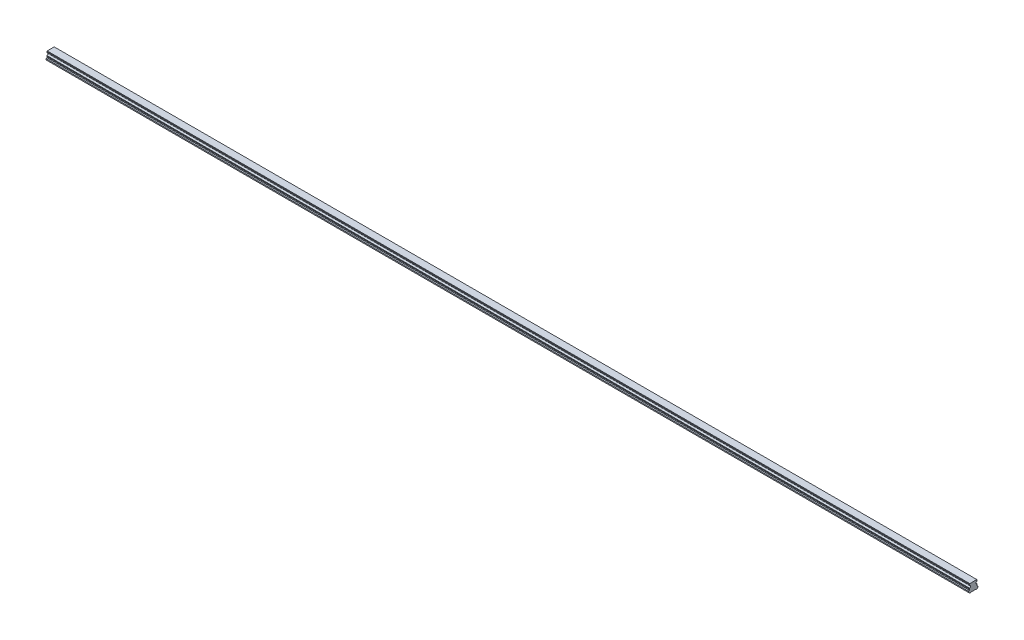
ISO-10303-21;
HEADER;
FILE_DESCRIPTION(('STEP AP214'),'2;1');
FILE_NAME('part.step','',(''),(''),'','','');
FILE_SCHEMA(('AUTOMOTIVE_DESIGN { 1 0 10303 214 1 1 1 1 }'));
ENDSEC;
DATA;
#1=APPLICATION_CONTEXT('core data for automotive mechanical design processes');
#2=APPLICATION_PROTOCOL_DEFINITION('international standard','automotive_design',2000,#1);
#3=PRODUCT_CONTEXT('',#1,'mechanical');
#4=PRODUCT('Part','Part','',(#3));
#5=PRODUCT_RELATED_PRODUCT_CATEGORY('part','',(#4));
#6=PRODUCT_DEFINITION_FORMATION('','',#4);
#7=PRODUCT_DEFINITION_CONTEXT('part definition',#1,'design');
#8=PRODUCT_DEFINITION('design','',#6,#7);
#9=PRODUCT_DEFINITION_SHAPE('','',#8);
#10=(LENGTH_UNIT() NAMED_UNIT(*) SI_UNIT(.MILLI.,.METRE.));
#11=(NAMED_UNIT(*) PLANE_ANGLE_UNIT() SI_UNIT($,.RADIAN.));
#12=(NAMED_UNIT(*) SI_UNIT($,.STERADIAN.) SOLID_ANGLE_UNIT());
#13=UNCERTAINTY_MEASURE_WITH_UNIT(LENGTH_MEASURE(1.E-05),#10,'distance_accuracy_value','');
#14=(GEOMETRIC_REPRESENTATION_CONTEXT(3) GLOBAL_UNCERTAINTY_ASSIGNED_CONTEXT((#13)) GLOBAL_UNIT_ASSIGNED_CONTEXT((#10,
#11,#12)) REPRESENTATION_CONTEXT('',''));
#15=CARTESIAN_POINT('',(0.,0.,0.));
#16=DIRECTION('',(0.,0.,1.));
#17=DIRECTION('',(1.,0.,0.));
#18=AXIS2_PLACEMENT_3D('',#15,#16,#17);
#19=CARTESIAN_POINT('',(2430.,0.499999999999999,0.));
#20=DIRECTION('',(0.,-1.,0.));
#21=DIRECTION('',(0.,0.,-1.));
#22=AXIS2_PLACEMENT_3D('',#19,#20,#21);
#23=CONICAL_SURFACE('',#22,3.5,0.785398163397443);
#24=CARTESIAN_POINT('',(2430.,1.00000000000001,0.));
#25=DIRECTION('',(0.,1.,0.));
#26=DIRECTION('',(0.,0.,1.));
#27=AXIS2_PLACEMENT_3D('',#24,#25,#26);
#28=CIRCLE('',#27,3.);
#29=CARTESIAN_POINT('',(2430.,1.00000000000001,3.));
#30=VERTEX_POINT('',#29);
#31=EDGE_CURVE('E11',#30,#30,#28,.F.);
#32=ORIENTED_EDGE('',*,*,#31,.F.);
#33=EDGE_LOOP('',(#32));
#34=FACE_BOUND('',#33,.T.);
#35=CARTESIAN_POINT('',(2430.,0.499999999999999,0.));
#36=DIRECTION('',(0.,1.,0.));
#37=DIRECTION('',(0.,0.,1.));
#38=AXIS2_PLACEMENT_3D('',#35,#36,#37);
#39=CIRCLE('',#38,3.5);
#40=CARTESIAN_POINT('',(2430.,0.5,3.5));
#41=VERTEX_POINT('',#40);
#42=EDGE_CURVE('E890',#41,#41,#39,.T.);
#43=ORIENTED_EDGE('',*,*,#42,.F.);
#44=EDGE_LOOP('',(#43));
#45=FACE_BOUND('',#44,.T.);
#46=ADVANCED_FACE('F39',(#34,#45),#23,.F.);
#47=CARTESIAN_POINT('',(2430.,12.,0.));
#48=DIRECTION('',(0.,-1.,0.));
#49=DIRECTION('',(0.,0.,-1.));
#50=AXIS2_PLACEMENT_3D('',#47,#48,#49);
#51=CYLINDRICAL_SURFACE('',#50,3.);
#52=ORIENTED_EDGE('',*,*,#31,.T.);
#53=EDGE_LOOP('',(#52));
#54=FACE_BOUND('',#53,.T.);
#55=CARTESIAN_POINT('',(2430.,12.,0.));
#56=DIRECTION('',(0.,-1.,0.));
#57=DIRECTION('',(0.,0.,-1.));
#58=AXIS2_PLACEMENT_3D('',#55,#56,#57);
#59=CIRCLE('',#58,3.);
#60=CARTESIAN_POINT('',(2430.,12.,-3.));
#61=VERTEX_POINT('',#60);
#62=EDGE_CURVE('E49',#61,#61,#59,.T.);
#63=ORIENTED_EDGE('',*,*,#62,.F.);
#64=EDGE_LOOP('',(#63));
#65=FACE_BOUND('',#64,.T.);
#66=ADVANCED_FACE('F1265',(#54,#65),#51,.F.);
#67=CARTESIAN_POINT('',(2430.,12.,0.));
#68=DIRECTION('',(0.,-1.,0.));
#69=DIRECTION('',(0.,0.,-1.));
#70=AXIS2_PLACEMENT_3D('',#67,#68,#69);
#71=PLANE('',#70);
#72=CARTESIAN_POINT('',(2430.,12.,0.));
#73=DIRECTION('',(0.,-1.,0.));
#74=DIRECTION('',(0.,0.,-1.));
#75=AXIS2_PLACEMENT_3D('',#72,#73,#74);
#76=CIRCLE('',#75,2.5);
#77=CARTESIAN_POINT('',(2430.,12.,-2.5));
#78=VERTEX_POINT('',#77);
#79=EDGE_CURVE('E42',#78,#78,#76,.T.);
#80=ORIENTED_EDGE('',*,*,#79,.F.);
#81=EDGE_LOOP('',(#80));
#82=FACE_BOUND('',#81,.T.);
#83=ORIENTED_EDGE('',*,*,#62,.T.);
#84=EDGE_LOOP('',(#83));
#85=FACE_BOUND('',#84,.T.);
#86=ADVANCED_FACE('F1270',(#82,#85),#71,.T.);
#87=CARTESIAN_POINT('',(2370.,0.499999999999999,0.));
#88=DIRECTION('',(0.,-1.,0.));
#89=DIRECTION('',(0.,0.,-1.));
#90=AXIS2_PLACEMENT_3D('',#87,#88,#89);
#91=CONICAL_SURFACE('',#90,3.5,0.785398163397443);
#92=CARTESIAN_POINT('',(2370.,1.00000000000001,0.));
#93=DIRECTION('',(0.,1.,0.));
#94=DIRECTION('',(0.,0.,1.));
#95=AXIS2_PLACEMENT_3D('',#92,#93,#94);
#96=CIRCLE('',#95,3.);
#97=CARTESIAN_POINT('',(2370.,1.00000000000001,3.));
#98=VERTEX_POINT('',#97);
#99=EDGE_CURVE('E886',#98,#98,#96,.F.);
#100=ORIENTED_EDGE('',*,*,#99,.F.);
#101=EDGE_LOOP('',(#100));
#102=FACE_BOUND('',#101,.T.);
#103=CARTESIAN_POINT('',(2370.,0.499999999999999,0.));
#104=DIRECTION('',(0.,1.,0.));
#105=DIRECTION('',(0.,0.,1.));
#106=AXIS2_PLACEMENT_3D('',#103,#104,#105);
#107=CIRCLE('',#106,3.5);
#108=CARTESIAN_POINT('',(2370.,0.5,3.5));
#109=VERTEX_POINT('',#108);
#110=EDGE_CURVE('E878',#109,#109,#107,.T.);
#111=ORIENTED_EDGE('',*,*,#110,.F.);
#112=EDGE_LOOP('',(#111));
#113=FACE_BOUND('',#112,.T.);
#114=ADVANCED_FACE('F1801',(#102,#113),#91,.F.);
#115=CARTESIAN_POINT('',(2370.,12.,0.));
#116=DIRECTION('',(0.,-1.,0.));
#117=DIRECTION('',(0.,0.,-1.));
#118=AXIS2_PLACEMENT_3D('',#115,#116,#117);
#119=CYLINDRICAL_SURFACE('',#118,3.);
#120=ORIENTED_EDGE('',*,*,#99,.T.);
#121=EDGE_LOOP('',(#120));
#122=FACE_BOUND('',#121,.T.);
#123=CARTESIAN_POINT('',(2370.,12.,0.));
#124=DIRECTION('',(0.,-1.,0.));
#125=DIRECTION('',(0.,0.,-1.));
#126=AXIS2_PLACEMENT_3D('',#123,#124,#125);
#127=CIRCLE('',#126,3.);
#128=CARTESIAN_POINT('',(2370.,12.,-3.));
#129=VERTEX_POINT('',#128);
#130=EDGE_CURVE('E882',#129,#129,#127,.T.);
#131=ORIENTED_EDGE('',*,*,#130,.F.);
#132=EDGE_LOOP('',(#131));
#133=FACE_BOUND('',#132,.T.);
#134=ADVANCED_FACE('F1797',(#122,#133),#119,.F.);
#135=CARTESIAN_POINT('',(2370.,12.,0.));
#136=DIRECTION('',(0.,-1.,0.));
#137=DIRECTION('',(0.,0.,-1.));
#138=AXIS2_PLACEMENT_3D('',#135,#136,#137);
#139=PLANE('',#138);
#140=CARTESIAN_POINT('',(2370.,12.,0.));
#141=DIRECTION('',(0.,-1.,0.));
#142=DIRECTION('',(0.,0.,-1.));
#143=AXIS2_PLACEMENT_3D('',#140,#141,#142);
#144=CIRCLE('',#143,2.5);
#145=CARTESIAN_POINT('',(2370.,12.,-2.5));
#146=VERTEX_POINT('',#145);
#147=EDGE_CURVE('E1048',#146,#146,#144,.T.);
#148=ORIENTED_EDGE('',*,*,#147,.F.);
#149=EDGE_LOOP('',(#148));
#150=FACE_BOUND('',#149,.T.);
#151=ORIENTED_EDGE('',*,*,#130,.T.);
#152=EDGE_LOOP('',(#151));
#153=FACE_BOUND('',#152,.T.);
#154=ADVANCED_FACE('F1793',(#150,#153),#139,.T.);
#155=CARTESIAN_POINT('',(2310.,0.499999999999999,0.));
#156=DIRECTION('',(0.,-1.,0.));
#157=DIRECTION('',(0.,0.,-1.));
#158=AXIS2_PLACEMENT_3D('',#155,#156,#157);
#159=CONICAL_SURFACE('',#158,3.5,0.785398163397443);
#160=CARTESIAN_POINT('',(2310.,1.00000000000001,0.));
#161=DIRECTION('',(0.,1.,0.));
#162=DIRECTION('',(0.,0.,1.));
#163=AXIS2_PLACEMENT_3D('',#160,#161,#162);
#164=CIRCLE('',#163,3.);
#165=CARTESIAN_POINT('',(2310.,1.00000000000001,3.));
#166=VERTEX_POINT('',#165);
#167=EDGE_CURVE('E874',#166,#166,#164,.F.);
#168=ORIENTED_EDGE('',*,*,#167,.F.);
#169=EDGE_LOOP('',(#168));
#170=FACE_BOUND('',#169,.T.);
#171=CARTESIAN_POINT('',(2310.,0.499999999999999,0.));
#172=DIRECTION('',(0.,1.,0.));
#173=DIRECTION('',(0.,0.,1.));
#174=AXIS2_PLACEMENT_3D('',#171,#172,#173);
#175=CIRCLE('',#174,3.5);
#176=CARTESIAN_POINT('',(2310.,0.5,3.5));
#177=VERTEX_POINT('',#176);
#178=EDGE_CURVE('E866',#177,#177,#175,.T.);
#179=ORIENTED_EDGE('',*,*,#178,.F.);
#180=EDGE_LOOP('',(#179));
#181=FACE_BOUND('',#180,.T.);
#182=ADVANCED_FACE('F1789',(#170,#181),#159,.F.);
#183=CARTESIAN_POINT('',(2310.,12.,0.));
#184=DIRECTION('',(0.,-1.,0.));
#185=DIRECTION('',(0.,0.,-1.));
#186=AXIS2_PLACEMENT_3D('',#183,#184,#185);
#187=CYLINDRICAL_SURFACE('',#186,3.);
#188=ORIENTED_EDGE('',*,*,#167,.T.);
#189=EDGE_LOOP('',(#188));
#190=FACE_BOUND('',#189,.T.);
#191=CARTESIAN_POINT('',(2310.,12.,0.));
#192=DIRECTION('',(0.,-1.,0.));
#193=DIRECTION('',(0.,0.,-1.));
#194=AXIS2_PLACEMENT_3D('',#191,#192,#193);
#195=CIRCLE('',#194,3.);
#196=CARTESIAN_POINT('',(2310.,12.,-3.));
#197=VERTEX_POINT('',#196);
#198=EDGE_CURVE('E870',#197,#197,#195,.T.);
#199=ORIENTED_EDGE('',*,*,#198,.F.);
#200=EDGE_LOOP('',(#199));
#201=FACE_BOUND('',#200,.T.);
#202=ADVANCED_FACE('F1785',(#190,#201),#187,.F.);
#203=CARTESIAN_POINT('',(2310.,12.,0.));
#204=DIRECTION('',(0.,-1.,0.));
#205=DIRECTION('',(0.,0.,-1.));
#206=AXIS2_PLACEMENT_3D('',#203,#204,#205);
#207=PLANE('',#206);
#208=CARTESIAN_POINT('',(2310.,12.,0.));
#209=DIRECTION('',(0.,-1.,0.));
#210=DIRECTION('',(0.,0.,-1.));
#211=AXIS2_PLACEMENT_3D('',#208,#209,#210);
#212=CIRCLE('',#211,2.5);
#213=CARTESIAN_POINT('',(2310.,12.,-2.5));
#214=VERTEX_POINT('',#213);
#215=EDGE_CURVE('E1045',#214,#214,#212,.T.);
#216=ORIENTED_EDGE('',*,*,#215,.F.);
#217=EDGE_LOOP('',(#216));
#218=FACE_BOUND('',#217,.T.);
#219=ORIENTED_EDGE('',*,*,#198,.T.);
#220=EDGE_LOOP('',(#219));
#221=FACE_BOUND('',#220,.T.);
#222=ADVANCED_FACE('F1781',(#218,#221),#207,.T.);
#223=CARTESIAN_POINT('',(2250.,0.499999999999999,0.));
#224=DIRECTION('',(0.,-1.,0.));
#225=DIRECTION('',(0.,0.,-1.));
#226=AXIS2_PLACEMENT_3D('',#223,#224,#225);
#227=CONICAL_SURFACE('',#226,3.5,0.785398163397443);
#228=CARTESIAN_POINT('',(2250.,1.00000000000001,0.));
#229=DIRECTION('',(0.,1.,0.));
#230=DIRECTION('',(0.,0.,1.));
#231=AXIS2_PLACEMENT_3D('',#228,#229,#230);
#232=CIRCLE('',#231,3.);
#233=CARTESIAN_POINT('',(2250.,1.00000000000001,3.));
#234=VERTEX_POINT('',#233);
#235=EDGE_CURVE('E862',#234,#234,#232,.F.);
#236=ORIENTED_EDGE('',*,*,#235,.F.);
#237=EDGE_LOOP('',(#236));
#238=FACE_BOUND('',#237,.T.);
#239=CARTESIAN_POINT('',(2250.,0.499999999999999,0.));
#240=DIRECTION('',(0.,1.,0.));
#241=DIRECTION('',(0.,0.,1.));
#242=AXIS2_PLACEMENT_3D('',#239,#240,#241);
#243=CIRCLE('',#242,3.5);
#244=CARTESIAN_POINT('',(2250.,0.5,3.5));
#245=VERTEX_POINT('',#244);
#246=EDGE_CURVE('E854',#245,#245,#243,.T.);
#247=ORIENTED_EDGE('',*,*,#246,.F.);
#248=EDGE_LOOP('',(#247));
#249=FACE_BOUND('',#248,.T.);
#250=ADVANCED_FACE('F1777',(#238,#249),#227,.F.);
#251=CARTESIAN_POINT('',(2250.,12.,0.));
#252=DIRECTION('',(0.,-1.,0.));
#253=DIRECTION('',(0.,0.,-1.));
#254=AXIS2_PLACEMENT_3D('',#251,#252,#253);
#255=CYLINDRICAL_SURFACE('',#254,3.);
#256=ORIENTED_EDGE('',*,*,#235,.T.);
#257=EDGE_LOOP('',(#256));
#258=FACE_BOUND('',#257,.T.);
#259=CARTESIAN_POINT('',(2250.,12.,0.));
#260=DIRECTION('',(0.,-1.,0.));
#261=DIRECTION('',(0.,0.,-1.));
#262=AXIS2_PLACEMENT_3D('',#259,#260,#261);
#263=CIRCLE('',#262,3.);
#264=CARTESIAN_POINT('',(2250.,12.,-3.));
#265=VERTEX_POINT('',#264);
#266=EDGE_CURVE('E858',#265,#265,#263,.T.);
#267=ORIENTED_EDGE('',*,*,#266,.F.);
#268=EDGE_LOOP('',(#267));
#269=FACE_BOUND('',#268,.T.);
#270=ADVANCED_FACE('F1773',(#258,#269),#255,.F.);
#271=CARTESIAN_POINT('',(2250.,12.,0.));
#272=DIRECTION('',(0.,-1.,0.));
#273=DIRECTION('',(0.,0.,-1.));
#274=AXIS2_PLACEMENT_3D('',#271,#272,#273);
#275=PLANE('',#274);
#276=CARTESIAN_POINT('',(2250.,12.,0.));
#277=DIRECTION('',(0.,-1.,0.));
#278=DIRECTION('',(0.,0.,-1.));
#279=AXIS2_PLACEMENT_3D('',#276,#277,#278);
#280=CIRCLE('',#279,2.5);
#281=CARTESIAN_POINT('',(2250.,12.,-2.5));
#282=VERTEX_POINT('',#281);
#283=EDGE_CURVE('E1041',#282,#282,#280,.T.);
#284=ORIENTED_EDGE('',*,*,#283,.F.);
#285=EDGE_LOOP('',(#284));
#286=FACE_BOUND('',#285,.T.);
#287=ORIENTED_EDGE('',*,*,#266,.T.);
#288=EDGE_LOOP('',(#287));
#289=FACE_BOUND('',#288,.T.);
#290=ADVANCED_FACE('F1769',(#286,#289),#275,.T.);
#291=CARTESIAN_POINT('',(2190.,0.499999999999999,0.));
#292=DIRECTION('',(0.,-1.,0.));
#293=DIRECTION('',(0.,0.,-1.));
#294=AXIS2_PLACEMENT_3D('',#291,#292,#293);
#295=CONICAL_SURFACE('',#294,3.5,0.785398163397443);
#296=CARTESIAN_POINT('',(2190.,1.00000000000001,0.));
#297=DIRECTION('',(0.,1.,0.));
#298=DIRECTION('',(0.,0.,1.));
#299=AXIS2_PLACEMENT_3D('',#296,#297,#298);
#300=CIRCLE('',#299,3.);
#301=CARTESIAN_POINT('',(2190.,1.00000000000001,3.));
#302=VERTEX_POINT('',#301);
#303=EDGE_CURVE('E850',#302,#302,#300,.F.);
#304=ORIENTED_EDGE('',*,*,#303,.F.);
#305=EDGE_LOOP('',(#304));
#306=FACE_BOUND('',#305,.T.);
#307=CARTESIAN_POINT('',(2190.,0.499999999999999,0.));
#308=DIRECTION('',(0.,1.,0.));
#309=DIRECTION('',(0.,0.,1.));
#310=AXIS2_PLACEMENT_3D('',#307,#308,#309);
#311=CIRCLE('',#310,3.5);
#312=CARTESIAN_POINT('',(2190.,0.5,3.5));
#313=VERTEX_POINT('',#312);
#314=EDGE_CURVE('E842',#313,#313,#311,.T.);
#315=ORIENTED_EDGE('',*,*,#314,.F.);
#316=EDGE_LOOP('',(#315));
#317=FACE_BOUND('',#316,.T.);
#318=ADVANCED_FACE('F1765',(#306,#317),#295,.F.);
#319=CARTESIAN_POINT('',(2190.,12.,0.));
#320=DIRECTION('',(0.,-1.,0.));
#321=DIRECTION('',(0.,0.,-1.));
#322=AXIS2_PLACEMENT_3D('',#319,#320,#321);
#323=CYLINDRICAL_SURFACE('',#322,3.);
#324=ORIENTED_EDGE('',*,*,#303,.T.);
#325=EDGE_LOOP('',(#324));
#326=FACE_BOUND('',#325,.T.);
#327=CARTESIAN_POINT('',(2190.,12.,0.));
#328=DIRECTION('',(0.,-1.,0.));
#329=DIRECTION('',(0.,0.,-1.));
#330=AXIS2_PLACEMENT_3D('',#327,#328,#329);
#331=CIRCLE('',#330,3.);
#332=CARTESIAN_POINT('',(2190.,12.,-3.));
#333=VERTEX_POINT('',#332);
#334=EDGE_CURVE('E846',#333,#333,#331,.T.);
#335=ORIENTED_EDGE('',*,*,#334,.F.);
#336=EDGE_LOOP('',(#335));
#337=FACE_BOUND('',#336,.T.);
#338=ADVANCED_FACE('F1761',(#326,#337),#323,.F.);
#339=CARTESIAN_POINT('',(2190.,12.,0.));
#340=DIRECTION('',(0.,-1.,0.));
#341=DIRECTION('',(0.,0.,-1.));
#342=AXIS2_PLACEMENT_3D('',#339,#340,#341);
#343=PLANE('',#342);
#344=CARTESIAN_POINT('',(2190.,12.,0.));
#345=DIRECTION('',(0.,-1.,0.));
#346=DIRECTION('',(0.,0.,-1.));
#347=AXIS2_PLACEMENT_3D('',#344,#345,#346);
#348=CIRCLE('',#347,2.5);
#349=CARTESIAN_POINT('',(2190.,12.,-2.5));
#350=VERTEX_POINT('',#349);
#351=EDGE_CURVE('E1037',#350,#350,#348,.T.);
#352=ORIENTED_EDGE('',*,*,#351,.F.);
#353=EDGE_LOOP('',(#352));
#354=FACE_BOUND('',#353,.T.);
#355=ORIENTED_EDGE('',*,*,#334,.T.);
#356=EDGE_LOOP('',(#355));
#357=FACE_BOUND('',#356,.T.);
#358=ADVANCED_FACE('F1757',(#354,#357),#343,.T.);
#359=CARTESIAN_POINT('',(2130.,0.499999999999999,0.));
#360=DIRECTION('',(0.,-1.,0.));
#361=DIRECTION('',(0.,0.,-1.));
#362=AXIS2_PLACEMENT_3D('',#359,#360,#361);
#363=CONICAL_SURFACE('',#362,3.5,0.785398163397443);
#364=CARTESIAN_POINT('',(2130.,1.00000000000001,0.));
#365=DIRECTION('',(0.,1.,0.));
#366=DIRECTION('',(0.,0.,1.));
#367=AXIS2_PLACEMENT_3D('',#364,#365,#366);
#368=CIRCLE('',#367,3.);
#369=CARTESIAN_POINT('',(2130.,1.00000000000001,3.));
#370=VERTEX_POINT('',#369);
#371=EDGE_CURVE('E838',#370,#370,#368,.F.);
#372=ORIENTED_EDGE('',*,*,#371,.F.);
#373=EDGE_LOOP('',(#372));
#374=FACE_BOUND('',#373,.T.);
#375=CARTESIAN_POINT('',(2130.,0.499999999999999,0.));
#376=DIRECTION('',(0.,1.,0.));
#377=DIRECTION('',(0.,0.,1.));
#378=AXIS2_PLACEMENT_3D('',#375,#376,#377);
#379=CIRCLE('',#378,3.5);
#380=CARTESIAN_POINT('',(2130.,0.5,3.5));
#381=VERTEX_POINT('',#380);
#382=EDGE_CURVE('E830',#381,#381,#379,.T.);
#383=ORIENTED_EDGE('',*,*,#382,.F.);
#384=EDGE_LOOP('',(#383));
#385=FACE_BOUND('',#384,.T.);
#386=ADVANCED_FACE('F1753',(#374,#385),#363,.F.);
#387=CARTESIAN_POINT('',(2130.,12.,0.));
#388=DIRECTION('',(0.,-1.,0.));
#389=DIRECTION('',(0.,0.,-1.));
#390=AXIS2_PLACEMENT_3D('',#387,#388,#389);
#391=CYLINDRICAL_SURFACE('',#390,3.);
#392=ORIENTED_EDGE('',*,*,#371,.T.);
#393=EDGE_LOOP('',(#392));
#394=FACE_BOUND('',#393,.T.);
#395=CARTESIAN_POINT('',(2130.,12.,0.));
#396=DIRECTION('',(0.,-1.,0.));
#397=DIRECTION('',(0.,0.,-1.));
#398=AXIS2_PLACEMENT_3D('',#395,#396,#397);
#399=CIRCLE('',#398,3.);
#400=CARTESIAN_POINT('',(2130.,12.,-3.));
#401=VERTEX_POINT('',#400);
#402=EDGE_CURVE('E834',#401,#401,#399,.T.);
#403=ORIENTED_EDGE('',*,*,#402,.F.);
#404=EDGE_LOOP('',(#403));
#405=FACE_BOUND('',#404,.T.);
#406=ADVANCED_FACE('F1749',(#394,#405),#391,.F.);
#407=CARTESIAN_POINT('',(2130.,12.,0.));
#408=DIRECTION('',(0.,-1.,0.));
#409=DIRECTION('',(0.,0.,-1.));
#410=AXIS2_PLACEMENT_3D('',#407,#408,#409);
#411=PLANE('',#410);
#412=CARTESIAN_POINT('',(2130.,12.,0.));
#413=DIRECTION('',(0.,-1.,0.));
#414=DIRECTION('',(0.,0.,-1.));
#415=AXIS2_PLACEMENT_3D('',#412,#413,#414);
#416=CIRCLE('',#415,2.5);
#417=CARTESIAN_POINT('',(2130.,12.,-2.5));
#418=VERTEX_POINT('',#417);
#419=EDGE_CURVE('E1033',#418,#418,#416,.T.);
#420=ORIENTED_EDGE('',*,*,#419,.F.);
#421=EDGE_LOOP('',(#420));
#422=FACE_BOUND('',#421,.T.);
#423=ORIENTED_EDGE('',*,*,#402,.T.);
#424=EDGE_LOOP('',(#423));
#425=FACE_BOUND('',#424,.T.);
#426=ADVANCED_FACE('F1745',(#422,#425),#411,.T.);
#427=CARTESIAN_POINT('',(2070.,0.499999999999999,0.));
#428=DIRECTION('',(0.,-1.,0.));
#429=DIRECTION('',(0.,0.,-1.));
#430=AXIS2_PLACEMENT_3D('',#427,#428,#429);
#431=CONICAL_SURFACE('',#430,3.5,0.785398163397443);
#432=CARTESIAN_POINT('',(2070.,1.00000000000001,0.));
#433=DIRECTION('',(0.,1.,0.));
#434=DIRECTION('',(0.,0.,1.));
#435=AXIS2_PLACEMENT_3D('',#432,#433,#434);
#436=CIRCLE('',#435,3.);
#437=CARTESIAN_POINT('',(2070.,1.00000000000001,3.));
#438=VERTEX_POINT('',#437);
#439=EDGE_CURVE('E826',#438,#438,#436,.F.);
#440=ORIENTED_EDGE('',*,*,#439,.F.);
#441=EDGE_LOOP('',(#440));
#442=FACE_BOUND('',#441,.T.);
#443=CARTESIAN_POINT('',(2070.,0.499999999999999,0.));
#444=DIRECTION('',(0.,1.,0.));
#445=DIRECTION('',(0.,0.,1.));
#446=AXIS2_PLACEMENT_3D('',#443,#444,#445);
#447=CIRCLE('',#446,3.5);
#448=CARTESIAN_POINT('',(2070.,0.5,3.5));
#449=VERTEX_POINT('',#448);
#450=EDGE_CURVE('E818',#449,#449,#447,.T.);
#451=ORIENTED_EDGE('',*,*,#450,.F.);
#452=EDGE_LOOP('',(#451));
#453=FACE_BOUND('',#452,.T.);
#454=ADVANCED_FACE('F1741',(#442,#453),#431,.F.);
#455=CARTESIAN_POINT('',(2070.,12.,0.));
#456=DIRECTION('',(0.,-1.,0.));
#457=DIRECTION('',(0.,0.,-1.));
#458=AXIS2_PLACEMENT_3D('',#455,#456,#457);
#459=CYLINDRICAL_SURFACE('',#458,3.);
#460=ORIENTED_EDGE('',*,*,#439,.T.);
#461=EDGE_LOOP('',(#460));
#462=FACE_BOUND('',#461,.T.);
#463=CARTESIAN_POINT('',(2070.,12.,0.));
#464=DIRECTION('',(0.,-1.,0.));
#465=DIRECTION('',(0.,0.,-1.));
#466=AXIS2_PLACEMENT_3D('',#463,#464,#465);
#467=CIRCLE('',#466,3.);
#468=CARTESIAN_POINT('',(2070.,12.,-3.));
#469=VERTEX_POINT('',#468);
#470=EDGE_CURVE('E822',#469,#469,#467,.T.);
#471=ORIENTED_EDGE('',*,*,#470,.F.);
#472=EDGE_LOOP('',(#471));
#473=FACE_BOUND('',#472,.T.);
#474=ADVANCED_FACE('F1737',(#462,#473),#459,.F.);
#475=CARTESIAN_POINT('',(2070.,12.,0.));
#476=DIRECTION('',(0.,-1.,0.));
#477=DIRECTION('',(0.,0.,-1.));
#478=AXIS2_PLACEMENT_3D('',#475,#476,#477);
#479=PLANE('',#478);
#480=CARTESIAN_POINT('',(2070.,12.,0.));
#481=DIRECTION('',(0.,-1.,0.));
#482=DIRECTION('',(0.,0.,-1.));
#483=AXIS2_PLACEMENT_3D('',#480,#481,#482);
#484=CIRCLE('',#483,2.5);
#485=CARTESIAN_POINT('',(2070.,12.,-2.5));
#486=VERTEX_POINT('',#485);
#487=EDGE_CURVE('E1029',#486,#486,#484,.T.);
#488=ORIENTED_EDGE('',*,*,#487,.F.);
#489=EDGE_LOOP('',(#488));
#490=FACE_BOUND('',#489,.T.);
#491=ORIENTED_EDGE('',*,*,#470,.T.);
#492=EDGE_LOOP('',(#491));
#493=FACE_BOUND('',#492,.T.);
#494=ADVANCED_FACE('F1733',(#490,#493),#479,.T.);
#495=CARTESIAN_POINT('',(2010.,0.499999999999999,0.));
#496=DIRECTION('',(0.,-1.,0.));
#497=DIRECTION('',(0.,0.,-1.));
#498=AXIS2_PLACEMENT_3D('',#495,#496,#497);
#499=CONICAL_SURFACE('',#498,3.5,0.785398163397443);
#500=CARTESIAN_POINT('',(2010.,1.00000000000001,0.));
#501=DIRECTION('',(0.,1.,0.));
#502=DIRECTION('',(0.,0.,1.));
#503=AXIS2_PLACEMENT_3D('',#500,#501,#502);
#504=CIRCLE('',#503,3.);
#505=CARTESIAN_POINT('',(2010.,1.00000000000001,3.));
#506=VERTEX_POINT('',#505);
#507=EDGE_CURVE('E814',#506,#506,#504,.F.);
#508=ORIENTED_EDGE('',*,*,#507,.F.);
#509=EDGE_LOOP('',(#508));
#510=FACE_BOUND('',#509,.T.);
#511=CARTESIAN_POINT('',(2010.,0.499999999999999,0.));
#512=DIRECTION('',(0.,1.,0.));
#513=DIRECTION('',(0.,0.,1.));
#514=AXIS2_PLACEMENT_3D('',#511,#512,#513);
#515=CIRCLE('',#514,3.5);
#516=CARTESIAN_POINT('',(2010.,0.5,3.5));
#517=VERTEX_POINT('',#516);
#518=EDGE_CURVE('E806',#517,#517,#515,.T.);
#519=ORIENTED_EDGE('',*,*,#518,.F.);
#520=EDGE_LOOP('',(#519));
#521=FACE_BOUND('',#520,.T.);
#522=ADVANCED_FACE('F1729',(#510,#521),#499,.F.);
#523=CARTESIAN_POINT('',(2010.,12.,0.));
#524=DIRECTION('',(0.,-1.,0.));
#525=DIRECTION('',(0.,0.,-1.));
#526=AXIS2_PLACEMENT_3D('',#523,#524,#525);
#527=CYLINDRICAL_SURFACE('',#526,3.);
#528=ORIENTED_EDGE('',*,*,#507,.T.);
#529=EDGE_LOOP('',(#528));
#530=FACE_BOUND('',#529,.T.);
#531=CARTESIAN_POINT('',(2010.,12.,0.));
#532=DIRECTION('',(0.,-1.,0.));
#533=DIRECTION('',(0.,0.,-1.));
#534=AXIS2_PLACEMENT_3D('',#531,#532,#533);
#535=CIRCLE('',#534,3.);
#536=CARTESIAN_POINT('',(2010.,12.,-3.));
#537=VERTEX_POINT('',#536);
#538=EDGE_CURVE('E810',#537,#537,#535,.T.);
#539=ORIENTED_EDGE('',*,*,#538,.F.);
#540=EDGE_LOOP('',(#539));
#541=FACE_BOUND('',#540,.T.);
#542=ADVANCED_FACE('F1725',(#530,#541),#527,.F.);
#543=CARTESIAN_POINT('',(2010.,12.,0.));
#544=DIRECTION('',(0.,-1.,0.));
#545=DIRECTION('',(0.,0.,-1.));
#546=AXIS2_PLACEMENT_3D('',#543,#544,#545);
#547=PLANE('',#546);
#548=CARTESIAN_POINT('',(2010.,12.,0.));
#549=DIRECTION('',(0.,-1.,0.));
#550=DIRECTION('',(0.,0.,-1.));
#551=AXIS2_PLACEMENT_3D('',#548,#549,#550);
#552=CIRCLE('',#551,2.5);
#553=CARTESIAN_POINT('',(2010.,12.,-2.5));
#554=VERTEX_POINT('',#553);
#555=EDGE_CURVE('E1025',#554,#554,#552,.T.);
#556=ORIENTED_EDGE('',*,*,#555,.F.);
#557=EDGE_LOOP('',(#556));
#558=FACE_BOUND('',#557,.T.);
#559=ORIENTED_EDGE('',*,*,#538,.T.);
#560=EDGE_LOOP('',(#559));
#561=FACE_BOUND('',#560,.T.);
#562=ADVANCED_FACE('F1721',(#558,#561),#547,.T.);
#563=CARTESIAN_POINT('',(1950.,0.499999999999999,0.));
#564=DIRECTION('',(0.,-1.,0.));
#565=DIRECTION('',(0.,0.,-1.));
#566=AXIS2_PLACEMENT_3D('',#563,#564,#565);
#567=CONICAL_SURFACE('',#566,3.5,0.785398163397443);
#568=CARTESIAN_POINT('',(1950.,1.00000000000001,0.));
#569=DIRECTION('',(0.,1.,0.));
#570=DIRECTION('',(0.,0.,1.));
#571=AXIS2_PLACEMENT_3D('',#568,#569,#570);
#572=CIRCLE('',#571,3.);
#573=CARTESIAN_POINT('',(1950.,1.00000000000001,3.));
#574=VERTEX_POINT('',#573);
#575=EDGE_CURVE('E802',#574,#574,#572,.F.);
#576=ORIENTED_EDGE('',*,*,#575,.F.);
#577=EDGE_LOOP('',(#576));
#578=FACE_BOUND('',#577,.T.);
#579=CARTESIAN_POINT('',(1950.,0.499999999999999,0.));
#580=DIRECTION('',(0.,1.,0.));
#581=DIRECTION('',(0.,0.,1.));
#582=AXIS2_PLACEMENT_3D('',#579,#580,#581);
#583=CIRCLE('',#582,3.5);
#584=CARTESIAN_POINT('',(1950.,0.5,3.5));
#585=VERTEX_POINT('',#584);
#586=EDGE_CURVE('E794',#585,#585,#583,.T.);
#587=ORIENTED_EDGE('',*,*,#586,.F.);
#588=EDGE_LOOP('',(#587));
#589=FACE_BOUND('',#588,.T.);
#590=ADVANCED_FACE('F1717',(#578,#589),#567,.F.);
#591=CARTESIAN_POINT('',(1950.,12.,0.));
#592=DIRECTION('',(0.,-1.,0.));
#593=DIRECTION('',(0.,0.,-1.));
#594=AXIS2_PLACEMENT_3D('',#591,#592,#593);
#595=CYLINDRICAL_SURFACE('',#594,3.);
#596=ORIENTED_EDGE('',*,*,#575,.T.);
#597=EDGE_LOOP('',(#596));
#598=FACE_BOUND('',#597,.T.);
#599=CARTESIAN_POINT('',(1950.,12.,0.));
#600=DIRECTION('',(0.,-1.,0.));
#601=DIRECTION('',(0.,0.,-1.));
#602=AXIS2_PLACEMENT_3D('',#599,#600,#601);
#603=CIRCLE('',#602,3.);
#604=CARTESIAN_POINT('',(1950.,12.,-3.));
#605=VERTEX_POINT('',#604);
#606=EDGE_CURVE('E798',#605,#605,#603,.T.);
#607=ORIENTED_EDGE('',*,*,#606,.F.);
#608=EDGE_LOOP('',(#607));
#609=FACE_BOUND('',#608,.T.);
#610=ADVANCED_FACE('F1713',(#598,#609),#595,.F.);
#611=CARTESIAN_POINT('',(1950.,12.,0.));
#612=DIRECTION('',(0.,-1.,0.));
#613=DIRECTION('',(0.,0.,-1.));
#614=AXIS2_PLACEMENT_3D('',#611,#612,#613);
#615=PLANE('',#614);
#616=CARTESIAN_POINT('',(1950.,12.,0.));
#617=DIRECTION('',(0.,-1.,0.));
#618=DIRECTION('',(0.,0.,-1.));
#619=AXIS2_PLACEMENT_3D('',#616,#617,#618);
#620=CIRCLE('',#619,2.5);
#621=CARTESIAN_POINT('',(1950.,12.,-2.5));
#622=VERTEX_POINT('',#621);
#623=EDGE_CURVE('E1021',#622,#622,#620,.T.);
#624=ORIENTED_EDGE('',*,*,#623,.F.);
#625=EDGE_LOOP('',(#624));
#626=FACE_BOUND('',#625,.T.);
#627=ORIENTED_EDGE('',*,*,#606,.T.);
#628=EDGE_LOOP('',(#627));
#629=FACE_BOUND('',#628,.T.);
#630=ADVANCED_FACE('F1709',(#626,#629),#615,.T.);
#631=CARTESIAN_POINT('',(1890.,0.499999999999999,0.));
#632=DIRECTION('',(0.,-1.,0.));
#633=DIRECTION('',(0.,0.,-1.));
#634=AXIS2_PLACEMENT_3D('',#631,#632,#633);
#635=CONICAL_SURFACE('',#634,3.5,0.785398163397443);
#636=CARTESIAN_POINT('',(1890.,1.00000000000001,0.));
#637=DIRECTION('',(0.,1.,0.));
#638=DIRECTION('',(0.,0.,1.));
#639=AXIS2_PLACEMENT_3D('',#636,#637,#638);
#640=CIRCLE('',#639,3.);
#641=CARTESIAN_POINT('',(1890.,1.00000000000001,3.));
#642=VERTEX_POINT('',#641);
#643=EDGE_CURVE('E790',#642,#642,#640,.F.);
#644=ORIENTED_EDGE('',*,*,#643,.F.);
#645=EDGE_LOOP('',(#644));
#646=FACE_BOUND('',#645,.T.);
#647=CARTESIAN_POINT('',(1890.,0.499999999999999,0.));
#648=DIRECTION('',(0.,1.,0.));
#649=DIRECTION('',(0.,0.,1.));
#650=AXIS2_PLACEMENT_3D('',#647,#648,#649);
#651=CIRCLE('',#650,3.5);
#652=CARTESIAN_POINT('',(1890.,0.5,3.5));
#653=VERTEX_POINT('',#652);
#654=EDGE_CURVE('E782',#653,#653,#651,.T.);
#655=ORIENTED_EDGE('',*,*,#654,.F.);
#656=EDGE_LOOP('',(#655));
#657=FACE_BOUND('',#656,.T.);
#658=ADVANCED_FACE('F1705',(#646,#657),#635,.F.);
#659=CARTESIAN_POINT('',(1890.,12.,0.));
#660=DIRECTION('',(0.,-1.,0.));
#661=DIRECTION('',(0.,0.,-1.));
#662=AXIS2_PLACEMENT_3D('',#659,#660,#661);
#663=CYLINDRICAL_SURFACE('',#662,3.);
#664=ORIENTED_EDGE('',*,*,#643,.T.);
#665=EDGE_LOOP('',(#664));
#666=FACE_BOUND('',#665,.T.);
#667=CARTESIAN_POINT('',(1890.,12.,0.));
#668=DIRECTION('',(0.,-1.,0.));
#669=DIRECTION('',(0.,0.,-1.));
#670=AXIS2_PLACEMENT_3D('',#667,#668,#669);
#671=CIRCLE('',#670,3.);
#672=CARTESIAN_POINT('',(1890.,12.,-3.));
#673=VERTEX_POINT('',#672);
#674=EDGE_CURVE('E786',#673,#673,#671,.T.);
#675=ORIENTED_EDGE('',*,*,#674,.F.);
#676=EDGE_LOOP('',(#675));
#677=FACE_BOUND('',#676,.T.);
#678=ADVANCED_FACE('F1701',(#666,#677),#663,.F.);
#679=CARTESIAN_POINT('',(1890.,12.,0.));
#680=DIRECTION('',(0.,-1.,0.));
#681=DIRECTION('',(0.,0.,-1.));
#682=AXIS2_PLACEMENT_3D('',#679,#680,#681);
#683=PLANE('',#682);
#684=CARTESIAN_POINT('',(1890.,12.,0.));
#685=DIRECTION('',(0.,-1.,0.));
#686=DIRECTION('',(0.,0.,-1.));
#687=AXIS2_PLACEMENT_3D('',#684,#685,#686);
#688=CIRCLE('',#687,2.5);
#689=CARTESIAN_POINT('',(1890.,12.,-2.5));
#690=VERTEX_POINT('',#689);
#691=EDGE_CURVE('E1017',#690,#690,#688,.T.);
#692=ORIENTED_EDGE('',*,*,#691,.F.);
#693=EDGE_LOOP('',(#692));
#694=FACE_BOUND('',#693,.T.);
#695=ORIENTED_EDGE('',*,*,#674,.T.);
#696=EDGE_LOOP('',(#695));
#697=FACE_BOUND('',#696,.T.);
#698=ADVANCED_FACE('F1697',(#694,#697),#683,.T.);
#699=CARTESIAN_POINT('',(1830.,0.499999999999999,0.));
#700=DIRECTION('',(0.,-1.,0.));
#701=DIRECTION('',(0.,0.,-1.));
#702=AXIS2_PLACEMENT_3D('',#699,#700,#701);
#703=CONICAL_SURFACE('',#702,3.5,0.785398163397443);
#704=CARTESIAN_POINT('',(1830.,1.00000000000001,0.));
#705=DIRECTION('',(0.,1.,0.));
#706=DIRECTION('',(0.,0.,1.));
#707=AXIS2_PLACEMENT_3D('',#704,#705,#706);
#708=CIRCLE('',#707,3.);
#709=CARTESIAN_POINT('',(1830.,1.00000000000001,3.));
#710=VERTEX_POINT('',#709);
#711=EDGE_CURVE('E778',#710,#710,#708,.F.);
#712=ORIENTED_EDGE('',*,*,#711,.F.);
#713=EDGE_LOOP('',(#712));
#714=FACE_BOUND('',#713,.T.);
#715=CARTESIAN_POINT('',(1830.,0.499999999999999,0.));
#716=DIRECTION('',(0.,1.,0.));
#717=DIRECTION('',(0.,0.,1.));
#718=AXIS2_PLACEMENT_3D('',#715,#716,#717);
#719=CIRCLE('',#718,3.5);
#720=CARTESIAN_POINT('',(1830.,0.5,3.5));
#721=VERTEX_POINT('',#720);
#722=EDGE_CURVE('E770',#721,#721,#719,.T.);
#723=ORIENTED_EDGE('',*,*,#722,.F.);
#724=EDGE_LOOP('',(#723));
#725=FACE_BOUND('',#724,.T.);
#726=ADVANCED_FACE('F1693',(#714,#725),#703,.F.);
#727=CARTESIAN_POINT('',(1830.,12.,0.));
#728=DIRECTION('',(0.,-1.,0.));
#729=DIRECTION('',(0.,0.,-1.));
#730=AXIS2_PLACEMENT_3D('',#727,#728,#729);
#731=CYLINDRICAL_SURFACE('',#730,3.);
#732=ORIENTED_EDGE('',*,*,#711,.T.);
#733=EDGE_LOOP('',(#732));
#734=FACE_BOUND('',#733,.T.);
#735=CARTESIAN_POINT('',(1830.,12.,0.));
#736=DIRECTION('',(0.,-1.,0.));
#737=DIRECTION('',(0.,0.,-1.));
#738=AXIS2_PLACEMENT_3D('',#735,#736,#737);
#739=CIRCLE('',#738,3.);
#740=CARTESIAN_POINT('',(1830.,12.,-3.));
#741=VERTEX_POINT('',#740);
#742=EDGE_CURVE('E774',#741,#741,#739,.T.);
#743=ORIENTED_EDGE('',*,*,#742,.F.);
#744=EDGE_LOOP('',(#743));
#745=FACE_BOUND('',#744,.T.);
#746=ADVANCED_FACE('F1689',(#734,#745),#731,.F.);
#747=CARTESIAN_POINT('',(1830.,12.,0.));
#748=DIRECTION('',(0.,-1.,0.));
#749=DIRECTION('',(0.,0.,-1.));
#750=AXIS2_PLACEMENT_3D('',#747,#748,#749);
#751=PLANE('',#750);
#752=CARTESIAN_POINT('',(1830.,12.,0.));
#753=DIRECTION('',(0.,-1.,0.));
#754=DIRECTION('',(0.,0.,-1.));
#755=AXIS2_PLACEMENT_3D('',#752,#753,#754);
#756=CIRCLE('',#755,2.5);
#757=CARTESIAN_POINT('',(1830.,12.,-2.5));
#758=VERTEX_POINT('',#757);
#759=EDGE_CURVE('E1013',#758,#758,#756,.T.);
#760=ORIENTED_EDGE('',*,*,#759,.F.);
#761=EDGE_LOOP('',(#760));
#762=FACE_BOUND('',#761,.T.);
#763=ORIENTED_EDGE('',*,*,#742,.T.);
#764=EDGE_LOOP('',(#763));
#765=FACE_BOUND('',#764,.T.);
#766=ADVANCED_FACE('F1685',(#762,#765),#751,.T.);
#767=CARTESIAN_POINT('',(1770.,0.499999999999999,0.));
#768=DIRECTION('',(0.,-1.,0.));
#769=DIRECTION('',(0.,0.,-1.));
#770=AXIS2_PLACEMENT_3D('',#767,#768,#769);
#771=CONICAL_SURFACE('',#770,3.5,0.785398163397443);
#772=CARTESIAN_POINT('',(1770.,1.00000000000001,0.));
#773=DIRECTION('',(0.,1.,0.));
#774=DIRECTION('',(0.,0.,1.));
#775=AXIS2_PLACEMENT_3D('',#772,#773,#774);
#776=CIRCLE('',#775,3.);
#777=CARTESIAN_POINT('',(1770.,1.00000000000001,3.));
#778=VERTEX_POINT('',#777);
#779=EDGE_CURVE('E766',#778,#778,#776,.F.);
#780=ORIENTED_EDGE('',*,*,#779,.F.);
#781=EDGE_LOOP('',(#780));
#782=FACE_BOUND('',#781,.T.);
#783=CARTESIAN_POINT('',(1770.,0.499999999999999,0.));
#784=DIRECTION('',(0.,1.,0.));
#785=DIRECTION('',(0.,0.,1.));
#786=AXIS2_PLACEMENT_3D('',#783,#784,#785);
#787=CIRCLE('',#786,3.5);
#788=CARTESIAN_POINT('',(1770.,0.5,3.5));
#789=VERTEX_POINT('',#788);
#790=EDGE_CURVE('E758',#789,#789,#787,.T.);
#791=ORIENTED_EDGE('',*,*,#790,.F.);
#792=EDGE_LOOP('',(#791));
#793=FACE_BOUND('',#792,.T.);
#794=ADVANCED_FACE('F1681',(#782,#793),#771,.F.);
#795=CARTESIAN_POINT('',(1770.,12.,0.));
#796=DIRECTION('',(0.,-1.,0.));
#797=DIRECTION('',(0.,0.,-1.));
#798=AXIS2_PLACEMENT_3D('',#795,#796,#797);
#799=CYLINDRICAL_SURFACE('',#798,3.);
#800=ORIENTED_EDGE('',*,*,#779,.T.);
#801=EDGE_LOOP('',(#800));
#802=FACE_BOUND('',#801,.T.);
#803=CARTESIAN_POINT('',(1770.,12.,0.));
#804=DIRECTION('',(0.,-1.,0.));
#805=DIRECTION('',(0.,0.,-1.));
#806=AXIS2_PLACEMENT_3D('',#803,#804,#805);
#807=CIRCLE('',#806,3.);
#808=CARTESIAN_POINT('',(1770.,12.,-3.));
#809=VERTEX_POINT('',#808);
#810=EDGE_CURVE('E762',#809,#809,#807,.T.);
#811=ORIENTED_EDGE('',*,*,#810,.F.);
#812=EDGE_LOOP('',(#811));
#813=FACE_BOUND('',#812,.T.);
#814=ADVANCED_FACE('F1677',(#802,#813),#799,.F.);
#815=CARTESIAN_POINT('',(1770.,12.,0.));
#816=DIRECTION('',(0.,-1.,0.));
#817=DIRECTION('',(0.,0.,-1.));
#818=AXIS2_PLACEMENT_3D('',#815,#816,#817);
#819=PLANE('',#818);
#820=CARTESIAN_POINT('',(1770.,12.,0.));
#821=DIRECTION('',(0.,-1.,0.));
#822=DIRECTION('',(0.,0.,-1.));
#823=AXIS2_PLACEMENT_3D('',#820,#821,#822);
#824=CIRCLE('',#823,2.5);
#825=CARTESIAN_POINT('',(1770.,12.,-2.5));
#826=VERTEX_POINT('',#825);
#827=EDGE_CURVE('E1009',#826,#826,#824,.T.);
#828=ORIENTED_EDGE('',*,*,#827,.F.);
#829=EDGE_LOOP('',(#828));
#830=FACE_BOUND('',#829,.T.);
#831=ORIENTED_EDGE('',*,*,#810,.T.);
#832=EDGE_LOOP('',(#831));
#833=FACE_BOUND('',#832,.T.);
#834=ADVANCED_FACE('F1673',(#830,#833),#819,.T.);
#835=CARTESIAN_POINT('',(1710.,0.499999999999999,0.));
#836=DIRECTION('',(0.,-1.,0.));
#837=DIRECTION('',(0.,0.,-1.));
#838=AXIS2_PLACEMENT_3D('',#835,#836,#837);
#839=CONICAL_SURFACE('',#838,3.5,0.785398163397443);
#840=CARTESIAN_POINT('',(1710.,1.00000000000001,0.));
#841=DIRECTION('',(0.,1.,0.));
#842=DIRECTION('',(0.,0.,1.));
#843=AXIS2_PLACEMENT_3D('',#840,#841,#842);
#844=CIRCLE('',#843,3.);
#845=CARTESIAN_POINT('',(1710.,1.00000000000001,3.));
#846=VERTEX_POINT('',#845);
#847=EDGE_CURVE('E754',#846,#846,#844,.F.);
#848=ORIENTED_EDGE('',*,*,#847,.F.);
#849=EDGE_LOOP('',(#848));
#850=FACE_BOUND('',#849,.T.);
#851=CARTESIAN_POINT('',(1710.,0.499999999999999,0.));
#852=DIRECTION('',(0.,1.,0.));
#853=DIRECTION('',(0.,0.,1.));
#854=AXIS2_PLACEMENT_3D('',#851,#852,#853);
#855=CIRCLE('',#854,3.5);
#856=CARTESIAN_POINT('',(1710.,0.5,3.5));
#857=VERTEX_POINT('',#856);
#858=EDGE_CURVE('E746',#857,#857,#855,.T.);
#859=ORIENTED_EDGE('',*,*,#858,.F.);
#860=EDGE_LOOP('',(#859));
#861=FACE_BOUND('',#860,.T.);
#862=ADVANCED_FACE('F1669',(#850,#861),#839,.F.);
#863=CARTESIAN_POINT('',(1710.,12.,0.));
#864=DIRECTION('',(0.,-1.,0.));
#865=DIRECTION('',(0.,0.,-1.));
#866=AXIS2_PLACEMENT_3D('',#863,#864,#865);
#867=CYLINDRICAL_SURFACE('',#866,3.);
#868=ORIENTED_EDGE('',*,*,#847,.T.);
#869=EDGE_LOOP('',(#868));
#870=FACE_BOUND('',#869,.T.);
#871=CARTESIAN_POINT('',(1710.,12.,0.));
#872=DIRECTION('',(0.,-1.,0.));
#873=DIRECTION('',(0.,0.,-1.));
#874=AXIS2_PLACEMENT_3D('',#871,#872,#873);
#875=CIRCLE('',#874,3.);
#876=CARTESIAN_POINT('',(1710.,12.,-3.));
#877=VERTEX_POINT('',#876);
#878=EDGE_CURVE('E750',#877,#877,#875,.T.);
#879=ORIENTED_EDGE('',*,*,#878,.F.);
#880=EDGE_LOOP('',(#879));
#881=FACE_BOUND('',#880,.T.);
#882=ADVANCED_FACE('F1665',(#870,#881),#867,.F.);
#883=CARTESIAN_POINT('',(1710.,12.,0.));
#884=DIRECTION('',(0.,-1.,0.));
#885=DIRECTION('',(0.,0.,-1.));
#886=AXIS2_PLACEMENT_3D('',#883,#884,#885);
#887=PLANE('',#886);
#888=CARTESIAN_POINT('',(1710.,12.,0.));
#889=DIRECTION('',(0.,-1.,0.));
#890=DIRECTION('',(0.,0.,-1.));
#891=AXIS2_PLACEMENT_3D('',#888,#889,#890);
#892=CIRCLE('',#891,2.5);
#893=CARTESIAN_POINT('',(1710.,12.,-2.5));
#894=VERTEX_POINT('',#893);
#895=EDGE_CURVE('E1005',#894,#894,#892,.T.);
#896=ORIENTED_EDGE('',*,*,#895,.F.);
#897=EDGE_LOOP('',(#896));
#898=FACE_BOUND('',#897,.T.);
#899=ORIENTED_EDGE('',*,*,#878,.T.);
#900=EDGE_LOOP('',(#899));
#901=FACE_BOUND('',#900,.T.);
#902=ADVANCED_FACE('F1661',(#898,#901),#887,.T.);
#903=CARTESIAN_POINT('',(1650.,0.499999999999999,0.));
#904=DIRECTION('',(0.,-1.,0.));
#905=DIRECTION('',(0.,0.,-1.));
#906=AXIS2_PLACEMENT_3D('',#903,#904,#905);
#907=CONICAL_SURFACE('',#906,3.5,0.785398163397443);
#908=CARTESIAN_POINT('',(1650.,1.00000000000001,0.));
#909=DIRECTION('',(0.,1.,0.));
#910=DIRECTION('',(0.,0.,1.));
#911=AXIS2_PLACEMENT_3D('',#908,#909,#910);
#912=CIRCLE('',#911,3.);
#913=CARTESIAN_POINT('',(1650.,1.00000000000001,3.));
#914=VERTEX_POINT('',#913);
#915=EDGE_CURVE('E742',#914,#914,#912,.F.);
#916=ORIENTED_EDGE('',*,*,#915,.F.);
#917=EDGE_LOOP('',(#916));
#918=FACE_BOUND('',#917,.T.);
#919=CARTESIAN_POINT('',(1650.,0.499999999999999,0.));
#920=DIRECTION('',(0.,1.,0.));
#921=DIRECTION('',(0.,0.,1.));
#922=AXIS2_PLACEMENT_3D('',#919,#920,#921);
#923=CIRCLE('',#922,3.5);
#924=CARTESIAN_POINT('',(1650.,0.5,3.5));
#925=VERTEX_POINT('',#924);
#926=EDGE_CURVE('E734',#925,#925,#923,.T.);
#927=ORIENTED_EDGE('',*,*,#926,.F.);
#928=EDGE_LOOP('',(#927));
#929=FACE_BOUND('',#928,.T.);
#930=ADVANCED_FACE('F1657',(#918,#929),#907,.F.);
#931=CARTESIAN_POINT('',(1650.,12.,0.));
#932=DIRECTION('',(0.,-1.,0.));
#933=DIRECTION('',(0.,0.,-1.));
#934=AXIS2_PLACEMENT_3D('',#931,#932,#933);
#935=CYLINDRICAL_SURFACE('',#934,3.);
#936=ORIENTED_EDGE('',*,*,#915,.T.);
#937=EDGE_LOOP('',(#936));
#938=FACE_BOUND('',#937,.T.);
#939=CARTESIAN_POINT('',(1650.,12.,0.));
#940=DIRECTION('',(0.,-1.,0.));
#941=DIRECTION('',(0.,0.,-1.));
#942=AXIS2_PLACEMENT_3D('',#939,#940,#941);
#943=CIRCLE('',#942,3.);
#944=CARTESIAN_POINT('',(1650.,12.,-3.));
#945=VERTEX_POINT('',#944);
#946=EDGE_CURVE('E738',#945,#945,#943,.T.);
#947=ORIENTED_EDGE('',*,*,#946,.F.);
#948=EDGE_LOOP('',(#947));
#949=FACE_BOUND('',#948,.T.);
#950=ADVANCED_FACE('F1653',(#938,#949),#935,.F.);
#951=CARTESIAN_POINT('',(1650.,12.,0.));
#952=DIRECTION('',(0.,-1.,0.));
#953=DIRECTION('',(0.,0.,-1.));
#954=AXIS2_PLACEMENT_3D('',#951,#952,#953);
#955=PLANE('',#954);
#956=CARTESIAN_POINT('',(1650.,12.,0.));
#957=DIRECTION('',(0.,-1.,0.));
#958=DIRECTION('',(0.,0.,-1.));
#959=AXIS2_PLACEMENT_3D('',#956,#957,#958);
#960=CIRCLE('',#959,2.5);
#961=CARTESIAN_POINT('',(1650.,12.,-2.5));
#962=VERTEX_POINT('',#961);
#963=EDGE_CURVE('E1001',#962,#962,#960,.T.);
#964=ORIENTED_EDGE('',*,*,#963,.F.);
#965=EDGE_LOOP('',(#964));
#966=FACE_BOUND('',#965,.T.);
#967=ORIENTED_EDGE('',*,*,#946,.T.);
#968=EDGE_LOOP('',(#967));
#969=FACE_BOUND('',#968,.T.);
#970=ADVANCED_FACE('F1649',(#966,#969),#955,.T.);
#971=CARTESIAN_POINT('',(1590.,0.499999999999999,0.));
#972=DIRECTION('',(0.,-1.,0.));
#973=DIRECTION('',(0.,0.,-1.));
#974=AXIS2_PLACEMENT_3D('',#971,#972,#973);
#975=CONICAL_SURFACE('',#974,3.5,0.785398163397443);
#976=CARTESIAN_POINT('',(1590.,1.00000000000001,0.));
#977=DIRECTION('',(0.,1.,0.));
#978=DIRECTION('',(0.,0.,1.));
#979=AXIS2_PLACEMENT_3D('',#976,#977,#978);
#980=CIRCLE('',#979,3.);
#981=CARTESIAN_POINT('',(1590.,1.00000000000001,3.));
#982=VERTEX_POINT('',#981);
#983=EDGE_CURVE('E730',#982,#982,#980,.F.);
#984=ORIENTED_EDGE('',*,*,#983,.F.);
#985=EDGE_LOOP('',(#984));
#986=FACE_BOUND('',#985,.T.);
#987=CARTESIAN_POINT('',(1590.,0.499999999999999,0.));
#988=DIRECTION('',(0.,1.,0.));
#989=DIRECTION('',(0.,0.,1.));
#990=AXIS2_PLACEMENT_3D('',#987,#988,#989);
#991=CIRCLE('',#990,3.5);
#992=CARTESIAN_POINT('',(1590.,0.5,3.5));
#993=VERTEX_POINT('',#992);
#994=EDGE_CURVE('E722',#993,#993,#991,.T.);
#995=ORIENTED_EDGE('',*,*,#994,.F.);
#996=EDGE_LOOP('',(#995));
#997=FACE_BOUND('',#996,.T.);
#998=ADVANCED_FACE('F1645',(#986,#997),#975,.F.);
#999=CARTESIAN_POINT('',(1590.,12.,0.));
#1000=DIRECTION('',(0.,-1.,0.));
#1001=DIRECTION('',(0.,0.,-1.));
#1002=AXIS2_PLACEMENT_3D('',#999,#1000,#1001);
#1003=CYLINDRICAL_SURFACE('',#1002,3.);
#1004=ORIENTED_EDGE('',*,*,#983,.T.);
#1005=EDGE_LOOP('',(#1004));
#1006=FACE_BOUND('',#1005,.T.);
#1007=CARTESIAN_POINT('',(1590.,12.,0.));
#1008=DIRECTION('',(0.,-1.,0.));
#1009=DIRECTION('',(0.,0.,-1.));
#1010=AXIS2_PLACEMENT_3D('',#1007,#1008,#1009);
#1011=CIRCLE('',#1010,3.);
#1012=CARTESIAN_POINT('',(1590.,12.,-3.));
#1013=VERTEX_POINT('',#1012);
#1014=EDGE_CURVE('E726',#1013,#1013,#1011,.T.);
#1015=ORIENTED_EDGE('',*,*,#1014,.F.);
#1016=EDGE_LOOP('',(#1015));
#1017=FACE_BOUND('',#1016,.T.);
#1018=ADVANCED_FACE('F1641',(#1006,#1017),#1003,.F.);
#1019=CARTESIAN_POINT('',(1590.,12.,0.));
#1020=DIRECTION('',(0.,-1.,0.));
#1021=DIRECTION('',(0.,0.,-1.));
#1022=AXIS2_PLACEMENT_3D('',#1019,#1020,#1021);
#1023=PLANE('',#1022);
#1024=CARTESIAN_POINT('',(1590.,12.,0.));
#1025=DIRECTION('',(0.,-1.,0.));
#1026=DIRECTION('',(0.,0.,-1.));
#1027=AXIS2_PLACEMENT_3D('',#1024,#1025,#1026);
#1028=CIRCLE('',#1027,2.5);
#1029=CARTESIAN_POINT('',(1590.,12.,-2.5));
#1030=VERTEX_POINT('',#1029);
#1031=EDGE_CURVE('E997',#1030,#1030,#1028,.T.);
#1032=ORIENTED_EDGE('',*,*,#1031,.F.);
#1033=EDGE_LOOP('',(#1032));
#1034=FACE_BOUND('',#1033,.T.);
#1035=ORIENTED_EDGE('',*,*,#1014,.T.);
#1036=EDGE_LOOP('',(#1035));
#1037=FACE_BOUND('',#1036,.T.);
#1038=ADVANCED_FACE('F1637',(#1034,#1037),#1023,.T.);
#1039=CARTESIAN_POINT('',(1530.,0.499999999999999,0.));
#1040=DIRECTION('',(0.,-1.,0.));
#1041=DIRECTION('',(0.,0.,-1.));
#1042=AXIS2_PLACEMENT_3D('',#1039,#1040,#1041);
#1043=CONICAL_SURFACE('',#1042,3.5,0.785398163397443);
#1044=CARTESIAN_POINT('',(1530.,1.00000000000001,0.));
#1045=DIRECTION('',(0.,1.,0.));
#1046=DIRECTION('',(0.,0.,1.));
#1047=AXIS2_PLACEMENT_3D('',#1044,#1045,#1046);
#1048=CIRCLE('',#1047,3.);
#1049=CARTESIAN_POINT('',(1530.,1.00000000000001,3.));
#1050=VERTEX_POINT('',#1049);
#1051=EDGE_CURVE('E718',#1050,#1050,#1048,.F.);
#1052=ORIENTED_EDGE('',*,*,#1051,.F.);
#1053=EDGE_LOOP('',(#1052));
#1054=FACE_BOUND('',#1053,.T.);
#1055=CARTESIAN_POINT('',(1530.,0.499999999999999,0.));
#1056=DIRECTION('',(0.,1.,0.));
#1057=DIRECTION('',(0.,0.,1.));
#1058=AXIS2_PLACEMENT_3D('',#1055,#1056,#1057);
#1059=CIRCLE('',#1058,3.5);
#1060=CARTESIAN_POINT('',(1530.,0.5,3.5));
#1061=VERTEX_POINT('',#1060);
#1062=EDGE_CURVE('E710',#1061,#1061,#1059,.T.);
#1063=ORIENTED_EDGE('',*,*,#1062,.F.);
#1064=EDGE_LOOP('',(#1063));
#1065=FACE_BOUND('',#1064,.T.);
#1066=ADVANCED_FACE('F1633',(#1054,#1065),#1043,.F.);
#1067=CARTESIAN_POINT('',(1530.,12.,0.));
#1068=DIRECTION('',(0.,-1.,0.));
#1069=DIRECTION('',(0.,0.,-1.));
#1070=AXIS2_PLACEMENT_3D('',#1067,#1068,#1069);
#1071=CYLINDRICAL_SURFACE('',#1070,3.);
#1072=ORIENTED_EDGE('',*,*,#1051,.T.);
#1073=EDGE_LOOP('',(#1072));
#1074=FACE_BOUND('',#1073,.T.);
#1075=CARTESIAN_POINT('',(1530.,12.,0.));
#1076=DIRECTION('',(0.,-1.,0.));
#1077=DIRECTION('',(0.,0.,-1.));
#1078=AXIS2_PLACEMENT_3D('',#1075,#1076,#1077);
#1079=CIRCLE('',#1078,3.);
#1080=CARTESIAN_POINT('',(1530.,12.,-3.));
#1081=VERTEX_POINT('',#1080);
#1082=EDGE_CURVE('E714',#1081,#1081,#1079,.T.);
#1083=ORIENTED_EDGE('',*,*,#1082,.F.);
#1084=EDGE_LOOP('',(#1083));
#1085=FACE_BOUND('',#1084,.T.);
#1086=ADVANCED_FACE('F1629',(#1074,#1085),#1071,.F.);
#1087=CARTESIAN_POINT('',(1530.,12.,0.));
#1088=DIRECTION('',(0.,-1.,0.));
#1089=DIRECTION('',(0.,0.,-1.));
#1090=AXIS2_PLACEMENT_3D('',#1087,#1088,#1089);
#1091=PLANE('',#1090);
#1092=CARTESIAN_POINT('',(1530.,12.,0.));
#1093=DIRECTION('',(0.,-1.,0.));
#1094=DIRECTION('',(0.,0.,-1.));
#1095=AXIS2_PLACEMENT_3D('',#1092,#1093,#1094);
#1096=CIRCLE('',#1095,2.5);
#1097=CARTESIAN_POINT('',(1530.,12.,-2.5));
#1098=VERTEX_POINT('',#1097);
#1099=EDGE_CURVE('E993',#1098,#1098,#1096,.T.);
#1100=ORIENTED_EDGE('',*,*,#1099,.F.);
#1101=EDGE_LOOP('',(#1100));
#1102=FACE_BOUND('',#1101,.T.);
#1103=ORIENTED_EDGE('',*,*,#1082,.T.);
#1104=EDGE_LOOP('',(#1103));
#1105=FACE_BOUND('',#1104,.T.);
#1106=ADVANCED_FACE('F1625',(#1102,#1105),#1091,.T.);
#1107=CARTESIAN_POINT('',(1470.,0.499999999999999,0.));
#1108=DIRECTION('',(0.,-1.,0.));
#1109=DIRECTION('',(0.,0.,-1.));
#1110=AXIS2_PLACEMENT_3D('',#1107,#1108,#1109);
#1111=CONICAL_SURFACE('',#1110,3.5,0.785398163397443);
#1112=CARTESIAN_POINT('',(1470.,1.00000000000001,0.));
#1113=DIRECTION('',(0.,1.,0.));
#1114=DIRECTION('',(0.,0.,1.));
#1115=AXIS2_PLACEMENT_3D('',#1112,#1113,#1114);
#1116=CIRCLE('',#1115,3.);
#1117=CARTESIAN_POINT('',(1470.,1.00000000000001,3.));
#1118=VERTEX_POINT('',#1117);
#1119=EDGE_CURVE('E706',#1118,#1118,#1116,.F.);
#1120=ORIENTED_EDGE('',*,*,#1119,.F.);
#1121=EDGE_LOOP('',(#1120));
#1122=FACE_BOUND('',#1121,.T.);
#1123=CARTESIAN_POINT('',(1470.,0.499999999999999,0.));
#1124=DIRECTION('',(0.,1.,0.));
#1125=DIRECTION('',(0.,0.,1.));
#1126=AXIS2_PLACEMENT_3D('',#1123,#1124,#1125);
#1127=CIRCLE('',#1126,3.5);
#1128=CARTESIAN_POINT('',(1470.,0.5,3.5));
#1129=VERTEX_POINT('',#1128);
#1130=EDGE_CURVE('E698',#1129,#1129,#1127,.T.);
#1131=ORIENTED_EDGE('',*,*,#1130,.F.);
#1132=EDGE_LOOP('',(#1131));
#1133=FACE_BOUND('',#1132,.T.);
#1134=ADVANCED_FACE('F1621',(#1122,#1133),#1111,.F.);
#1135=CARTESIAN_POINT('',(1470.,12.,0.));
#1136=DIRECTION('',(0.,-1.,0.));
#1137=DIRECTION('',(0.,0.,-1.));
#1138=AXIS2_PLACEMENT_3D('',#1135,#1136,#1137);
#1139=CYLINDRICAL_SURFACE('',#1138,3.);
#1140=ORIENTED_EDGE('',*,*,#1119,.T.);
#1141=EDGE_LOOP('',(#1140));
#1142=FACE_BOUND('',#1141,.T.);
#1143=CARTESIAN_POINT('',(1470.,12.,0.));
#1144=DIRECTION('',(0.,-1.,0.));
#1145=DIRECTION('',(0.,0.,-1.));
#1146=AXIS2_PLACEMENT_3D('',#1143,#1144,#1145);
#1147=CIRCLE('',#1146,3.);
#1148=CARTESIAN_POINT('',(1470.,12.,-3.));
#1149=VERTEX_POINT('',#1148);
#1150=EDGE_CURVE('E702',#1149,#1149,#1147,.T.);
#1151=ORIENTED_EDGE('',*,*,#1150,.F.);
#1152=EDGE_LOOP('',(#1151));
#1153=FACE_BOUND('',#1152,.T.);
#1154=ADVANCED_FACE('F1617',(#1142,#1153),#1139,.F.);
#1155=CARTESIAN_POINT('',(1470.,12.,0.));
#1156=DIRECTION('',(0.,-1.,0.));
#1157=DIRECTION('',(0.,0.,-1.));
#1158=AXIS2_PLACEMENT_3D('',#1155,#1156,#1157);
#1159=PLANE('',#1158);
#1160=CARTESIAN_POINT('',(1470.,12.,0.));
#1161=DIRECTION('',(0.,-1.,0.));
#1162=DIRECTION('',(0.,0.,-1.));
#1163=AXIS2_PLACEMENT_3D('',#1160,#1161,#1162);
#1164=CIRCLE('',#1163,2.5);
#1165=CARTESIAN_POINT('',(1470.,12.,-2.5));
#1166=VERTEX_POINT('',#1165);
#1167=EDGE_CURVE('E989',#1166,#1166,#1164,.T.);
#1168=ORIENTED_EDGE('',*,*,#1167,.F.);
#1169=EDGE_LOOP('',(#1168));
#1170=FACE_BOUND('',#1169,.T.);
#1171=ORIENTED_EDGE('',*,*,#1150,.T.);
#1172=EDGE_LOOP('',(#1171));
#1173=FACE_BOUND('',#1172,.T.);
#1174=ADVANCED_FACE('F1613',(#1170,#1173),#1159,.T.);
#1175=CARTESIAN_POINT('',(1410.,0.499999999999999,0.));
#1176=DIRECTION('',(0.,-1.,0.));
#1177=DIRECTION('',(0.,0.,-1.));
#1178=AXIS2_PLACEMENT_3D('',#1175,#1176,#1177);
#1179=CONICAL_SURFACE('',#1178,3.5,0.785398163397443);
#1180=CARTESIAN_POINT('',(1410.,1.00000000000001,0.));
#1181=DIRECTION('',(0.,1.,0.));
#1182=DIRECTION('',(0.,0.,1.));
#1183=AXIS2_PLACEMENT_3D('',#1180,#1181,#1182);
#1184=CIRCLE('',#1183,3.);
#1185=CARTESIAN_POINT('',(1410.,1.00000000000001,3.));
#1186=VERTEX_POINT('',#1185);
#1187=EDGE_CURVE('E694',#1186,#1186,#1184,.F.);
#1188=ORIENTED_EDGE('',*,*,#1187,.F.);
#1189=EDGE_LOOP('',(#1188));
#1190=FACE_BOUND('',#1189,.T.);
#1191=CARTESIAN_POINT('',(1410.,0.499999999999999,0.));
#1192=DIRECTION('',(0.,1.,0.));
#1193=DIRECTION('',(0.,0.,1.));
#1194=AXIS2_PLACEMENT_3D('',#1191,#1192,#1193);
#1195=CIRCLE('',#1194,3.5);
#1196=CARTESIAN_POINT('',(1410.,0.5,3.5));
#1197=VERTEX_POINT('',#1196);
#1198=EDGE_CURVE('E686',#1197,#1197,#1195,.T.);
#1199=ORIENTED_EDGE('',*,*,#1198,.F.);
#1200=EDGE_LOOP('',(#1199));
#1201=FACE_BOUND('',#1200,.T.);
#1202=ADVANCED_FACE('F1609',(#1190,#1201),#1179,.F.);
#1203=CARTESIAN_POINT('',(1410.,12.,0.));
#1204=DIRECTION('',(0.,-1.,0.));
#1205=DIRECTION('',(0.,0.,-1.));
#1206=AXIS2_PLACEMENT_3D('',#1203,#1204,#1205);
#1207=CYLINDRICAL_SURFACE('',#1206,3.);
#1208=ORIENTED_EDGE('',*,*,#1187,.T.);
#1209=EDGE_LOOP('',(#1208));
#1210=FACE_BOUND('',#1209,.T.);
#1211=CARTESIAN_POINT('',(1410.,12.,0.));
#1212=DIRECTION('',(0.,-1.,0.));
#1213=DIRECTION('',(0.,0.,-1.));
#1214=AXIS2_PLACEMENT_3D('',#1211,#1212,#1213);
#1215=CIRCLE('',#1214,3.);
#1216=CARTESIAN_POINT('',(1410.,12.,-3.));
#1217=VERTEX_POINT('',#1216);
#1218=EDGE_CURVE('E690',#1217,#1217,#1215,.T.);
#1219=ORIENTED_EDGE('',*,*,#1218,.F.);
#1220=EDGE_LOOP('',(#1219));
#1221=FACE_BOUND('',#1220,.T.);
#1222=ADVANCED_FACE('F1605',(#1210,#1221),#1207,.F.);
#1223=CARTESIAN_POINT('',(1410.,12.,0.));
#1224=DIRECTION('',(0.,-1.,0.));
#1225=DIRECTION('',(0.,0.,-1.));
#1226=AXIS2_PLACEMENT_3D('',#1223,#1224,#1225);
#1227=PLANE('',#1226);
#1228=CARTESIAN_POINT('',(1410.,12.,0.));
#1229=DIRECTION('',(0.,-1.,0.));
#1230=DIRECTION('',(0.,0.,-1.));
#1231=AXIS2_PLACEMENT_3D('',#1228,#1229,#1230);
#1232=CIRCLE('',#1231,2.5);
#1233=CARTESIAN_POINT('',(1410.,12.,-2.5));
#1234=VERTEX_POINT('',#1233);
#1235=EDGE_CURVE('E985',#1234,#1234,#1232,.T.);
#1236=ORIENTED_EDGE('',*,*,#1235,.F.);
#1237=EDGE_LOOP('',(#1236));
#1238=FACE_BOUND('',#1237,.T.);
#1239=ORIENTED_EDGE('',*,*,#1218,.T.);
#1240=EDGE_LOOP('',(#1239));
#1241=FACE_BOUND('',#1240,.T.);
#1242=ADVANCED_FACE('F1601',(#1238,#1241),#1227,.T.);
#1243=CARTESIAN_POINT('',(1350.,0.499999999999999,0.));
#1244=DIRECTION('',(0.,-1.,0.));
#1245=DIRECTION('',(0.,0.,-1.));
#1246=AXIS2_PLACEMENT_3D('',#1243,#1244,#1245);
#1247=CONICAL_SURFACE('',#1246,3.5,0.785398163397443);
#1248=CARTESIAN_POINT('',(1350.,1.00000000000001,0.));
#1249=DIRECTION('',(0.,1.,0.));
#1250=DIRECTION('',(0.,0.,1.));
#1251=AXIS2_PLACEMENT_3D('',#1248,#1249,#1250);
#1252=CIRCLE('',#1251,3.);
#1253=CARTESIAN_POINT('',(1350.,1.00000000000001,3.));
#1254=VERTEX_POINT('',#1253);
#1255=EDGE_CURVE('E682',#1254,#1254,#1252,.F.);
#1256=ORIENTED_EDGE('',*,*,#1255,.F.);
#1257=EDGE_LOOP('',(#1256));
#1258=FACE_BOUND('',#1257,.T.);
#1259=CARTESIAN_POINT('',(1350.,0.499999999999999,0.));
#1260=DIRECTION('',(0.,1.,0.));
#1261=DIRECTION('',(0.,0.,1.));
#1262=AXIS2_PLACEMENT_3D('',#1259,#1260,#1261);
#1263=CIRCLE('',#1262,3.5);
#1264=CARTESIAN_POINT('',(1350.,0.5,3.5));
#1265=VERTEX_POINT('',#1264);
#1266=EDGE_CURVE('E674',#1265,#1265,#1263,.T.);
#1267=ORIENTED_EDGE('',*,*,#1266,.F.);
#1268=EDGE_LOOP('',(#1267));
#1269=FACE_BOUND('',#1268,.T.);
#1270=ADVANCED_FACE('F1597',(#1258,#1269),#1247,.F.);
#1271=CARTESIAN_POINT('',(1350.,12.,0.));
#1272=DIRECTION('',(0.,-1.,0.));
#1273=DIRECTION('',(0.,0.,-1.));
#1274=AXIS2_PLACEMENT_3D('',#1271,#1272,#1273);
#1275=CYLINDRICAL_SURFACE('',#1274,3.);
#1276=ORIENTED_EDGE('',*,*,#1255,.T.);
#1277=EDGE_LOOP('',(#1276));
#1278=FACE_BOUND('',#1277,.T.);
#1279=CARTESIAN_POINT('',(1350.,12.,0.));
#1280=DIRECTION('',(0.,-1.,0.));
#1281=DIRECTION('',(0.,0.,-1.));
#1282=AXIS2_PLACEMENT_3D('',#1279,#1280,#1281);
#1283=CIRCLE('',#1282,3.);
#1284=CARTESIAN_POINT('',(1350.,12.,-3.));
#1285=VERTEX_POINT('',#1284);
#1286=EDGE_CURVE('E678',#1285,#1285,#1283,.T.);
#1287=ORIENTED_EDGE('',*,*,#1286,.F.);
#1288=EDGE_LOOP('',(#1287));
#1289=FACE_BOUND('',#1288,.T.);
#1290=ADVANCED_FACE('F1593',(#1278,#1289),#1275,.F.);
#1291=CARTESIAN_POINT('',(1350.,12.,0.));
#1292=DIRECTION('',(0.,-1.,0.));
#1293=DIRECTION('',(0.,0.,-1.));
#1294=AXIS2_PLACEMENT_3D('',#1291,#1292,#1293);
#1295=PLANE('',#1294);
#1296=CARTESIAN_POINT('',(1350.,12.,0.));
#1297=DIRECTION('',(0.,-1.,0.));
#1298=DIRECTION('',(0.,0.,-1.));
#1299=AXIS2_PLACEMENT_3D('',#1296,#1297,#1298);
#1300=CIRCLE('',#1299,2.5);
#1301=CARTESIAN_POINT('',(1350.,12.,-2.5));
#1302=VERTEX_POINT('',#1301);
#1303=EDGE_CURVE('E981',#1302,#1302,#1300,.T.);
#1304=ORIENTED_EDGE('',*,*,#1303,.F.);
#1305=EDGE_LOOP('',(#1304));
#1306=FACE_BOUND('',#1305,.T.);
#1307=ORIENTED_EDGE('',*,*,#1286,.T.);
#1308=EDGE_LOOP('',(#1307));
#1309=FACE_BOUND('',#1308,.T.);
#1310=ADVANCED_FACE('F1589',(#1306,#1309),#1295,.T.);
#1311=CARTESIAN_POINT('',(1290.,0.499999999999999,0.));
#1312=DIRECTION('',(0.,-1.,0.));
#1313=DIRECTION('',(0.,0.,-1.));
#1314=AXIS2_PLACEMENT_3D('',#1311,#1312,#1313);
#1315=CONICAL_SURFACE('',#1314,3.5,0.785398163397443);
#1316=CARTESIAN_POINT('',(1290.,1.00000000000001,0.));
#1317=DIRECTION('',(0.,1.,0.));
#1318=DIRECTION('',(0.,0.,1.));
#1319=AXIS2_PLACEMENT_3D('',#1316,#1317,#1318);
#1320=CIRCLE('',#1319,3.);
#1321=CARTESIAN_POINT('',(1290.,1.00000000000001,3.));
#1322=VERTEX_POINT('',#1321);
#1323=EDGE_CURVE('E670',#1322,#1322,#1320,.F.);
#1324=ORIENTED_EDGE('',*,*,#1323,.F.);
#1325=EDGE_LOOP('',(#1324));
#1326=FACE_BOUND('',#1325,.T.);
#1327=CARTESIAN_POINT('',(1290.,0.499999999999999,0.));
#1328=DIRECTION('',(0.,1.,0.));
#1329=DIRECTION('',(0.,0.,1.));
#1330=AXIS2_PLACEMENT_3D('',#1327,#1328,#1329);
#1331=CIRCLE('',#1330,3.5);
#1332=CARTESIAN_POINT('',(1290.,0.5,3.5));
#1333=VERTEX_POINT('',#1332);
#1334=EDGE_CURVE('E662',#1333,#1333,#1331,.T.);
#1335=ORIENTED_EDGE('',*,*,#1334,.F.);
#1336=EDGE_LOOP('',(#1335));
#1337=FACE_BOUND('',#1336,.T.);
#1338=ADVANCED_FACE('F1585',(#1326,#1337),#1315,.F.);
#1339=CARTESIAN_POINT('',(1290.,12.,0.));
#1340=DIRECTION('',(0.,-1.,0.));
#1341=DIRECTION('',(0.,0.,-1.));
#1342=AXIS2_PLACEMENT_3D('',#1339,#1340,#1341);
#1343=CYLINDRICAL_SURFACE('',#1342,3.);
#1344=ORIENTED_EDGE('',*,*,#1323,.T.);
#1345=EDGE_LOOP('',(#1344));
#1346=FACE_BOUND('',#1345,.T.);
#1347=CARTESIAN_POINT('',(1290.,12.,0.));
#1348=DIRECTION('',(0.,-1.,0.));
#1349=DIRECTION('',(0.,0.,-1.));
#1350=AXIS2_PLACEMENT_3D('',#1347,#1348,#1349);
#1351=CIRCLE('',#1350,3.);
#1352=CARTESIAN_POINT('',(1290.,12.,-3.));
#1353=VERTEX_POINT('',#1352);
#1354=EDGE_CURVE('E666',#1353,#1353,#1351,.T.);
#1355=ORIENTED_EDGE('',*,*,#1354,.F.);
#1356=EDGE_LOOP('',(#1355));
#1357=FACE_BOUND('',#1356,.T.);
#1358=ADVANCED_FACE('F1581',(#1346,#1357),#1343,.F.);
#1359=CARTESIAN_POINT('',(1290.,12.,0.));
#1360=DIRECTION('',(0.,-1.,0.));
#1361=DIRECTION('',(0.,0.,-1.));
#1362=AXIS2_PLACEMENT_3D('',#1359,#1360,#1361);
#1363=PLANE('',#1362);
#1364=CARTESIAN_POINT('',(1290.,12.,0.));
#1365=DIRECTION('',(0.,-1.,0.));
#1366=DIRECTION('',(0.,0.,-1.));
#1367=AXIS2_PLACEMENT_3D('',#1364,#1365,#1366);
#1368=CIRCLE('',#1367,2.5);
#1369=CARTESIAN_POINT('',(1290.,12.,-2.5));
#1370=VERTEX_POINT('',#1369);
#1371=EDGE_CURVE('E977',#1370,#1370,#1368,.T.);
#1372=ORIENTED_EDGE('',*,*,#1371,.F.);
#1373=EDGE_LOOP('',(#1372));
#1374=FACE_BOUND('',#1373,.T.);
#1375=ORIENTED_EDGE('',*,*,#1354,.T.);
#1376=EDGE_LOOP('',(#1375));
#1377=FACE_BOUND('',#1376,.T.);
#1378=ADVANCED_FACE('F1577',(#1374,#1377),#1363,.T.);
#1379=CARTESIAN_POINT('',(1230.,0.499999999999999,0.));
#1380=DIRECTION('',(0.,-1.,0.));
#1381=DIRECTION('',(0.,0.,-1.));
#1382=AXIS2_PLACEMENT_3D('',#1379,#1380,#1381);
#1383=CONICAL_SURFACE('',#1382,3.5,0.785398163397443);
#1384=CARTESIAN_POINT('',(1230.,1.00000000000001,0.));
#1385=DIRECTION('',(0.,1.,0.));
#1386=DIRECTION('',(0.,0.,1.));
#1387=AXIS2_PLACEMENT_3D('',#1384,#1385,#1386);
#1388=CIRCLE('',#1387,3.);
#1389=CARTESIAN_POINT('',(1230.,1.00000000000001,3.));
#1390=VERTEX_POINT('',#1389);
#1391=EDGE_CURVE('E658',#1390,#1390,#1388,.F.);
#1392=ORIENTED_EDGE('',*,*,#1391,.F.);
#1393=EDGE_LOOP('',(#1392));
#1394=FACE_BOUND('',#1393,.T.);
#1395=CARTESIAN_POINT('',(1230.,0.499999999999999,0.));
#1396=DIRECTION('',(0.,1.,0.));
#1397=DIRECTION('',(0.,0.,1.));
#1398=AXIS2_PLACEMENT_3D('',#1395,#1396,#1397);
#1399=CIRCLE('',#1398,3.5);
#1400=CARTESIAN_POINT('',(1230.,0.5,3.5));
#1401=VERTEX_POINT('',#1400);
#1402=EDGE_CURVE('E650',#1401,#1401,#1399,.T.);
#1403=ORIENTED_EDGE('',*,*,#1402,.F.);
#1404=EDGE_LOOP('',(#1403));
#1405=FACE_BOUND('',#1404,.T.);
#1406=ADVANCED_FACE('F1573',(#1394,#1405),#1383,.F.);
#1407=CARTESIAN_POINT('',(1230.,12.,0.));
#1408=DIRECTION('',(0.,-1.,0.));
#1409=DIRECTION('',(0.,0.,-1.));
#1410=AXIS2_PLACEMENT_3D('',#1407,#1408,#1409);
#1411=CYLINDRICAL_SURFACE('',#1410,3.);
#1412=ORIENTED_EDGE('',*,*,#1391,.T.);
#1413=EDGE_LOOP('',(#1412));
#1414=FACE_BOUND('',#1413,.T.);
#1415=CARTESIAN_POINT('',(1230.,12.,0.));
#1416=DIRECTION('',(0.,-1.,0.));
#1417=DIRECTION('',(0.,0.,-1.));
#1418=AXIS2_PLACEMENT_3D('',#1415,#1416,#1417);
#1419=CIRCLE('',#1418,3.);
#1420=CARTESIAN_POINT('',(1230.,12.,-3.));
#1421=VERTEX_POINT('',#1420);
#1422=EDGE_CURVE('E654',#1421,#1421,#1419,.T.);
#1423=ORIENTED_EDGE('',*,*,#1422,.F.);
#1424=EDGE_LOOP('',(#1423));
#1425=FACE_BOUND('',#1424,.T.);
#1426=ADVANCED_FACE('F1569',(#1414,#1425),#1411,.F.);
#1427=CARTESIAN_POINT('',(1230.,12.,0.));
#1428=DIRECTION('',(0.,-1.,0.));
#1429=DIRECTION('',(0.,0.,-1.));
#1430=AXIS2_PLACEMENT_3D('',#1427,#1428,#1429);
#1431=PLANE('',#1430);
#1432=CARTESIAN_POINT('',(1230.,12.,0.));
#1433=DIRECTION('',(0.,-1.,0.));
#1434=DIRECTION('',(0.,0.,-1.));
#1435=AXIS2_PLACEMENT_3D('',#1432,#1433,#1434);
#1436=CIRCLE('',#1435,2.5);
#1437=CARTESIAN_POINT('',(1230.,12.,-2.5));
#1438=VERTEX_POINT('',#1437);
#1439=EDGE_CURVE('E973',#1438,#1438,#1436,.T.);
#1440=ORIENTED_EDGE('',*,*,#1439,.F.);
#1441=EDGE_LOOP('',(#1440));
#1442=FACE_BOUND('',#1441,.T.);
#1443=ORIENTED_EDGE('',*,*,#1422,.T.);
#1444=EDGE_LOOP('',(#1443));
#1445=FACE_BOUND('',#1444,.T.);
#1446=ADVANCED_FACE('F1565',(#1442,#1445),#1431,.T.);
#1447=CARTESIAN_POINT('',(1170.,0.499999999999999,0.));
#1448=DIRECTION('',(0.,-1.,0.));
#1449=DIRECTION('',(0.,0.,-1.));
#1450=AXIS2_PLACEMENT_3D('',#1447,#1448,#1449);
#1451=CONICAL_SURFACE('',#1450,3.5,0.785398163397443);
#1452=CARTESIAN_POINT('',(1170.,1.00000000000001,0.));
#1453=DIRECTION('',(0.,1.,0.));
#1454=DIRECTION('',(0.,0.,1.));
#1455=AXIS2_PLACEMENT_3D('',#1452,#1453,#1454);
#1456=CIRCLE('',#1455,3.);
#1457=CARTESIAN_POINT('',(1170.,1.00000000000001,3.));
#1458=VERTEX_POINT('',#1457);
#1459=EDGE_CURVE('E646',#1458,#1458,#1456,.F.);
#1460=ORIENTED_EDGE('',*,*,#1459,.F.);
#1461=EDGE_LOOP('',(#1460));
#1462=FACE_BOUND('',#1461,.T.);
#1463=CARTESIAN_POINT('',(1170.,0.499999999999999,0.));
#1464=DIRECTION('',(0.,1.,0.));
#1465=DIRECTION('',(0.,0.,1.));
#1466=AXIS2_PLACEMENT_3D('',#1463,#1464,#1465);
#1467=CIRCLE('',#1466,3.5);
#1468=CARTESIAN_POINT('',(1170.,0.5,3.5));
#1469=VERTEX_POINT('',#1468);
#1470=EDGE_CURVE('E638',#1469,#1469,#1467,.T.);
#1471=ORIENTED_EDGE('',*,*,#1470,.F.);
#1472=EDGE_LOOP('',(#1471));
#1473=FACE_BOUND('',#1472,.T.);
#1474=ADVANCED_FACE('F1561',(#1462,#1473),#1451,.F.);
#1475=CARTESIAN_POINT('',(1170.,12.,0.));
#1476=DIRECTION('',(0.,-1.,0.));
#1477=DIRECTION('',(0.,0.,-1.));
#1478=AXIS2_PLACEMENT_3D('',#1475,#1476,#1477);
#1479=CYLINDRICAL_SURFACE('',#1478,3.);
#1480=ORIENTED_EDGE('',*,*,#1459,.T.);
#1481=EDGE_LOOP('',(#1480));
#1482=FACE_BOUND('',#1481,.T.);
#1483=CARTESIAN_POINT('',(1170.,12.,0.));
#1484=DIRECTION('',(0.,-1.,0.));
#1485=DIRECTION('',(0.,0.,-1.));
#1486=AXIS2_PLACEMENT_3D('',#1483,#1484,#1485);
#1487=CIRCLE('',#1486,3.);
#1488=CARTESIAN_POINT('',(1170.,12.,-3.));
#1489=VERTEX_POINT('',#1488);
#1490=EDGE_CURVE('E642',#1489,#1489,#1487,.T.);
#1491=ORIENTED_EDGE('',*,*,#1490,.F.);
#1492=EDGE_LOOP('',(#1491));
#1493=FACE_BOUND('',#1492,.T.);
#1494=ADVANCED_FACE('F1557',(#1482,#1493),#1479,.F.);
#1495=CARTESIAN_POINT('',(1170.,12.,0.));
#1496=DIRECTION('',(0.,-1.,0.));
#1497=DIRECTION('',(0.,0.,-1.));
#1498=AXIS2_PLACEMENT_3D('',#1495,#1496,#1497);
#1499=PLANE('',#1498);
#1500=CARTESIAN_POINT('',(1170.,12.,0.));
#1501=DIRECTION('',(0.,-1.,0.));
#1502=DIRECTION('',(0.,0.,-1.));
#1503=AXIS2_PLACEMENT_3D('',#1500,#1501,#1502);
#1504=CIRCLE('',#1503,2.5);
#1505=CARTESIAN_POINT('',(1170.,12.,-2.5));
#1506=VERTEX_POINT('',#1505);
#1507=EDGE_CURVE('E969',#1506,#1506,#1504,.T.);
#1508=ORIENTED_EDGE('',*,*,#1507,.F.);
#1509=EDGE_LOOP('',(#1508));
#1510=FACE_BOUND('',#1509,.T.);
#1511=ORIENTED_EDGE('',*,*,#1490,.T.);
#1512=EDGE_LOOP('',(#1511));
#1513=FACE_BOUND('',#1512,.T.);
#1514=ADVANCED_FACE('F1553',(#1510,#1513),#1499,.T.);
#1515=CARTESIAN_POINT('',(1110.,0.499999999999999,0.));
#1516=DIRECTION('',(0.,-1.,0.));
#1517=DIRECTION('',(0.,0.,-1.));
#1518=AXIS2_PLACEMENT_3D('',#1515,#1516,#1517);
#1519=CONICAL_SURFACE('',#1518,3.5,0.785398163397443);
#1520=CARTESIAN_POINT('',(1110.,1.00000000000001,0.));
#1521=DIRECTION('',(0.,1.,0.));
#1522=DIRECTION('',(0.,0.,1.));
#1523=AXIS2_PLACEMENT_3D('',#1520,#1521,#1522);
#1524=CIRCLE('',#1523,3.);
#1525=CARTESIAN_POINT('',(1110.,1.00000000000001,3.));
#1526=VERTEX_POINT('',#1525);
#1527=EDGE_CURVE('E634',#1526,#1526,#1524,.F.);
#1528=ORIENTED_EDGE('',*,*,#1527,.F.);
#1529=EDGE_LOOP('',(#1528));
#1530=FACE_BOUND('',#1529,.T.);
#1531=CARTESIAN_POINT('',(1110.,0.499999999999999,0.));
#1532=DIRECTION('',(0.,1.,0.));
#1533=DIRECTION('',(0.,0.,1.));
#1534=AXIS2_PLACEMENT_3D('',#1531,#1532,#1533);
#1535=CIRCLE('',#1534,3.5);
#1536=CARTESIAN_POINT('',(1110.,0.5,3.5));
#1537=VERTEX_POINT('',#1536);
#1538=EDGE_CURVE('E626',#1537,#1537,#1535,.T.);
#1539=ORIENTED_EDGE('',*,*,#1538,.F.);
#1540=EDGE_LOOP('',(#1539));
#1541=FACE_BOUND('',#1540,.T.);
#1542=ADVANCED_FACE('F1549',(#1530,#1541),#1519,.F.);
#1543=CARTESIAN_POINT('',(1110.,12.,0.));
#1544=DIRECTION('',(0.,-1.,0.));
#1545=DIRECTION('',(0.,0.,-1.));
#1546=AXIS2_PLACEMENT_3D('',#1543,#1544,#1545);
#1547=CYLINDRICAL_SURFACE('',#1546,3.);
#1548=ORIENTED_EDGE('',*,*,#1527,.T.);
#1549=EDGE_LOOP('',(#1548));
#1550=FACE_BOUND('',#1549,.T.);
#1551=CARTESIAN_POINT('',(1110.,12.,0.));
#1552=DIRECTION('',(0.,-1.,0.));
#1553=DIRECTION('',(0.,0.,-1.));
#1554=AXIS2_PLACEMENT_3D('',#1551,#1552,#1553);
#1555=CIRCLE('',#1554,3.);
#1556=CARTESIAN_POINT('',(1110.,12.,-3.));
#1557=VERTEX_POINT('',#1556);
#1558=EDGE_CURVE('E630',#1557,#1557,#1555,.T.);
#1559=ORIENTED_EDGE('',*,*,#1558,.F.);
#1560=EDGE_LOOP('',(#1559));
#1561=FACE_BOUND('',#1560,.T.);
#1562=ADVANCED_FACE('F1545',(#1550,#1561),#1547,.F.);
#1563=CARTESIAN_POINT('',(1110.,12.,0.));
#1564=DIRECTION('',(0.,-1.,0.));
#1565=DIRECTION('',(0.,0.,-1.));
#1566=AXIS2_PLACEMENT_3D('',#1563,#1564,#1565);
#1567=PLANE('',#1566);
#1568=CARTESIAN_POINT('',(1110.,12.,0.));
#1569=DIRECTION('',(0.,-1.,0.));
#1570=DIRECTION('',(0.,0.,-1.));
#1571=AXIS2_PLACEMENT_3D('',#1568,#1569,#1570);
#1572=CIRCLE('',#1571,2.5);
#1573=CARTESIAN_POINT('',(1110.,12.,-2.5));
#1574=VERTEX_POINT('',#1573);
#1575=EDGE_CURVE('E965',#1574,#1574,#1572,.T.);
#1576=ORIENTED_EDGE('',*,*,#1575,.F.);
#1577=EDGE_LOOP('',(#1576));
#1578=FACE_BOUND('',#1577,.T.);
#1579=ORIENTED_EDGE('',*,*,#1558,.T.);
#1580=EDGE_LOOP('',(#1579));
#1581=FACE_BOUND('',#1580,.T.);
#1582=ADVANCED_FACE('F1541',(#1578,#1581),#1567,.T.);
#1583=CARTESIAN_POINT('',(1050.,0.499999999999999,0.));
#1584=DIRECTION('',(0.,-1.,0.));
#1585=DIRECTION('',(0.,0.,-1.));
#1586=AXIS2_PLACEMENT_3D('',#1583,#1584,#1585);
#1587=CONICAL_SURFACE('',#1586,3.5,0.785398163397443);
#1588=CARTESIAN_POINT('',(1050.,1.00000000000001,0.));
#1589=DIRECTION('',(0.,1.,0.));
#1590=DIRECTION('',(0.,0.,1.));
#1591=AXIS2_PLACEMENT_3D('',#1588,#1589,#1590);
#1592=CIRCLE('',#1591,3.);
#1593=CARTESIAN_POINT('',(1050.,1.00000000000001,3.));
#1594=VERTEX_POINT('',#1593);
#1595=EDGE_CURVE('E622',#1594,#1594,#1592,.F.);
#1596=ORIENTED_EDGE('',*,*,#1595,.F.);
#1597=EDGE_LOOP('',(#1596));
#1598=FACE_BOUND('',#1597,.T.);
#1599=CARTESIAN_POINT('',(1050.,0.499999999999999,0.));
#1600=DIRECTION('',(0.,1.,0.));
#1601=DIRECTION('',(0.,0.,1.));
#1602=AXIS2_PLACEMENT_3D('',#1599,#1600,#1601);
#1603=CIRCLE('',#1602,3.5);
#1604=CARTESIAN_POINT('',(1050.,0.5,3.5));
#1605=VERTEX_POINT('',#1604);
#1606=EDGE_CURVE('E614',#1605,#1605,#1603,.T.);
#1607=ORIENTED_EDGE('',*,*,#1606,.F.);
#1608=EDGE_LOOP('',(#1607));
#1609=FACE_BOUND('',#1608,.T.);
#1610=ADVANCED_FACE('F1537',(#1598,#1609),#1587,.F.);
#1611=CARTESIAN_POINT('',(1050.,12.,0.));
#1612=DIRECTION('',(0.,-1.,0.));
#1613=DIRECTION('',(0.,0.,-1.));
#1614=AXIS2_PLACEMENT_3D('',#1611,#1612,#1613);
#1615=CYLINDRICAL_SURFACE('',#1614,3.);
#1616=ORIENTED_EDGE('',*,*,#1595,.T.);
#1617=EDGE_LOOP('',(#1616));
#1618=FACE_BOUND('',#1617,.T.);
#1619=CARTESIAN_POINT('',(1050.,12.,0.));
#1620=DIRECTION('',(0.,-1.,0.));
#1621=DIRECTION('',(0.,0.,-1.));
#1622=AXIS2_PLACEMENT_3D('',#1619,#1620,#1621);
#1623=CIRCLE('',#1622,3.);
#1624=CARTESIAN_POINT('',(1050.,12.,-3.));
#1625=VERTEX_POINT('',#1624);
#1626=EDGE_CURVE('E618',#1625,#1625,#1623,.T.);
#1627=ORIENTED_EDGE('',*,*,#1626,.F.);
#1628=EDGE_LOOP('',(#1627));
#1629=FACE_BOUND('',#1628,.T.);
#1630=ADVANCED_FACE('F1533',(#1618,#1629),#1615,.F.);
#1631=CARTESIAN_POINT('',(1050.,12.,0.));
#1632=DIRECTION('',(0.,-1.,0.));
#1633=DIRECTION('',(0.,0.,-1.));
#1634=AXIS2_PLACEMENT_3D('',#1631,#1632,#1633);
#1635=PLANE('',#1634);
#1636=CARTESIAN_POINT('',(1050.,12.,0.));
#1637=DIRECTION('',(0.,-1.,0.));
#1638=DIRECTION('',(0.,0.,-1.));
#1639=AXIS2_PLACEMENT_3D('',#1636,#1637,#1638);
#1640=CIRCLE('',#1639,2.5);
#1641=CARTESIAN_POINT('',(1050.,12.,-2.5));
#1642=VERTEX_POINT('',#1641);
#1643=EDGE_CURVE('E961',#1642,#1642,#1640,.T.);
#1644=ORIENTED_EDGE('',*,*,#1643,.F.);
#1645=EDGE_LOOP('',(#1644));
#1646=FACE_BOUND('',#1645,.T.);
#1647=ORIENTED_EDGE('',*,*,#1626,.T.);
#1648=EDGE_LOOP('',(#1647));
#1649=FACE_BOUND('',#1648,.T.);
#1650=ADVANCED_FACE('F1529',(#1646,#1649),#1635,.T.);
#1651=CARTESIAN_POINT('',(990.,0.499999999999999,0.));
#1652=DIRECTION('',(0.,-1.,0.));
#1653=DIRECTION('',(0.,0.,-1.));
#1654=AXIS2_PLACEMENT_3D('',#1651,#1652,#1653);
#1655=CONICAL_SURFACE('',#1654,3.5,0.785398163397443);
#1656=CARTESIAN_POINT('',(990.,1.00000000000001,0.));
#1657=DIRECTION('',(0.,1.,0.));
#1658=DIRECTION('',(0.,0.,1.));
#1659=AXIS2_PLACEMENT_3D('',#1656,#1657,#1658);
#1660=CIRCLE('',#1659,3.);
#1661=CARTESIAN_POINT('',(990.,1.00000000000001,3.));
#1662=VERTEX_POINT('',#1661);
#1663=EDGE_CURVE('E610',#1662,#1662,#1660,.F.);
#1664=ORIENTED_EDGE('',*,*,#1663,.F.);
#1665=EDGE_LOOP('',(#1664));
#1666=FACE_BOUND('',#1665,.T.);
#1667=CARTESIAN_POINT('',(990.,0.499999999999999,0.));
#1668=DIRECTION('',(0.,1.,0.));
#1669=DIRECTION('',(0.,0.,1.));
#1670=AXIS2_PLACEMENT_3D('',#1667,#1668,#1669);
#1671=CIRCLE('',#1670,3.5);
#1672=CARTESIAN_POINT('',(990.,0.5,3.5));
#1673=VERTEX_POINT('',#1672);
#1674=EDGE_CURVE('E602',#1673,#1673,#1671,.T.);
#1675=ORIENTED_EDGE('',*,*,#1674,.F.);
#1676=EDGE_LOOP('',(#1675));
#1677=FACE_BOUND('',#1676,.T.);
#1678=ADVANCED_FACE('F1525',(#1666,#1677),#1655,.F.);
#1679=CARTESIAN_POINT('',(990.,12.,0.));
#1680=DIRECTION('',(0.,-1.,0.));
#1681=DIRECTION('',(0.,0.,-1.));
#1682=AXIS2_PLACEMENT_3D('',#1679,#1680,#1681);
#1683=CYLINDRICAL_SURFACE('',#1682,3.);
#1684=ORIENTED_EDGE('',*,*,#1663,.T.);
#1685=EDGE_LOOP('',(#1684));
#1686=FACE_BOUND('',#1685,.T.);
#1687=CARTESIAN_POINT('',(990.,12.,0.));
#1688=DIRECTION('',(0.,-1.,0.));
#1689=DIRECTION('',(0.,0.,-1.));
#1690=AXIS2_PLACEMENT_3D('',#1687,#1688,#1689);
#1691=CIRCLE('',#1690,3.);
#1692=CARTESIAN_POINT('',(990.,12.,-3.));
#1693=VERTEX_POINT('',#1692);
#1694=EDGE_CURVE('E606',#1693,#1693,#1691,.T.);
#1695=ORIENTED_EDGE('',*,*,#1694,.F.);
#1696=EDGE_LOOP('',(#1695));
#1697=FACE_BOUND('',#1696,.T.);
#1698=ADVANCED_FACE('F1521',(#1686,#1697),#1683,.F.);
#1699=CARTESIAN_POINT('',(990.,12.,0.));
#1700=DIRECTION('',(0.,-1.,0.));
#1701=DIRECTION('',(0.,0.,-1.));
#1702=AXIS2_PLACEMENT_3D('',#1699,#1700,#1701);
#1703=PLANE('',#1702);
#1704=CARTESIAN_POINT('',(990.,12.,0.));
#1705=DIRECTION('',(0.,-1.,0.));
#1706=DIRECTION('',(0.,0.,-1.));
#1707=AXIS2_PLACEMENT_3D('',#1704,#1705,#1706);
#1708=CIRCLE('',#1707,2.5);
#1709=CARTESIAN_POINT('',(990.,12.,-2.5));
#1710=VERTEX_POINT('',#1709);
#1711=EDGE_CURVE('E957',#1710,#1710,#1708,.T.);
#1712=ORIENTED_EDGE('',*,*,#1711,.F.);
#1713=EDGE_LOOP('',(#1712));
#1714=FACE_BOUND('',#1713,.T.);
#1715=ORIENTED_EDGE('',*,*,#1694,.T.);
#1716=EDGE_LOOP('',(#1715));
#1717=FACE_BOUND('',#1716,.T.);
#1718=ADVANCED_FACE('F1517',(#1714,#1717),#1703,.T.);
#1719=CARTESIAN_POINT('',(930.,0.499999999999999,0.));
#1720=DIRECTION('',(0.,-1.,0.));
#1721=DIRECTION('',(0.,0.,-1.));
#1722=AXIS2_PLACEMENT_3D('',#1719,#1720,#1721);
#1723=CONICAL_SURFACE('',#1722,3.5,0.785398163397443);
#1724=CARTESIAN_POINT('',(930.,1.00000000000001,0.));
#1725=DIRECTION('',(0.,1.,0.));
#1726=DIRECTION('',(0.,0.,1.));
#1727=AXIS2_PLACEMENT_3D('',#1724,#1725,#1726);
#1728=CIRCLE('',#1727,3.);
#1729=CARTESIAN_POINT('',(930.,1.00000000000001,3.));
#1730=VERTEX_POINT('',#1729);
#1731=EDGE_CURVE('E598',#1730,#1730,#1728,.F.);
#1732=ORIENTED_EDGE('',*,*,#1731,.F.);
#1733=EDGE_LOOP('',(#1732));
#1734=FACE_BOUND('',#1733,.T.);
#1735=CARTESIAN_POINT('',(930.,0.499999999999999,0.));
#1736=DIRECTION('',(0.,1.,0.));
#1737=DIRECTION('',(0.,0.,1.));
#1738=AXIS2_PLACEMENT_3D('',#1735,#1736,#1737);
#1739=CIRCLE('',#1738,3.5);
#1740=CARTESIAN_POINT('',(930.,0.5,3.5));
#1741=VERTEX_POINT('',#1740);
#1742=EDGE_CURVE('E590',#1741,#1741,#1739,.T.);
#1743=ORIENTED_EDGE('',*,*,#1742,.F.);
#1744=EDGE_LOOP('',(#1743));
#1745=FACE_BOUND('',#1744,.T.);
#1746=ADVANCED_FACE('F1513',(#1734,#1745),#1723,.F.);
#1747=CARTESIAN_POINT('',(930.,12.,0.));
#1748=DIRECTION('',(0.,-1.,0.));
#1749=DIRECTION('',(0.,0.,-1.));
#1750=AXIS2_PLACEMENT_3D('',#1747,#1748,#1749);
#1751=CYLINDRICAL_SURFACE('',#1750,3.);
#1752=ORIENTED_EDGE('',*,*,#1731,.T.);
#1753=EDGE_LOOP('',(#1752));
#1754=FACE_BOUND('',#1753,.T.);
#1755=CARTESIAN_POINT('',(930.,12.,0.));
#1756=DIRECTION('',(0.,-1.,0.));
#1757=DIRECTION('',(0.,0.,-1.));
#1758=AXIS2_PLACEMENT_3D('',#1755,#1756,#1757);
#1759=CIRCLE('',#1758,3.);
#1760=CARTESIAN_POINT('',(930.,12.,-3.));
#1761=VERTEX_POINT('',#1760);
#1762=EDGE_CURVE('E594',#1761,#1761,#1759,.T.);
#1763=ORIENTED_EDGE('',*,*,#1762,.F.);
#1764=EDGE_LOOP('',(#1763));
#1765=FACE_BOUND('',#1764,.T.);
#1766=ADVANCED_FACE('F1509',(#1754,#1765),#1751,.F.);
#1767=CARTESIAN_POINT('',(930.,12.,0.));
#1768=DIRECTION('',(0.,-1.,0.));
#1769=DIRECTION('',(0.,0.,-1.));
#1770=AXIS2_PLACEMENT_3D('',#1767,#1768,#1769);
#1771=PLANE('',#1770);
#1772=CARTESIAN_POINT('',(930.,12.,0.));
#1773=DIRECTION('',(0.,-1.,0.));
#1774=DIRECTION('',(0.,0.,-1.));
#1775=AXIS2_PLACEMENT_3D('',#1772,#1773,#1774);
#1776=CIRCLE('',#1775,2.5);
#1777=CARTESIAN_POINT('',(930.,12.,-2.5));
#1778=VERTEX_POINT('',#1777);
#1779=EDGE_CURVE('E953',#1778,#1778,#1776,.T.);
#1780=ORIENTED_EDGE('',*,*,#1779,.F.);
#1781=EDGE_LOOP('',(#1780));
#1782=FACE_BOUND('',#1781,.T.);
#1783=ORIENTED_EDGE('',*,*,#1762,.T.);
#1784=EDGE_LOOP('',(#1783));
#1785=FACE_BOUND('',#1784,.T.);
#1786=ADVANCED_FACE('F1505',(#1782,#1785),#1771,.T.);
#1787=CARTESIAN_POINT('',(870.,0.499999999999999,0.));
#1788=DIRECTION('',(0.,-1.,0.));
#1789=DIRECTION('',(0.,0.,-1.));
#1790=AXIS2_PLACEMENT_3D('',#1787,#1788,#1789);
#1791=CONICAL_SURFACE('',#1790,3.5,0.785398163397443);
#1792=CARTESIAN_POINT('',(870.,1.00000000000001,0.));
#1793=DIRECTION('',(0.,1.,0.));
#1794=DIRECTION('',(0.,0.,1.));
#1795=AXIS2_PLACEMENT_3D('',#1792,#1793,#1794);
#1796=CIRCLE('',#1795,3.);
#1797=CARTESIAN_POINT('',(870.,1.00000000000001,3.));
#1798=VERTEX_POINT('',#1797);
#1799=EDGE_CURVE('E586',#1798,#1798,#1796,.F.);
#1800=ORIENTED_EDGE('',*,*,#1799,.F.);
#1801=EDGE_LOOP('',(#1800));
#1802=FACE_BOUND('',#1801,.T.);
#1803=CARTESIAN_POINT('',(870.,0.499999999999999,0.));
#1804=DIRECTION('',(0.,1.,0.));
#1805=DIRECTION('',(0.,0.,1.));
#1806=AXIS2_PLACEMENT_3D('',#1803,#1804,#1805);
#1807=CIRCLE('',#1806,3.5);
#1808=CARTESIAN_POINT('',(870.,0.5,3.5));
#1809=VERTEX_POINT('',#1808);
#1810=EDGE_CURVE('E578',#1809,#1809,#1807,.T.);
#1811=ORIENTED_EDGE('',*,*,#1810,.F.);
#1812=EDGE_LOOP('',(#1811));
#1813=FACE_BOUND('',#1812,.T.);
#1814=ADVANCED_FACE('F1501',(#1802,#1813),#1791,.F.);
#1815=CARTESIAN_POINT('',(870.,12.,0.));
#1816=DIRECTION('',(0.,-1.,0.));
#1817=DIRECTION('',(0.,0.,-1.));
#1818=AXIS2_PLACEMENT_3D('',#1815,#1816,#1817);
#1819=CYLINDRICAL_SURFACE('',#1818,3.);
#1820=ORIENTED_EDGE('',*,*,#1799,.T.);
#1821=EDGE_LOOP('',(#1820));
#1822=FACE_BOUND('',#1821,.T.);
#1823=CARTESIAN_POINT('',(870.,12.,0.));
#1824=DIRECTION('',(0.,-1.,0.));
#1825=DIRECTION('',(0.,0.,-1.));
#1826=AXIS2_PLACEMENT_3D('',#1823,#1824,#1825);
#1827=CIRCLE('',#1826,3.);
#1828=CARTESIAN_POINT('',(870.,12.,-3.));
#1829=VERTEX_POINT('',#1828);
#1830=EDGE_CURVE('E582',#1829,#1829,#1827,.T.);
#1831=ORIENTED_EDGE('',*,*,#1830,.F.);
#1832=EDGE_LOOP('',(#1831));
#1833=FACE_BOUND('',#1832,.T.);
#1834=ADVANCED_FACE('F1497',(#1822,#1833),#1819,.F.);
#1835=CARTESIAN_POINT('',(870.,12.,0.));
#1836=DIRECTION('',(0.,-1.,0.));
#1837=DIRECTION('',(0.,0.,-1.));
#1838=AXIS2_PLACEMENT_3D('',#1835,#1836,#1837);
#1839=PLANE('',#1838);
#1840=CARTESIAN_POINT('',(870.,12.,0.));
#1841=DIRECTION('',(0.,-1.,0.));
#1842=DIRECTION('',(0.,0.,-1.));
#1843=AXIS2_PLACEMENT_3D('',#1840,#1841,#1842);
#1844=CIRCLE('',#1843,2.5);
#1845=CARTESIAN_POINT('',(870.,12.,-2.5));
#1846=VERTEX_POINT('',#1845);
#1847=EDGE_CURVE('E949',#1846,#1846,#1844,.T.);
#1848=ORIENTED_EDGE('',*,*,#1847,.F.);
#1849=EDGE_LOOP('',(#1848));
#1850=FACE_BOUND('',#1849,.T.);
#1851=ORIENTED_EDGE('',*,*,#1830,.T.);
#1852=EDGE_LOOP('',(#1851));
#1853=FACE_BOUND('',#1852,.T.);
#1854=ADVANCED_FACE('F1493',(#1850,#1853),#1839,.T.);
#1855=CARTESIAN_POINT('',(810.,0.499999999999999,0.));
#1856=DIRECTION('',(0.,-1.,0.));
#1857=DIRECTION('',(0.,0.,-1.));
#1858=AXIS2_PLACEMENT_3D('',#1855,#1856,#1857);
#1859=CONICAL_SURFACE('',#1858,3.5,0.785398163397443);
#1860=CARTESIAN_POINT('',(810.,1.00000000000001,0.));
#1861=DIRECTION('',(0.,1.,0.));
#1862=DIRECTION('',(0.,0.,1.));
#1863=AXIS2_PLACEMENT_3D('',#1860,#1861,#1862);
#1864=CIRCLE('',#1863,3.);
#1865=CARTESIAN_POINT('',(810.,1.00000000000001,3.));
#1866=VERTEX_POINT('',#1865);
#1867=EDGE_CURVE('E574',#1866,#1866,#1864,.F.);
#1868=ORIENTED_EDGE('',*,*,#1867,.F.);
#1869=EDGE_LOOP('',(#1868));
#1870=FACE_BOUND('',#1869,.T.);
#1871=CARTESIAN_POINT('',(810.,0.499999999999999,0.));
#1872=DIRECTION('',(0.,1.,0.));
#1873=DIRECTION('',(0.,0.,1.));
#1874=AXIS2_PLACEMENT_3D('',#1871,#1872,#1873);
#1875=CIRCLE('',#1874,3.5);
#1876=CARTESIAN_POINT('',(810.,0.5,3.5));
#1877=VERTEX_POINT('',#1876);
#1878=EDGE_CURVE('E566',#1877,#1877,#1875,.T.);
#1879=ORIENTED_EDGE('',*,*,#1878,.F.);
#1880=EDGE_LOOP('',(#1879));
#1881=FACE_BOUND('',#1880,.T.);
#1882=ADVANCED_FACE('F1489',(#1870,#1881),#1859,.F.);
#1883=CARTESIAN_POINT('',(810.,12.,0.));
#1884=DIRECTION('',(0.,-1.,0.));
#1885=DIRECTION('',(0.,0.,-1.));
#1886=AXIS2_PLACEMENT_3D('',#1883,#1884,#1885);
#1887=CYLINDRICAL_SURFACE('',#1886,3.);
#1888=ORIENTED_EDGE('',*,*,#1867,.T.);
#1889=EDGE_LOOP('',(#1888));
#1890=FACE_BOUND('',#1889,.T.);
#1891=CARTESIAN_POINT('',(810.,12.,0.));
#1892=DIRECTION('',(0.,-1.,0.));
#1893=DIRECTION('',(0.,0.,-1.));
#1894=AXIS2_PLACEMENT_3D('',#1891,#1892,#1893);
#1895=CIRCLE('',#1894,3.);
#1896=CARTESIAN_POINT('',(810.,12.,-3.));
#1897=VERTEX_POINT('',#1896);
#1898=EDGE_CURVE('E570',#1897,#1897,#1895,.T.);
#1899=ORIENTED_EDGE('',*,*,#1898,.F.);
#1900=EDGE_LOOP('',(#1899));
#1901=FACE_BOUND('',#1900,.T.);
#1902=ADVANCED_FACE('F1485',(#1890,#1901),#1887,.F.);
#1903=CARTESIAN_POINT('',(810.,12.,0.));
#1904=DIRECTION('',(0.,-1.,0.));
#1905=DIRECTION('',(0.,0.,-1.));
#1906=AXIS2_PLACEMENT_3D('',#1903,#1904,#1905);
#1907=PLANE('',#1906);
#1908=CARTESIAN_POINT('',(810.,12.,0.));
#1909=DIRECTION('',(0.,-1.,0.));
#1910=DIRECTION('',(0.,0.,-1.));
#1911=AXIS2_PLACEMENT_3D('',#1908,#1909,#1910);
#1912=CIRCLE('',#1911,2.5);
#1913=CARTESIAN_POINT('',(810.,12.,-2.5));
#1914=VERTEX_POINT('',#1913);
#1915=EDGE_CURVE('E945',#1914,#1914,#1912,.T.);
#1916=ORIENTED_EDGE('',*,*,#1915,.F.);
#1917=EDGE_LOOP('',(#1916));
#1918=FACE_BOUND('',#1917,.T.);
#1919=ORIENTED_EDGE('',*,*,#1898,.T.);
#1920=EDGE_LOOP('',(#1919));
#1921=FACE_BOUND('',#1920,.T.);
#1922=ADVANCED_FACE('F1481',(#1918,#1921),#1907,.T.);
#1923=CARTESIAN_POINT('',(750.,0.499999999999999,0.));
#1924=DIRECTION('',(0.,-1.,0.));
#1925=DIRECTION('',(0.,0.,-1.));
#1926=AXIS2_PLACEMENT_3D('',#1923,#1924,#1925);
#1927=CONICAL_SURFACE('',#1926,3.5,0.785398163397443);
#1928=CARTESIAN_POINT('',(750.,1.00000000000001,0.));
#1929=DIRECTION('',(0.,1.,0.));
#1930=DIRECTION('',(0.,0.,1.));
#1931=AXIS2_PLACEMENT_3D('',#1928,#1929,#1930);
#1932=CIRCLE('',#1931,3.);
#1933=CARTESIAN_POINT('',(750.,1.00000000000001,3.));
#1934=VERTEX_POINT('',#1933);
#1935=EDGE_CURVE('E562',#1934,#1934,#1932,.F.);
#1936=ORIENTED_EDGE('',*,*,#1935,.F.);
#1937=EDGE_LOOP('',(#1936));
#1938=FACE_BOUND('',#1937,.T.);
#1939=CARTESIAN_POINT('',(750.,0.499999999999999,0.));
#1940=DIRECTION('',(0.,1.,0.));
#1941=DIRECTION('',(0.,0.,1.));
#1942=AXIS2_PLACEMENT_3D('',#1939,#1940,#1941);
#1943=CIRCLE('',#1942,3.5);
#1944=CARTESIAN_POINT('',(750.,0.5,3.5));
#1945=VERTEX_POINT('',#1944);
#1946=EDGE_CURVE('E554',#1945,#1945,#1943,.T.);
#1947=ORIENTED_EDGE('',*,*,#1946,.F.);
#1948=EDGE_LOOP('',(#1947));
#1949=FACE_BOUND('',#1948,.T.);
#1950=ADVANCED_FACE('F1477',(#1938,#1949),#1927,.F.);
#1951=CARTESIAN_POINT('',(750.,12.,0.));
#1952=DIRECTION('',(0.,-1.,0.));
#1953=DIRECTION('',(0.,0.,-1.));
#1954=AXIS2_PLACEMENT_3D('',#1951,#1952,#1953);
#1955=CYLINDRICAL_SURFACE('',#1954,3.);
#1956=ORIENTED_EDGE('',*,*,#1935,.T.);
#1957=EDGE_LOOP('',(#1956));
#1958=FACE_BOUND('',#1957,.T.);
#1959=CARTESIAN_POINT('',(750.,12.,0.));
#1960=DIRECTION('',(0.,-1.,0.));
#1961=DIRECTION('',(0.,0.,-1.));
#1962=AXIS2_PLACEMENT_3D('',#1959,#1960,#1961);
#1963=CIRCLE('',#1962,3.);
#1964=CARTESIAN_POINT('',(750.,12.,-3.));
#1965=VERTEX_POINT('',#1964);
#1966=EDGE_CURVE('E558',#1965,#1965,#1963,.T.);
#1967=ORIENTED_EDGE('',*,*,#1966,.F.);
#1968=EDGE_LOOP('',(#1967));
#1969=FACE_BOUND('',#1968,.T.);
#1970=ADVANCED_FACE('F1473',(#1958,#1969),#1955,.F.);
#1971=CARTESIAN_POINT('',(750.,12.,0.));
#1972=DIRECTION('',(0.,-1.,0.));
#1973=DIRECTION('',(0.,0.,-1.));
#1974=AXIS2_PLACEMENT_3D('',#1971,#1972,#1973);
#1975=PLANE('',#1974);
#1976=CARTESIAN_POINT('',(750.,12.,0.));
#1977=DIRECTION('',(0.,-1.,0.));
#1978=DIRECTION('',(0.,0.,-1.));
#1979=AXIS2_PLACEMENT_3D('',#1976,#1977,#1978);
#1980=CIRCLE('',#1979,2.5);
#1981=CARTESIAN_POINT('',(750.,12.,-2.5));
#1982=VERTEX_POINT('',#1981);
#1983=EDGE_CURVE('E941',#1982,#1982,#1980,.T.);
#1984=ORIENTED_EDGE('',*,*,#1983,.F.);
#1985=EDGE_LOOP('',(#1984));
#1986=FACE_BOUND('',#1985,.T.);
#1987=ORIENTED_EDGE('',*,*,#1966,.T.);
#1988=EDGE_LOOP('',(#1987));
#1989=FACE_BOUND('',#1988,.T.);
#1990=ADVANCED_FACE('F1469',(#1986,#1989),#1975,.T.);
#1991=CARTESIAN_POINT('',(690.,0.499999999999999,0.));
#1992=DIRECTION('',(0.,-1.,0.));
#1993=DIRECTION('',(0.,0.,-1.));
#1994=AXIS2_PLACEMENT_3D('',#1991,#1992,#1993);
#1995=CONICAL_SURFACE('',#1994,3.5,0.785398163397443);
#1996=CARTESIAN_POINT('',(690.,1.00000000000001,0.));
#1997=DIRECTION('',(0.,1.,0.));
#1998=DIRECTION('',(0.,0.,1.));
#1999=AXIS2_PLACEMENT_3D('',#1996,#1997,#1998);
#2000=CIRCLE('',#1999,3.);
#2001=CARTESIAN_POINT('',(690.,1.00000000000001,3.));
#2002=VERTEX_POINT('',#2001);
#2003=EDGE_CURVE('E550',#2002,#2002,#2000,.F.);
#2004=ORIENTED_EDGE('',*,*,#2003,.F.);
#2005=EDGE_LOOP('',(#2004));
#2006=FACE_BOUND('',#2005,.T.);
#2007=CARTESIAN_POINT('',(690.,0.499999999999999,0.));
#2008=DIRECTION('',(0.,1.,0.));
#2009=DIRECTION('',(0.,0.,1.));
#2010=AXIS2_PLACEMENT_3D('',#2007,#2008,#2009);
#2011=CIRCLE('',#2010,3.5);
#2012=CARTESIAN_POINT('',(690.,0.5,3.5));
#2013=VERTEX_POINT('',#2012);
#2014=EDGE_CURVE('E542',#2013,#2013,#2011,.T.);
#2015=ORIENTED_EDGE('',*,*,#2014,.F.);
#2016=EDGE_LOOP('',(#2015));
#2017=FACE_BOUND('',#2016,.T.);
#2018=ADVANCED_FACE('F1465',(#2006,#2017),#1995,.F.);
#2019=CARTESIAN_POINT('',(690.,12.,0.));
#2020=DIRECTION('',(0.,-1.,0.));
#2021=DIRECTION('',(0.,0.,-1.));
#2022=AXIS2_PLACEMENT_3D('',#2019,#2020,#2021);
#2023=CYLINDRICAL_SURFACE('',#2022,3.);
#2024=ORIENTED_EDGE('',*,*,#2003,.T.);
#2025=EDGE_LOOP('',(#2024));
#2026=FACE_BOUND('',#2025,.T.);
#2027=CARTESIAN_POINT('',(690.,12.,0.));
#2028=DIRECTION('',(0.,-1.,0.));
#2029=DIRECTION('',(0.,0.,-1.));
#2030=AXIS2_PLACEMENT_3D('',#2027,#2028,#2029);
#2031=CIRCLE('',#2030,3.);
#2032=CARTESIAN_POINT('',(690.,12.,-3.));
#2033=VERTEX_POINT('',#2032);
#2034=EDGE_CURVE('E546',#2033,#2033,#2031,.T.);
#2035=ORIENTED_EDGE('',*,*,#2034,.F.);
#2036=EDGE_LOOP('',(#2035));
#2037=FACE_BOUND('',#2036,.T.);
#2038=ADVANCED_FACE('F1461',(#2026,#2037),#2023,.F.);
#2039=CARTESIAN_POINT('',(690.,12.,0.));
#2040=DIRECTION('',(0.,-1.,0.));
#2041=DIRECTION('',(0.,0.,-1.));
#2042=AXIS2_PLACEMENT_3D('',#2039,#2040,#2041);
#2043=PLANE('',#2042);
#2044=CARTESIAN_POINT('',(690.,12.,0.));
#2045=DIRECTION('',(0.,-1.,0.));
#2046=DIRECTION('',(0.,0.,-1.));
#2047=AXIS2_PLACEMENT_3D('',#2044,#2045,#2046);
#2048=CIRCLE('',#2047,2.5);
#2049=CARTESIAN_POINT('',(690.,12.,-2.5));
#2050=VERTEX_POINT('',#2049);
#2051=EDGE_CURVE('E937',#2050,#2050,#2048,.T.);
#2052=ORIENTED_EDGE('',*,*,#2051,.F.);
#2053=EDGE_LOOP('',(#2052));
#2054=FACE_BOUND('',#2053,.T.);
#2055=ORIENTED_EDGE('',*,*,#2034,.T.);
#2056=EDGE_LOOP('',(#2055));
#2057=FACE_BOUND('',#2056,.T.);
#2058=ADVANCED_FACE('F1457',(#2054,#2057),#2043,.T.);
#2059=CARTESIAN_POINT('',(630.,0.499999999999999,0.));
#2060=DIRECTION('',(0.,-1.,0.));
#2061=DIRECTION('',(0.,0.,-1.));
#2062=AXIS2_PLACEMENT_3D('',#2059,#2060,#2061);
#2063=CONICAL_SURFACE('',#2062,3.5,0.785398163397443);
#2064=CARTESIAN_POINT('',(630.,1.00000000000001,0.));
#2065=DIRECTION('',(0.,1.,0.));
#2066=DIRECTION('',(0.,0.,1.));
#2067=AXIS2_PLACEMENT_3D('',#2064,#2065,#2066);
#2068=CIRCLE('',#2067,3.);
#2069=CARTESIAN_POINT('',(630.,1.00000000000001,3.));
#2070=VERTEX_POINT('',#2069);
#2071=EDGE_CURVE('E538',#2070,#2070,#2068,.F.);
#2072=ORIENTED_EDGE('',*,*,#2071,.F.);
#2073=EDGE_LOOP('',(#2072));
#2074=FACE_BOUND('',#2073,.T.);
#2075=CARTESIAN_POINT('',(630.,0.499999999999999,0.));
#2076=DIRECTION('',(0.,1.,0.));
#2077=DIRECTION('',(0.,0.,1.));
#2078=AXIS2_PLACEMENT_3D('',#2075,#2076,#2077);
#2079=CIRCLE('',#2078,3.5);
#2080=CARTESIAN_POINT('',(630.,0.5,3.5));
#2081=VERTEX_POINT('',#2080);
#2082=EDGE_CURVE('E530',#2081,#2081,#2079,.T.);
#2083=ORIENTED_EDGE('',*,*,#2082,.F.);
#2084=EDGE_LOOP('',(#2083));
#2085=FACE_BOUND('',#2084,.T.);
#2086=ADVANCED_FACE('F1453',(#2074,#2085),#2063,.F.);
#2087=CARTESIAN_POINT('',(630.,12.,0.));
#2088=DIRECTION('',(0.,-1.,0.));
#2089=DIRECTION('',(0.,0.,-1.));
#2090=AXIS2_PLACEMENT_3D('',#2087,#2088,#2089);
#2091=CYLINDRICAL_SURFACE('',#2090,3.);
#2092=ORIENTED_EDGE('',*,*,#2071,.T.);
#2093=EDGE_LOOP('',(#2092));
#2094=FACE_BOUND('',#2093,.T.);
#2095=CARTESIAN_POINT('',(630.,12.,0.));
#2096=DIRECTION('',(0.,-1.,0.));
#2097=DIRECTION('',(0.,0.,-1.));
#2098=AXIS2_PLACEMENT_3D('',#2095,#2096,#2097);
#2099=CIRCLE('',#2098,3.);
#2100=CARTESIAN_POINT('',(630.,12.,-3.));
#2101=VERTEX_POINT('',#2100);
#2102=EDGE_CURVE('E534',#2101,#2101,#2099,.T.);
#2103=ORIENTED_EDGE('',*,*,#2102,.F.);
#2104=EDGE_LOOP('',(#2103));
#2105=FACE_BOUND('',#2104,.T.);
#2106=ADVANCED_FACE('F1449',(#2094,#2105),#2091,.F.);
#2107=CARTESIAN_POINT('',(630.,12.,0.));
#2108=DIRECTION('',(0.,-1.,0.));
#2109=DIRECTION('',(0.,0.,-1.));
#2110=AXIS2_PLACEMENT_3D('',#2107,#2108,#2109);
#2111=PLANE('',#2110);
#2112=CARTESIAN_POINT('',(630.,12.,0.));
#2113=DIRECTION('',(0.,-1.,0.));
#2114=DIRECTION('',(0.,0.,-1.));
#2115=AXIS2_PLACEMENT_3D('',#2112,#2113,#2114);
#2116=CIRCLE('',#2115,2.5);
#2117=CARTESIAN_POINT('',(630.,12.,-2.5));
#2118=VERTEX_POINT('',#2117);
#2119=EDGE_CURVE('E933',#2118,#2118,#2116,.T.);
#2120=ORIENTED_EDGE('',*,*,#2119,.F.);
#2121=EDGE_LOOP('',(#2120));
#2122=FACE_BOUND('',#2121,.T.);
#2123=ORIENTED_EDGE('',*,*,#2102,.T.);
#2124=EDGE_LOOP('',(#2123));
#2125=FACE_BOUND('',#2124,.T.);
#2126=ADVANCED_FACE('F1445',(#2122,#2125),#2111,.T.);
#2127=CARTESIAN_POINT('',(570.,0.499999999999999,0.));
#2128=DIRECTION('',(0.,-1.,0.));
#2129=DIRECTION('',(0.,0.,-1.));
#2130=AXIS2_PLACEMENT_3D('',#2127,#2128,#2129);
#2131=CONICAL_SURFACE('',#2130,3.5,0.785398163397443);
#2132=CARTESIAN_POINT('',(570.,1.00000000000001,0.));
#2133=DIRECTION('',(0.,1.,0.));
#2134=DIRECTION('',(0.,0.,1.));
#2135=AXIS2_PLACEMENT_3D('',#2132,#2133,#2134);
#2136=CIRCLE('',#2135,3.);
#2137=CARTESIAN_POINT('',(570.,1.00000000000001,3.));
#2138=VERTEX_POINT('',#2137);
#2139=EDGE_CURVE('E526',#2138,#2138,#2136,.F.);
#2140=ORIENTED_EDGE('',*,*,#2139,.F.);
#2141=EDGE_LOOP('',(#2140));
#2142=FACE_BOUND('',#2141,.T.);
#2143=CARTESIAN_POINT('',(570.,0.499999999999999,0.));
#2144=DIRECTION('',(0.,1.,0.));
#2145=DIRECTION('',(0.,0.,1.));
#2146=AXIS2_PLACEMENT_3D('',#2143,#2144,#2145);
#2147=CIRCLE('',#2146,3.5);
#2148=CARTESIAN_POINT('',(570.,0.5,3.5));
#2149=VERTEX_POINT('',#2148);
#2150=EDGE_CURVE('E518',#2149,#2149,#2147,.T.);
#2151=ORIENTED_EDGE('',*,*,#2150,.F.);
#2152=EDGE_LOOP('',(#2151));
#2153=FACE_BOUND('',#2152,.T.);
#2154=ADVANCED_FACE('F1441',(#2142,#2153),#2131,.F.);
#2155=CARTESIAN_POINT('',(570.,12.,0.));
#2156=DIRECTION('',(0.,-1.,0.));
#2157=DIRECTION('',(0.,0.,-1.));
#2158=AXIS2_PLACEMENT_3D('',#2155,#2156,#2157);
#2159=CYLINDRICAL_SURFACE('',#2158,3.);
#2160=ORIENTED_EDGE('',*,*,#2139,.T.);
#2161=EDGE_LOOP('',(#2160));
#2162=FACE_BOUND('',#2161,.T.);
#2163=CARTESIAN_POINT('',(570.,12.,0.));
#2164=DIRECTION('',(0.,-1.,0.));
#2165=DIRECTION('',(0.,0.,-1.));
#2166=AXIS2_PLACEMENT_3D('',#2163,#2164,#2165);
#2167=CIRCLE('',#2166,3.);
#2168=CARTESIAN_POINT('',(570.,12.,-3.));
#2169=VERTEX_POINT('',#2168);
#2170=EDGE_CURVE('E522',#2169,#2169,#2167,.T.);
#2171=ORIENTED_EDGE('',*,*,#2170,.F.);
#2172=EDGE_LOOP('',(#2171));
#2173=FACE_BOUND('',#2172,.T.);
#2174=ADVANCED_FACE('F1437',(#2162,#2173),#2159,.F.);
#2175=CARTESIAN_POINT('',(570.,12.,0.));
#2176=DIRECTION('',(0.,-1.,0.));
#2177=DIRECTION('',(0.,0.,-1.));
#2178=AXIS2_PLACEMENT_3D('',#2175,#2176,#2177);
#2179=PLANE('',#2178);
#2180=CARTESIAN_POINT('',(570.,12.,0.));
#2181=DIRECTION('',(0.,-1.,0.));
#2182=DIRECTION('',(0.,0.,-1.));
#2183=AXIS2_PLACEMENT_3D('',#2180,#2181,#2182);
#2184=CIRCLE('',#2183,2.5);
#2185=CARTESIAN_POINT('',(570.,12.,-2.5));
#2186=VERTEX_POINT('',#2185);
#2187=EDGE_CURVE('E929',#2186,#2186,#2184,.T.);
#2188=ORIENTED_EDGE('',*,*,#2187,.F.);
#2189=EDGE_LOOP('',(#2188));
#2190=FACE_BOUND('',#2189,.T.);
#2191=ORIENTED_EDGE('',*,*,#2170,.T.);
#2192=EDGE_LOOP('',(#2191));
#2193=FACE_BOUND('',#2192,.T.);
#2194=ADVANCED_FACE('F1433',(#2190,#2193),#2179,.T.);
#2195=CARTESIAN_POINT('',(510.,0.499999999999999,0.));
#2196=DIRECTION('',(0.,-1.,0.));
#2197=DIRECTION('',(0.,0.,-1.));
#2198=AXIS2_PLACEMENT_3D('',#2195,#2196,#2197);
#2199=CONICAL_SURFACE('',#2198,3.5,0.785398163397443);
#2200=CARTESIAN_POINT('',(510.,1.00000000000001,0.));
#2201=DIRECTION('',(0.,1.,0.));
#2202=DIRECTION('',(0.,0.,1.));
#2203=AXIS2_PLACEMENT_3D('',#2200,#2201,#2202);
#2204=CIRCLE('',#2203,3.);
#2205=CARTESIAN_POINT('',(510.,1.00000000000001,3.));
#2206=VERTEX_POINT('',#2205);
#2207=EDGE_CURVE('E514',#2206,#2206,#2204,.F.);
#2208=ORIENTED_EDGE('',*,*,#2207,.F.);
#2209=EDGE_LOOP('',(#2208));
#2210=FACE_BOUND('',#2209,.T.);
#2211=CARTESIAN_POINT('',(510.,0.499999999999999,0.));
#2212=DIRECTION('',(0.,1.,0.));
#2213=DIRECTION('',(0.,0.,1.));
#2214=AXIS2_PLACEMENT_3D('',#2211,#2212,#2213);
#2215=CIRCLE('',#2214,3.5);
#2216=CARTESIAN_POINT('',(510.,0.5,3.5));
#2217=VERTEX_POINT('',#2216);
#2218=EDGE_CURVE('E506',#2217,#2217,#2215,.T.);
#2219=ORIENTED_EDGE('',*,*,#2218,.F.);
#2220=EDGE_LOOP('',(#2219));
#2221=FACE_BOUND('',#2220,.T.);
#2222=ADVANCED_FACE('F1429',(#2210,#2221),#2199,.F.);
#2223=CARTESIAN_POINT('',(510.,12.,0.));
#2224=DIRECTION('',(0.,-1.,0.));
#2225=DIRECTION('',(0.,0.,-1.));
#2226=AXIS2_PLACEMENT_3D('',#2223,#2224,#2225);
#2227=CYLINDRICAL_SURFACE('',#2226,3.);
#2228=ORIENTED_EDGE('',*,*,#2207,.T.);
#2229=EDGE_LOOP('',(#2228));
#2230=FACE_BOUND('',#2229,.T.);
#2231=CARTESIAN_POINT('',(510.,12.,0.));
#2232=DIRECTION('',(0.,-1.,0.));
#2233=DIRECTION('',(0.,0.,-1.));
#2234=AXIS2_PLACEMENT_3D('',#2231,#2232,#2233);
#2235=CIRCLE('',#2234,3.);
#2236=CARTESIAN_POINT('',(510.,12.,-3.));
#2237=VERTEX_POINT('',#2236);
#2238=EDGE_CURVE('E510',#2237,#2237,#2235,.T.);
#2239=ORIENTED_EDGE('',*,*,#2238,.F.);
#2240=EDGE_LOOP('',(#2239));
#2241=FACE_BOUND('',#2240,.T.);
#2242=ADVANCED_FACE('F1425',(#2230,#2241),#2227,.F.);
#2243=CARTESIAN_POINT('',(510.,12.,0.));
#2244=DIRECTION('',(0.,-1.,0.));
#2245=DIRECTION('',(0.,0.,-1.));
#2246=AXIS2_PLACEMENT_3D('',#2243,#2244,#2245);
#2247=PLANE('',#2246);
#2248=CARTESIAN_POINT('',(510.,12.,0.));
#2249=DIRECTION('',(0.,-1.,0.));
#2250=DIRECTION('',(0.,0.,-1.));
#2251=AXIS2_PLACEMENT_3D('',#2248,#2249,#2250);
#2252=CIRCLE('',#2251,2.5);
#2253=CARTESIAN_POINT('',(510.,12.,-2.5));
#2254=VERTEX_POINT('',#2253);
#2255=EDGE_CURVE('E925',#2254,#2254,#2252,.T.);
#2256=ORIENTED_EDGE('',*,*,#2255,.F.);
#2257=EDGE_LOOP('',(#2256));
#2258=FACE_BOUND('',#2257,.T.);
#2259=ORIENTED_EDGE('',*,*,#2238,.T.);
#2260=EDGE_LOOP('',(#2259));
#2261=FACE_BOUND('',#2260,.T.);
#2262=ADVANCED_FACE('F1421',(#2258,#2261),#2247,.T.);
#2263=CARTESIAN_POINT('',(450.,0.499999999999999,0.));
#2264=DIRECTION('',(0.,-1.,0.));
#2265=DIRECTION('',(0.,0.,-1.));
#2266=AXIS2_PLACEMENT_3D('',#2263,#2264,#2265);
#2267=CONICAL_SURFACE('',#2266,3.5,0.785398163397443);
#2268=CARTESIAN_POINT('',(450.,1.00000000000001,0.));
#2269=DIRECTION('',(0.,1.,0.));
#2270=DIRECTION('',(0.,0.,1.));
#2271=AXIS2_PLACEMENT_3D('',#2268,#2269,#2270);
#2272=CIRCLE('',#2271,3.);
#2273=CARTESIAN_POINT('',(450.,1.00000000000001,3.));
#2274=VERTEX_POINT('',#2273);
#2275=EDGE_CURVE('E502',#2274,#2274,#2272,.F.);
#2276=ORIENTED_EDGE('',*,*,#2275,.F.);
#2277=EDGE_LOOP('',(#2276));
#2278=FACE_BOUND('',#2277,.T.);
#2279=CARTESIAN_POINT('',(450.,0.499999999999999,0.));
#2280=DIRECTION('',(0.,1.,0.));
#2281=DIRECTION('',(0.,0.,1.));
#2282=AXIS2_PLACEMENT_3D('',#2279,#2280,#2281);
#2283=CIRCLE('',#2282,3.5);
#2284=CARTESIAN_POINT('',(450.,0.5,3.5));
#2285=VERTEX_POINT('',#2284);
#2286=EDGE_CURVE('E494',#2285,#2285,#2283,.T.);
#2287=ORIENTED_EDGE('',*,*,#2286,.F.);
#2288=EDGE_LOOP('',(#2287));
#2289=FACE_BOUND('',#2288,.T.);
#2290=ADVANCED_FACE('F1417',(#2278,#2289),#2267,.F.);
#2291=CARTESIAN_POINT('',(450.,12.,0.));
#2292=DIRECTION('',(0.,-1.,0.));
#2293=DIRECTION('',(0.,0.,-1.));
#2294=AXIS2_PLACEMENT_3D('',#2291,#2292,#2293);
#2295=CYLINDRICAL_SURFACE('',#2294,3.);
#2296=ORIENTED_EDGE('',*,*,#2275,.T.);
#2297=EDGE_LOOP('',(#2296));
#2298=FACE_BOUND('',#2297,.T.);
#2299=CARTESIAN_POINT('',(450.,12.,0.));
#2300=DIRECTION('',(0.,-1.,0.));
#2301=DIRECTION('',(0.,0.,-1.));
#2302=AXIS2_PLACEMENT_3D('',#2299,#2300,#2301);
#2303=CIRCLE('',#2302,3.);
#2304=CARTESIAN_POINT('',(450.,12.,-3.));
#2305=VERTEX_POINT('',#2304);
#2306=EDGE_CURVE('E498',#2305,#2305,#2303,.T.);
#2307=ORIENTED_EDGE('',*,*,#2306,.F.);
#2308=EDGE_LOOP('',(#2307));
#2309=FACE_BOUND('',#2308,.T.);
#2310=ADVANCED_FACE('F1413',(#2298,#2309),#2295,.F.);
#2311=CARTESIAN_POINT('',(450.,12.,0.));
#2312=DIRECTION('',(0.,-1.,0.));
#2313=DIRECTION('',(0.,0.,-1.));
#2314=AXIS2_PLACEMENT_3D('',#2311,#2312,#2313);
#2315=PLANE('',#2314);
#2316=CARTESIAN_POINT('',(450.,12.,0.));
#2317=DIRECTION('',(0.,-1.,0.));
#2318=DIRECTION('',(0.,0.,-1.));
#2319=AXIS2_PLACEMENT_3D('',#2316,#2317,#2318);
#2320=CIRCLE('',#2319,2.5);
#2321=CARTESIAN_POINT('',(450.,12.,-2.5));
#2322=VERTEX_POINT('',#2321);
#2323=EDGE_CURVE('E921',#2322,#2322,#2320,.T.);
#2324=ORIENTED_EDGE('',*,*,#2323,.F.);
#2325=EDGE_LOOP('',(#2324));
#2326=FACE_BOUND('',#2325,.T.);
#2327=ORIENTED_EDGE('',*,*,#2306,.T.);
#2328=EDGE_LOOP('',(#2327));
#2329=FACE_BOUND('',#2328,.T.);
#2330=ADVANCED_FACE('F1409',(#2326,#2329),#2315,.T.);
#2331=CARTESIAN_POINT('',(390.,0.499999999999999,0.));
#2332=DIRECTION('',(0.,-1.,0.));
#2333=DIRECTION('',(0.,0.,-1.));
#2334=AXIS2_PLACEMENT_3D('',#2331,#2332,#2333);
#2335=CONICAL_SURFACE('',#2334,3.5,0.785398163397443);
#2336=CARTESIAN_POINT('',(390.,1.00000000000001,0.));
#2337=DIRECTION('',(0.,1.,0.));
#2338=DIRECTION('',(0.,0.,1.));
#2339=AXIS2_PLACEMENT_3D('',#2336,#2337,#2338);
#2340=CIRCLE('',#2339,3.);
#2341=CARTESIAN_POINT('',(390.,1.00000000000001,3.));
#2342=VERTEX_POINT('',#2341);
#2343=EDGE_CURVE('E490',#2342,#2342,#2340,.F.);
#2344=ORIENTED_EDGE('',*,*,#2343,.F.);
#2345=EDGE_LOOP('',(#2344));
#2346=FACE_BOUND('',#2345,.T.);
#2347=CARTESIAN_POINT('',(390.,0.499999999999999,0.));
#2348=DIRECTION('',(0.,1.,0.));
#2349=DIRECTION('',(0.,0.,1.));
#2350=AXIS2_PLACEMENT_3D('',#2347,#2348,#2349);
#2351=CIRCLE('',#2350,3.5);
#2352=CARTESIAN_POINT('',(390.,0.5,3.5));
#2353=VERTEX_POINT('',#2352);
#2354=EDGE_CURVE('E482',#2353,#2353,#2351,.T.);
#2355=ORIENTED_EDGE('',*,*,#2354,.F.);
#2356=EDGE_LOOP('',(#2355));
#2357=FACE_BOUND('',#2356,.T.);
#2358=ADVANCED_FACE('F1405',(#2346,#2357),#2335,.F.);
#2359=CARTESIAN_POINT('',(390.,12.,0.));
#2360=DIRECTION('',(0.,-1.,0.));
#2361=DIRECTION('',(0.,0.,-1.));
#2362=AXIS2_PLACEMENT_3D('',#2359,#2360,#2361);
#2363=CYLINDRICAL_SURFACE('',#2362,3.);
#2364=ORIENTED_EDGE('',*,*,#2343,.T.);
#2365=EDGE_LOOP('',(#2364));
#2366=FACE_BOUND('',#2365,.T.);
#2367=CARTESIAN_POINT('',(390.,12.,0.));
#2368=DIRECTION('',(0.,-1.,0.));
#2369=DIRECTION('',(0.,0.,-1.));
#2370=AXIS2_PLACEMENT_3D('',#2367,#2368,#2369);
#2371=CIRCLE('',#2370,3.);
#2372=CARTESIAN_POINT('',(390.,12.,-3.));
#2373=VERTEX_POINT('',#2372);
#2374=EDGE_CURVE('E486',#2373,#2373,#2371,.T.);
#2375=ORIENTED_EDGE('',*,*,#2374,.F.);
#2376=EDGE_LOOP('',(#2375));
#2377=FACE_BOUND('',#2376,.T.);
#2378=ADVANCED_FACE('F1401',(#2366,#2377),#2363,.F.);
#2379=CARTESIAN_POINT('',(390.,12.,0.));
#2380=DIRECTION('',(0.,-1.,0.));
#2381=DIRECTION('',(0.,0.,-1.));
#2382=AXIS2_PLACEMENT_3D('',#2379,#2380,#2381);
#2383=PLANE('',#2382);
#2384=CARTESIAN_POINT('',(390.,12.,0.));
#2385=DIRECTION('',(0.,-1.,0.));
#2386=DIRECTION('',(0.,0.,-1.));
#2387=AXIS2_PLACEMENT_3D('',#2384,#2385,#2386);
#2388=CIRCLE('',#2387,2.5);
#2389=CARTESIAN_POINT('',(390.,12.,-2.5));
#2390=VERTEX_POINT('',#2389);
#2391=EDGE_CURVE('E917',#2390,#2390,#2388,.T.);
#2392=ORIENTED_EDGE('',*,*,#2391,.F.);
#2393=EDGE_LOOP('',(#2392));
#2394=FACE_BOUND('',#2393,.T.);
#2395=ORIENTED_EDGE('',*,*,#2374,.T.);
#2396=EDGE_LOOP('',(#2395));
#2397=FACE_BOUND('',#2396,.T.);
#2398=ADVANCED_FACE('F1397',(#2394,#2397),#2383,.T.);
#2399=CARTESIAN_POINT('',(330.,0.499999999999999,0.));
#2400=DIRECTION('',(0.,-1.,0.));
#2401=DIRECTION('',(0.,0.,-1.));
#2402=AXIS2_PLACEMENT_3D('',#2399,#2400,#2401);
#2403=CONICAL_SURFACE('',#2402,3.5,0.785398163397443);
#2404=CARTESIAN_POINT('',(330.,1.00000000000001,0.));
#2405=DIRECTION('',(0.,1.,0.));
#2406=DIRECTION('',(0.,0.,1.));
#2407=AXIS2_PLACEMENT_3D('',#2404,#2405,#2406);
#2408=CIRCLE('',#2407,3.);
#2409=CARTESIAN_POINT('',(330.,1.00000000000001,3.));
#2410=VERTEX_POINT('',#2409);
#2411=EDGE_CURVE('E478',#2410,#2410,#2408,.F.);
#2412=ORIENTED_EDGE('',*,*,#2411,.F.);
#2413=EDGE_LOOP('',(#2412));
#2414=FACE_BOUND('',#2413,.T.);
#2415=CARTESIAN_POINT('',(330.,0.499999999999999,0.));
#2416=DIRECTION('',(0.,1.,0.));
#2417=DIRECTION('',(0.,0.,1.));
#2418=AXIS2_PLACEMENT_3D('',#2415,#2416,#2417);
#2419=CIRCLE('',#2418,3.5);
#2420=CARTESIAN_POINT('',(330.,0.5,3.5));
#2421=VERTEX_POINT('',#2420);
#2422=EDGE_CURVE('E470',#2421,#2421,#2419,.T.);
#2423=ORIENTED_EDGE('',*,*,#2422,.F.);
#2424=EDGE_LOOP('',(#2423));
#2425=FACE_BOUND('',#2424,.T.);
#2426=ADVANCED_FACE('F1393',(#2414,#2425),#2403,.F.);
#2427=CARTESIAN_POINT('',(330.,12.,0.));
#2428=DIRECTION('',(0.,-1.,0.));
#2429=DIRECTION('',(0.,0.,-1.));
#2430=AXIS2_PLACEMENT_3D('',#2427,#2428,#2429);
#2431=CYLINDRICAL_SURFACE('',#2430,3.);
#2432=ORIENTED_EDGE('',*,*,#2411,.T.);
#2433=EDGE_LOOP('',(#2432));
#2434=FACE_BOUND('',#2433,.T.);
#2435=CARTESIAN_POINT('',(330.,12.,0.));
#2436=DIRECTION('',(0.,-1.,0.));
#2437=DIRECTION('',(0.,0.,-1.));
#2438=AXIS2_PLACEMENT_3D('',#2435,#2436,#2437);
#2439=CIRCLE('',#2438,3.);
#2440=CARTESIAN_POINT('',(330.,12.,-3.));
#2441=VERTEX_POINT('',#2440);
#2442=EDGE_CURVE('E474',#2441,#2441,#2439,.T.);
#2443=ORIENTED_EDGE('',*,*,#2442,.F.);
#2444=EDGE_LOOP('',(#2443));
#2445=FACE_BOUND('',#2444,.T.);
#2446=ADVANCED_FACE('F1389',(#2434,#2445),#2431,.F.);
#2447=CARTESIAN_POINT('',(330.,12.,0.));
#2448=DIRECTION('',(0.,-1.,0.));
#2449=DIRECTION('',(0.,0.,-1.));
#2450=AXIS2_PLACEMENT_3D('',#2447,#2448,#2449);
#2451=PLANE('',#2450);
#2452=CARTESIAN_POINT('',(330.,12.,0.));
#2453=DIRECTION('',(0.,-1.,0.));
#2454=DIRECTION('',(0.,0.,-1.));
#2455=AXIS2_PLACEMENT_3D('',#2452,#2453,#2454);
#2456=CIRCLE('',#2455,2.5);
#2457=CARTESIAN_POINT('',(330.,12.,-2.5));
#2458=VERTEX_POINT('',#2457);
#2459=EDGE_CURVE('E913',#2458,#2458,#2456,.T.);
#2460=ORIENTED_EDGE('',*,*,#2459,.F.);
#2461=EDGE_LOOP('',(#2460));
#2462=FACE_BOUND('',#2461,.T.);
#2463=ORIENTED_EDGE('',*,*,#2442,.T.);
#2464=EDGE_LOOP('',(#2463));
#2465=FACE_BOUND('',#2464,.T.);
#2466=ADVANCED_FACE('F1385',(#2462,#2465),#2451,.T.);
#2467=CARTESIAN_POINT('',(270.,0.499999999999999,0.));
#2468=DIRECTION('',(0.,-1.,0.));
#2469=DIRECTION('',(0.,0.,-1.));
#2470=AXIS2_PLACEMENT_3D('',#2467,#2468,#2469);
#2471=CONICAL_SURFACE('',#2470,3.5,0.785398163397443);
#2472=CARTESIAN_POINT('',(270.,1.00000000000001,0.));
#2473=DIRECTION('',(0.,1.,0.));
#2474=DIRECTION('',(0.,0.,1.));
#2475=AXIS2_PLACEMENT_3D('',#2472,#2473,#2474);
#2476=CIRCLE('',#2475,3.);
#2477=CARTESIAN_POINT('',(270.,1.00000000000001,3.));
#2478=VERTEX_POINT('',#2477);
#2479=EDGE_CURVE('E466',#2478,#2478,#2476,.F.);
#2480=ORIENTED_EDGE('',*,*,#2479,.F.);
#2481=EDGE_LOOP('',(#2480));
#2482=FACE_BOUND('',#2481,.T.);
#2483=CARTESIAN_POINT('',(270.,0.499999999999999,0.));
#2484=DIRECTION('',(0.,1.,0.));
#2485=DIRECTION('',(0.,0.,1.));
#2486=AXIS2_PLACEMENT_3D('',#2483,#2484,#2485);
#2487=CIRCLE('',#2486,3.5);
#2488=CARTESIAN_POINT('',(270.,0.5,3.5));
#2489=VERTEX_POINT('',#2488);
#2490=EDGE_CURVE('E458',#2489,#2489,#2487,.T.);
#2491=ORIENTED_EDGE('',*,*,#2490,.F.);
#2492=EDGE_LOOP('',(#2491));
#2493=FACE_BOUND('',#2492,.T.);
#2494=ADVANCED_FACE('F1381',(#2482,#2493),#2471,.F.);
#2495=CARTESIAN_POINT('',(270.,12.,0.));
#2496=DIRECTION('',(0.,-1.,0.));
#2497=DIRECTION('',(0.,0.,-1.));
#2498=AXIS2_PLACEMENT_3D('',#2495,#2496,#2497);
#2499=CYLINDRICAL_SURFACE('',#2498,3.);
#2500=ORIENTED_EDGE('',*,*,#2479,.T.);
#2501=EDGE_LOOP('',(#2500));
#2502=FACE_BOUND('',#2501,.T.);
#2503=CARTESIAN_POINT('',(270.,12.,0.));
#2504=DIRECTION('',(0.,-1.,0.));
#2505=DIRECTION('',(0.,0.,-1.));
#2506=AXIS2_PLACEMENT_3D('',#2503,#2504,#2505);
#2507=CIRCLE('',#2506,3.);
#2508=CARTESIAN_POINT('',(270.,12.,-3.));
#2509=VERTEX_POINT('',#2508);
#2510=EDGE_CURVE('E462',#2509,#2509,#2507,.T.);
#2511=ORIENTED_EDGE('',*,*,#2510,.F.);
#2512=EDGE_LOOP('',(#2511));
#2513=FACE_BOUND('',#2512,.T.);
#2514=ADVANCED_FACE('F1377',(#2502,#2513),#2499,.F.);
#2515=CARTESIAN_POINT('',(270.,12.,0.));
#2516=DIRECTION('',(0.,-1.,0.));
#2517=DIRECTION('',(0.,0.,-1.));
#2518=AXIS2_PLACEMENT_3D('',#2515,#2516,#2517);
#2519=PLANE('',#2518);
#2520=CARTESIAN_POINT('',(270.,12.,0.));
#2521=DIRECTION('',(0.,-1.,0.));
#2522=DIRECTION('',(0.,0.,-1.));
#2523=AXIS2_PLACEMENT_3D('',#2520,#2521,#2522);
#2524=CIRCLE('',#2523,2.5);
#2525=CARTESIAN_POINT('',(270.,12.,-2.5));
#2526=VERTEX_POINT('',#2525);
#2527=EDGE_CURVE('E909',#2526,#2526,#2524,.T.);
#2528=ORIENTED_EDGE('',*,*,#2527,.F.);
#2529=EDGE_LOOP('',(#2528));
#2530=FACE_BOUND('',#2529,.T.);
#2531=ORIENTED_EDGE('',*,*,#2510,.T.);
#2532=EDGE_LOOP('',(#2531));
#2533=FACE_BOUND('',#2532,.T.);
#2534=ADVANCED_FACE('F1373',(#2530,#2533),#2519,.T.);
#2535=CARTESIAN_POINT('',(210.,0.499999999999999,0.));
#2536=DIRECTION('',(0.,-1.,0.));
#2537=DIRECTION('',(0.,0.,-1.));
#2538=AXIS2_PLACEMENT_3D('',#2535,#2536,#2537);
#2539=CONICAL_SURFACE('',#2538,3.5,0.785398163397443);
#2540=CARTESIAN_POINT('',(210.,1.00000000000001,0.));
#2541=DIRECTION('',(0.,1.,0.));
#2542=DIRECTION('',(0.,0.,1.));
#2543=AXIS2_PLACEMENT_3D('',#2540,#2541,#2542);
#2544=CIRCLE('',#2543,3.);
#2545=CARTESIAN_POINT('',(210.,1.00000000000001,3.));
#2546=VERTEX_POINT('',#2545);
#2547=EDGE_CURVE('E454',#2546,#2546,#2544,.F.);
#2548=ORIENTED_EDGE('',*,*,#2547,.F.);
#2549=EDGE_LOOP('',(#2548));
#2550=FACE_BOUND('',#2549,.T.);
#2551=CARTESIAN_POINT('',(210.,0.499999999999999,0.));
#2552=DIRECTION('',(0.,1.,0.));
#2553=DIRECTION('',(0.,0.,1.));
#2554=AXIS2_PLACEMENT_3D('',#2551,#2552,#2553);
#2555=CIRCLE('',#2554,3.5);
#2556=CARTESIAN_POINT('',(210.,0.5,3.5));
#2557=VERTEX_POINT('',#2556);
#2558=EDGE_CURVE('E446',#2557,#2557,#2555,.T.);
#2559=ORIENTED_EDGE('',*,*,#2558,.F.);
#2560=EDGE_LOOP('',(#2559));
#2561=FACE_BOUND('',#2560,.T.);
#2562=ADVANCED_FACE('F1369',(#2550,#2561),#2539,.F.);
#2563=CARTESIAN_POINT('',(210.,12.,0.));
#2564=DIRECTION('',(0.,-1.,0.));
#2565=DIRECTION('',(0.,0.,-1.));
#2566=AXIS2_PLACEMENT_3D('',#2563,#2564,#2565);
#2567=CYLINDRICAL_SURFACE('',#2566,3.);
#2568=ORIENTED_EDGE('',*,*,#2547,.T.);
#2569=EDGE_LOOP('',(#2568));
#2570=FACE_BOUND('',#2569,.T.);
#2571=CARTESIAN_POINT('',(210.,12.,0.));
#2572=DIRECTION('',(0.,-1.,0.));
#2573=DIRECTION('',(0.,0.,-1.));
#2574=AXIS2_PLACEMENT_3D('',#2571,#2572,#2573);
#2575=CIRCLE('',#2574,3.);
#2576=CARTESIAN_POINT('',(210.,12.,-3.));
#2577=VERTEX_POINT('',#2576);
#2578=EDGE_CURVE('E450',#2577,#2577,#2575,.T.);
#2579=ORIENTED_EDGE('',*,*,#2578,.F.);
#2580=EDGE_LOOP('',(#2579));
#2581=FACE_BOUND('',#2580,.T.);
#2582=ADVANCED_FACE('F1365',(#2570,#2581),#2567,.F.);
#2583=CARTESIAN_POINT('',(210.,12.,0.));
#2584=DIRECTION('',(0.,-1.,0.));
#2585=DIRECTION('',(0.,0.,-1.));
#2586=AXIS2_PLACEMENT_3D('',#2583,#2584,#2585);
#2587=PLANE('',#2586);
#2588=CARTESIAN_POINT('',(210.,12.,0.));
#2589=DIRECTION('',(0.,-1.,0.));
#2590=DIRECTION('',(0.,0.,-1.));
#2591=AXIS2_PLACEMENT_3D('',#2588,#2589,#2590);
#2592=CIRCLE('',#2591,2.5);
#2593=CARTESIAN_POINT('',(210.,12.,-2.5));
#2594=VERTEX_POINT('',#2593);
#2595=EDGE_CURVE('E905',#2594,#2594,#2592,.T.);
#2596=ORIENTED_EDGE('',*,*,#2595,.F.);
#2597=EDGE_LOOP('',(#2596));
#2598=FACE_BOUND('',#2597,.T.);
#2599=ORIENTED_EDGE('',*,*,#2578,.T.);
#2600=EDGE_LOOP('',(#2599));
#2601=FACE_BOUND('',#2600,.T.);
#2602=ADVANCED_FACE('F1361',(#2598,#2601),#2587,.T.);
#2603=CARTESIAN_POINT('',(150.,0.499999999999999,0.));
#2604=DIRECTION('',(0.,-1.,0.));
#2605=DIRECTION('',(0.,0.,-1.));
#2606=AXIS2_PLACEMENT_3D('',#2603,#2604,#2605);
#2607=CONICAL_SURFACE('',#2606,3.5,0.785398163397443);
#2608=CARTESIAN_POINT('',(150.,1.00000000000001,0.));
#2609=DIRECTION('',(0.,1.,0.));
#2610=DIRECTION('',(0.,0.,1.));
#2611=AXIS2_PLACEMENT_3D('',#2608,#2609,#2610);
#2612=CIRCLE('',#2611,3.);
#2613=CARTESIAN_POINT('',(150.,1.00000000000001,3.));
#2614=VERTEX_POINT('',#2613);
#2615=EDGE_CURVE('E442',#2614,#2614,#2612,.F.);
#2616=ORIENTED_EDGE('',*,*,#2615,.F.);
#2617=EDGE_LOOP('',(#2616));
#2618=FACE_BOUND('',#2617,.T.);
#2619=CARTESIAN_POINT('',(150.,0.499999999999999,0.));
#2620=DIRECTION('',(0.,1.,0.));
#2621=DIRECTION('',(0.,0.,1.));
#2622=AXIS2_PLACEMENT_3D('',#2619,#2620,#2621);
#2623=CIRCLE('',#2622,3.5);
#2624=CARTESIAN_POINT('',(150.,0.5,3.5));
#2625=VERTEX_POINT('',#2624);
#2626=EDGE_CURVE('E434',#2625,#2625,#2623,.T.);
#2627=ORIENTED_EDGE('',*,*,#2626,.F.);
#2628=EDGE_LOOP('',(#2627));
#2629=FACE_BOUND('',#2628,.T.);
#2630=ADVANCED_FACE('F1357',(#2618,#2629),#2607,.F.);
#2631=CARTESIAN_POINT('',(150.,12.,0.));
#2632=DIRECTION('',(0.,-1.,0.));
#2633=DIRECTION('',(0.,0.,-1.));
#2634=AXIS2_PLACEMENT_3D('',#2631,#2632,#2633);
#2635=CYLINDRICAL_SURFACE('',#2634,3.);
#2636=ORIENTED_EDGE('',*,*,#2615,.T.);
#2637=EDGE_LOOP('',(#2636));
#2638=FACE_BOUND('',#2637,.T.);
#2639=CARTESIAN_POINT('',(150.,12.,0.));
#2640=DIRECTION('',(0.,-1.,0.));
#2641=DIRECTION('',(0.,0.,-1.));
#2642=AXIS2_PLACEMENT_3D('',#2639,#2640,#2641);
#2643=CIRCLE('',#2642,3.);
#2644=CARTESIAN_POINT('',(150.,12.,-3.));
#2645=VERTEX_POINT('',#2644);
#2646=EDGE_CURVE('E438',#2645,#2645,#2643,.T.);
#2647=ORIENTED_EDGE('',*,*,#2646,.F.);
#2648=EDGE_LOOP('',(#2647));
#2649=FACE_BOUND('',#2648,.T.);
#2650=ADVANCED_FACE('F1353',(#2638,#2649),#2635,.F.);
#2651=CARTESIAN_POINT('',(150.,12.,0.));
#2652=DIRECTION('',(0.,-1.,0.));
#2653=DIRECTION('',(0.,0.,-1.));
#2654=AXIS2_PLACEMENT_3D('',#2651,#2652,#2653);
#2655=PLANE('',#2654);
#2656=CARTESIAN_POINT('',(150.,12.,0.));
#2657=DIRECTION('',(0.,-1.,0.));
#2658=DIRECTION('',(0.,0.,-1.));
#2659=AXIS2_PLACEMENT_3D('',#2656,#2657,#2658);
#2660=CIRCLE('',#2659,2.5);
#2661=CARTESIAN_POINT('',(150.,12.,-2.5));
#2662=VERTEX_POINT('',#2661);
#2663=EDGE_CURVE('E900',#2662,#2662,#2660,.T.);
#2664=ORIENTED_EDGE('',*,*,#2663,.F.);
#2665=EDGE_LOOP('',(#2664));
#2666=FACE_BOUND('',#2665,.T.);
#2667=ORIENTED_EDGE('',*,*,#2646,.T.);
#2668=EDGE_LOOP('',(#2667));
#2669=FACE_BOUND('',#2668,.T.);
#2670=ADVANCED_FACE('F1343',(#2666,#2669),#2655,.T.);
#2671=CARTESIAN_POINT('',(2460.,21.8,-9.375));
#2672=DIRECTION('',(0.,0.,1.));
#2673=DIRECTION('',(0.,-1.,0.));
#2674=AXIS2_PLACEMENT_3D('',#2671,#2672,#2673);
#2675=PLANE('',#2674);
#2676=DIRECTION('',(0.,1.,0.));
#2677=VECTOR('',#2676,1.);
#2678=CARTESIAN_POINT('',(0.,21.8,-9.375));
#2679=LINE('',#2678,#2677);
#2680=CARTESIAN_POINT('',(0.,20.756,-9.375));
#2681=VERTEX_POINT('',#2680);
#2682=CARTESIAN_POINT('',(0.,21.8,-9.375));
#2683=VERTEX_POINT('',#2682);
#2684=EDGE_CURVE('E256',#2681,#2683,#2679,.T.);
#2685=ORIENTED_EDGE('',*,*,#2684,.T.);
#2686=DIRECTION('',(-1.,0.,0.));
#2687=VECTOR('',#2686,1.);
#2688=CARTESIAN_POINT('',(2460.,21.8,-9.375));
#2689=LINE('',#2688,#2687);
#2690=CARTESIAN_POINT('',(2460.,21.8,-9.375));
#2691=VERTEX_POINT('',#2690);
#2692=EDGE_CURVE('E423',#2691,#2683,#2689,.T.);
#2693=ORIENTED_EDGE('',*,*,#2692,.F.);
#2694=DIRECTION('',(0.,1.,0.));
#2695=VECTOR('',#2694,1.);
#2696=CARTESIAN_POINT('',(2460.,21.8,-9.375));
#2697=LINE('',#2696,#2695);
#2698=CARTESIAN_POINT('',(2460.,20.756,-9.375));
#2699=VERTEX_POINT('',#2698);
#2700=EDGE_CURVE('E333',#2699,#2691,#2697,.T.);
#2701=ORIENTED_EDGE('',*,*,#2700,.F.);
#2702=DIRECTION('',(-1.,0.,0.));
#2703=VECTOR('',#2702,1.);
#2704=CARTESIAN_POINT('',(2460.,20.756,-9.375));
#2705=LINE('',#2704,#2703);
#2706=EDGE_CURVE('E252',#2699,#2681,#2705,.T.);
#2707=ORIENTED_EDGE('',*,*,#2706,.T.);
#2708=EDGE_LOOP('',(#2685,#2693,#2701,#2707));
#2709=FACE_BOUND('',#2708,.T.);
#2710=ADVANCED_FACE('F1340',(#2709),#2675,.F.);
#2711=CARTESIAN_POINT('',(2460.,21.8,-9.375));
#2712=DIRECTION('',(0.,-1.,0.));
#2713=DIRECTION('',(0.,0.,-1.));
#2714=AXIS2_PLACEMENT_3D('',#2711,#2712,#2713);
#2715=PLANE('',#2714);
#2716=DIRECTION('',(0.,0.,1.));
#2717=VECTOR('',#2716,1.);
#2718=CARTESIAN_POINT('',(0.,21.8,-9.375));
#2719=LINE('',#2718,#2717);
#2720=CARTESIAN_POINT('',(0.,21.8,9.375));
#2721=VERTEX_POINT('',#2720);
#2722=EDGE_CURVE('E260',#2683,#2721,#2719,.T.);
#2723=ORIENTED_EDGE('',*,*,#2722,.T.);
#2724=DIRECTION('',(-1.,0.,0.));
#2725=VECTOR('',#2724,1.);
#2726=CARTESIAN_POINT('',(2460.,21.8,9.375));
#2727=LINE('',#2726,#2725);
#2728=CARTESIAN_POINT('',(2460.,21.8,9.375));
#2729=VERTEX_POINT('',#2728);
#2730=EDGE_CURVE('E419',#2729,#2721,#2727,.T.);
#2731=ORIENTED_EDGE('',*,*,#2730,.F.);
#2732=DIRECTION('',(0.,0.,1.));
#2733=VECTOR('',#2732,1.);
#2734=CARTESIAN_POINT('',(2460.,21.8,-9.375));
#2735=LINE('',#2734,#2733);
#2736=EDGE_CURVE('E157',#2691,#2729,#2735,.T.);
#2737=ORIENTED_EDGE('',*,*,#2736,.F.);
#2738=ORIENTED_EDGE('',*,*,#2692,.T.);
#2739=EDGE_LOOP('',(#2723,#2731,#2737,#2738));
#2740=FACE_BOUND('',#2739,.T.);
#2741=ADVANCED_FACE('F1336',(#2740),#2715,.F.);
#2742=CARTESIAN_POINT('',(2460.,21.8,9.375));
#2743=DIRECTION('',(0.,0.,-1.));
#2744=DIRECTION('',(0.,1.,0.));
#2745=AXIS2_PLACEMENT_3D('',#2742,#2743,#2744);
#2746=PLANE('',#2745);
#2747=DIRECTION('',(0.,-1.,0.));
#2748=VECTOR('',#2747,1.);
#2749=CARTESIAN_POINT('',(0.,21.8,9.375));
#2750=LINE('',#2749,#2748);
#2751=CARTESIAN_POINT('',(0.,20.756,9.37499999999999));
#2752=VERTEX_POINT('',#2751);
#2753=EDGE_CURVE('E264',#2721,#2752,#2750,.T.);
#2754=ORIENTED_EDGE('',*,*,#2753,.T.);
#2755=DIRECTION('',(-1.,0.,0.));
#2756=VECTOR('',#2755,1.);
#2757=CARTESIAN_POINT('',(2460.,20.756,9.37499999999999));
#2758=LINE('',#2757,#2756);
#2759=CARTESIAN_POINT('',(2460.,20.756,9.37499999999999));
#2760=VERTEX_POINT('',#2759);
#2761=EDGE_CURVE('E415',#2760,#2752,#2758,.T.);
#2762=ORIENTED_EDGE('',*,*,#2761,.F.);
#2763=DIRECTION('',(0.,-1.,0.));
#2764=VECTOR('',#2763,1.);
#2765=CARTESIAN_POINT('',(2460.,21.8,9.375));
#2766=LINE('',#2765,#2764);
#2767=EDGE_CURVE('E1092',#2729,#2760,#2766,.T.);
#2768=ORIENTED_EDGE('',*,*,#2767,.F.);
#2769=ORIENTED_EDGE('',*,*,#2730,.T.);
#2770=EDGE_LOOP('',(#2754,#2762,#2768,#2769));
#2771=FACE_BOUND('',#2770,.T.);
#2772=ADVANCED_FACE('F1332',(#2771),#2746,.F.);
#2773=CARTESIAN_POINT('',(2460.,20.756,9.37499999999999));
#2774=DIRECTION('',(0.,-0.422618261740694,-0.906307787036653));
#2775=DIRECTION('',(0.,0.906307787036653,-0.422618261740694));
#2776=AXIS2_PLACEMENT_3D('',#2773,#2774,#2775);
#2777=PLANE('',#2776);
#2778=DIRECTION('',(0.,-0.906307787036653,0.422618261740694));
#2779=VECTOR('',#2778,1.);
#2780=CARTESIAN_POINT('',(0.,20.756,9.37499999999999));
#2781=LINE('',#2780,#2779);
#2782=CARTESIAN_POINT('',(0.,19.4156831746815,10.));
#2783=VERTEX_POINT('',#2782);
#2784=EDGE_CURVE('E267',#2752,#2783,#2781,.T.);
#2785=ORIENTED_EDGE('',*,*,#2784,.T.);
#2786=DIRECTION('',(-1.,0.,0.));
#2787=VECTOR('',#2786,1.);
#2788=CARTESIAN_POINT('',(2460.,19.4156831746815,10.));
#2789=LINE('',#2788,#2787);
#2790=CARTESIAN_POINT('',(2460.,19.4156831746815,10.));
#2791=VERTEX_POINT('',#2790);
#2792=EDGE_CURVE('E411',#2791,#2783,#2789,.T.);
#2793=ORIENTED_EDGE('',*,*,#2792,.F.);
#2794=DIRECTION('',(0.,-0.906307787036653,0.422618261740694));
#2795=VECTOR('',#2794,1.);
#2796=CARTESIAN_POINT('',(2460.,20.756,9.37499999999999));
#2797=LINE('',#2796,#2795);
#2798=EDGE_CURVE('E1095',#2760,#2791,#2797,.T.);
#2799=ORIENTED_EDGE('',*,*,#2798,.F.);
#2800=ORIENTED_EDGE('',*,*,#2761,.T.);
#2801=EDGE_LOOP('',(#2785,#2793,#2799,#2800));
#2802=FACE_BOUND('',#2801,.T.);
#2803=ADVANCED_FACE('F1328',(#2802),#2777,.F.);
#2804=CARTESIAN_POINT('',(2460.,19.4156831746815,10.));
#2805=DIRECTION('',(0.,0.,-1.));
#2806=DIRECTION('',(-1.,0.,0.));
#2807=AXIS2_PLACEMENT_3D('',#2804,#2805,#2806);
#2808=PLANE('',#2807);
#2809=DIRECTION('',(0.,-1.,0.));
#2810=VECTOR('',#2809,1.);
#2811=CARTESIAN_POINT('',(0.,19.4156831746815,10.));
#2812=LINE('',#2811,#2810);
#2813=CARTESIAN_POINT('',(0.,17.6854497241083,10.));
#2814=VERTEX_POINT('',#2813);
#2815=EDGE_CURVE('E270',#2783,#2814,#2812,.T.);
#2816=ORIENTED_EDGE('',*,*,#2815,.T.);
#2817=DIRECTION('',(-1.,0.,0.));
#2818=VECTOR('',#2817,1.);
#2819=CARTESIAN_POINT('',(2460.,17.6854497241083,10.));
#2820=LINE('',#2819,#2818);
#2821=CARTESIAN_POINT('',(2460.,17.6854497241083,10.));
#2822=VERTEX_POINT('',#2821);
#2823=EDGE_CURVE('E407',#2822,#2814,#2820,.T.);
#2824=ORIENTED_EDGE('',*,*,#2823,.F.);
#2825=DIRECTION('',(0.,-1.,0.));
#2826=VECTOR('',#2825,1.);
#2827=CARTESIAN_POINT('',(2460.,19.4156831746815,10.));
#2828=LINE('',#2827,#2826);
#2829=EDGE_CURVE('E1098',#2791,#2822,#2828,.T.);
#2830=ORIENTED_EDGE('',*,*,#2829,.F.);
#2831=ORIENTED_EDGE('',*,*,#2792,.T.);
#2832=EDGE_LOOP('',(#2816,#2824,#2830,#2831));
#2833=FACE_BOUND('',#2832,.T.);
#2834=ADVANCED_FACE('F1324',(#2833),#2808,.F.);
#2835=CARTESIAN_POINT('',(2460.,14.6,10.3));
#2836=DIRECTION('',(-1.,0.,0.));
#2837=DIRECTION('',(0.,0.,1.));
#2838=AXIS2_PLACEMENT_3D('',#2835,#2836,#2837);
#2839=CYLINDRICAL_SURFACE('',#2838,3.1);
#2840=CARTESIAN_POINT('',(0.,14.6,10.3));
#2841=DIRECTION('',(-1.,0.,0.));
#2842=DIRECTION('',(0.,0.,-1.));
#2843=AXIS2_PLACEMENT_3D('',#2840,#2841,#2842);
#2844=CIRCLE('',#2843,3.1);
#2845=CARTESIAN_POINT('',(0.,11.5145502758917,10.));
#2846=VERTEX_POINT('',#2845);
#2847=EDGE_CURVE('E273',#2814,#2846,#2844,.T.);
#2848=ORIENTED_EDGE('',*,*,#2847,.T.);
#2849=DIRECTION('',(-1.,0.,0.));
#2850=VECTOR('',#2849,1.);
#2851=CARTESIAN_POINT('',(2460.,11.5145502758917,10.));
#2852=LINE('',#2851,#2850);
#2853=CARTESIAN_POINT('',(2460.,11.5145502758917,10.));
#2854=VERTEX_POINT('',#2853);
#2855=EDGE_CURVE('E403',#2854,#2846,#2852,.T.);
#2856=ORIENTED_EDGE('',*,*,#2855,.F.);
#2857=CARTESIAN_POINT('',(2460.,14.6,10.3));
#2858=DIRECTION('',(-1.,0.,0.));
#2859=DIRECTION('',(0.,0.,-1.));
#2860=AXIS2_PLACEMENT_3D('',#2857,#2858,#2859);
#2861=CIRCLE('',#2860,3.1);
#2862=EDGE_CURVE('E1101',#2822,#2854,#2861,.T.);
#2863=ORIENTED_EDGE('',*,*,#2862,.F.);
#2864=ORIENTED_EDGE('',*,*,#2823,.T.);
#2865=EDGE_LOOP('',(#2848,#2856,#2863,#2864));
#2866=FACE_BOUND('',#2865,.T.);
#2867=ADVANCED_FACE('F1320',(#2866),#2839,.F.);
#2868=CARTESIAN_POINT('',(2460.,9.78431682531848,10.));
#2869=DIRECTION('',(0.,0.,-1.));
#2870=DIRECTION('',(0.,1.,0.));
#2871=AXIS2_PLACEMENT_3D('',#2868,#2869,#2870);
#2872=PLANE('',#2871);
#2873=DIRECTION('',(0.,-1.,0.));
#2874=VECTOR('',#2873,1.);
#2875=CARTESIAN_POINT('',(0.,9.78431682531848,10.));
#2876=LINE('',#2875,#2874);
#2877=CARTESIAN_POINT('',(0.,9.78431682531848,10.));
#2878=VERTEX_POINT('',#2877);
#2879=EDGE_CURVE('E276',#2846,#2878,#2876,.T.);
#2880=ORIENTED_EDGE('',*,*,#2879,.T.);
#2881=DIRECTION('',(-1.,0.,0.));
#2882=VECTOR('',#2881,1.);
#2883=CARTESIAN_POINT('',(2460.,9.78431682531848,10.));
#2884=LINE('',#2883,#2882);
#2885=CARTESIAN_POINT('',(2460.,9.78431682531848,10.));
#2886=VERTEX_POINT('',#2885);
#2887=EDGE_CURVE('E399',#2886,#2878,#2884,.T.);
#2888=ORIENTED_EDGE('',*,*,#2887,.F.);
#2889=DIRECTION('',(0.,-1.,0.));
#2890=VECTOR('',#2889,1.);
#2891=CARTESIAN_POINT('',(2460.,9.78431682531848,10.));
#2892=LINE('',#2891,#2890);
#2893=EDGE_CURVE('E1104',#2854,#2886,#2892,.T.);
#2894=ORIENTED_EDGE('',*,*,#2893,.F.);
#2895=ORIENTED_EDGE('',*,*,#2855,.T.);
#2896=EDGE_LOOP('',(#2880,#2888,#2894,#2895));
#2897=FACE_BOUND('',#2896,.T.);
#2898=ADVANCED_FACE('F1316',(#2897),#2872,.F.);
#2899=CARTESIAN_POINT('',(2460.,8.44400000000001,9.375));
#2900=DIRECTION('',(0.,0.4226182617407,-0.90630778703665));
#2901=DIRECTION('',(0.,0.90630778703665,0.4226182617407));
#2902=AXIS2_PLACEMENT_3D('',#2899,#2900,#2901);
#2903=PLANE('',#2902);
#2904=DIRECTION('',(0.,-0.90630778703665,-0.4226182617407));
#2905=VECTOR('',#2904,1.);
#2906=CARTESIAN_POINT('',(0.,8.44400000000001,9.375));
#2907=LINE('',#2906,#2905);
#2908=CARTESIAN_POINT('',(0.,8.44400000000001,9.375));
#2909=VERTEX_POINT('',#2908);
#2910=EDGE_CURVE('E279',#2878,#2909,#2907,.T.);
#2911=ORIENTED_EDGE('',*,*,#2910,.T.);
#2912=DIRECTION('',(-1.,0.,0.));
#2913=VECTOR('',#2912,1.);
#2914=CARTESIAN_POINT('',(2460.,8.44400000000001,9.375));
#2915=LINE('',#2914,#2913);
#2916=CARTESIAN_POINT('',(2460.,8.44400000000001,9.375));
#2917=VERTEX_POINT('',#2916);
#2918=EDGE_CURVE('E395',#2917,#2909,#2915,.T.);
#2919=ORIENTED_EDGE('',*,*,#2918,.F.);
#2920=DIRECTION('',(0.,-0.90630778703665,-0.4226182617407));
#2921=VECTOR('',#2920,1.);
#2922=CARTESIAN_POINT('',(2460.,8.44400000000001,9.375));
#2923=LINE('',#2922,#2921);
#2924=EDGE_CURVE('E1107',#2886,#2917,#2923,.T.);
#2925=ORIENTED_EDGE('',*,*,#2924,.F.);
#2926=ORIENTED_EDGE('',*,*,#2887,.T.);
#2927=EDGE_LOOP('',(#2911,#2919,#2925,#2926));
#2928=FACE_BOUND('',#2927,.T.);
#2929=ADVANCED_FACE('F1312',(#2928),#2903,.F.);
#2930=CARTESIAN_POINT('',(2460.,6.4,9.92268814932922));
#2931=DIRECTION('',(0.,-0.258819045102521,-0.965925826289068));
#2932=DIRECTION('',(0.,0.965925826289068,-0.258819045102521));
#2933=AXIS2_PLACEMENT_3D('',#2930,#2931,#2932);
#2934=PLANE('',#2933);
#2935=DIRECTION('',(0.,-0.965925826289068,0.258819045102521));
#2936=VECTOR('',#2935,1.);
#2937=CARTESIAN_POINT('',(0.,6.4,9.92268814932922));
#2938=LINE('',#2937,#2936);
#2939=CARTESIAN_POINT('',(0.,6.4,9.92268814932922));
#2940=VERTEX_POINT('',#2939);
#2941=EDGE_CURVE('E282',#2909,#2940,#2938,.T.);
#2942=ORIENTED_EDGE('',*,*,#2941,.T.);
#2943=DIRECTION('',(-1.,0.,0.));
#2944=VECTOR('',#2943,1.);
#2945=CARTESIAN_POINT('',(2460.,6.4,9.92268814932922));
#2946=LINE('',#2945,#2944);
#2947=CARTESIAN_POINT('',(2460.,6.4,9.92268814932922));
#2948=VERTEX_POINT('',#2947);
#2949=EDGE_CURVE('E391',#2948,#2940,#2946,.T.);
#2950=ORIENTED_EDGE('',*,*,#2949,.F.);
#2951=DIRECTION('',(0.,-0.965925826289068,0.258819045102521));
#2952=VECTOR('',#2951,1.);
#2953=CARTESIAN_POINT('',(2460.,6.4,9.92268814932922));
#2954=LINE('',#2953,#2952);
#2955=EDGE_CURVE('E1110',#2917,#2948,#2954,.T.);
#2956=ORIENTED_EDGE('',*,*,#2955,.F.);
#2957=ORIENTED_EDGE('',*,*,#2918,.T.);
#2958=EDGE_LOOP('',(#2942,#2950,#2956,#2957));
#2959=FACE_BOUND('',#2958,.T.);
#2960=ADVANCED_FACE('F1308',(#2959),#2934,.F.);
#2961=CARTESIAN_POINT('',(2460.,5.48933857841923,12.5));
#2962=DIRECTION('',(0.,-0.942872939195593,-0.333152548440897));
#2963=DIRECTION('',(0.,0.333152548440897,-0.942872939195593));
#2964=AXIS2_PLACEMENT_3D('',#2961,#2962,#2963);
#2965=PLANE('',#2964);
#2966=DIRECTION('',(0.,-0.333152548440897,0.942872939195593));
#2967=VECTOR('',#2966,1.);
#2968=CARTESIAN_POINT('',(0.,5.48933857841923,12.5));
#2969=LINE('',#2968,#2967);
#2970=CARTESIAN_POINT('',(0.,5.48933857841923,12.5));
#2971=VERTEX_POINT('',#2970);
#2972=EDGE_CURVE('E285',#2940,#2971,#2969,.T.);
#2973=ORIENTED_EDGE('',*,*,#2972,.T.);
#2974=DIRECTION('',(-1.,0.,0.));
#2975=VECTOR('',#2974,1.);
#2976=CARTESIAN_POINT('',(2460.,5.48933857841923,12.5));
#2977=LINE('',#2976,#2975);
#2978=CARTESIAN_POINT('',(2460.,5.48933857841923,12.5));
#2979=VERTEX_POINT('',#2978);
#2980=EDGE_CURVE('E387',#2979,#2971,#2977,.T.);
#2981=ORIENTED_EDGE('',*,*,#2980,.F.);
#2982=DIRECTION('',(0.,-0.333152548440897,0.942872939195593));
#2983=VECTOR('',#2982,1.);
#2984=CARTESIAN_POINT('',(2460.,5.48933857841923,12.5));
#2985=LINE('',#2984,#2983);
#2986=EDGE_CURVE('E1113',#2948,#2979,#2985,.T.);
#2987=ORIENTED_EDGE('',*,*,#2986,.F.);
#2988=ORIENTED_EDGE('',*,*,#2949,.T.);
#2989=EDGE_LOOP('',(#2973,#2981,#2987,#2988));
#2990=FACE_BOUND('',#2989,.T.);
#2991=ADVANCED_FACE('F1304',(#2990),#2965,.F.);
#2992=CARTESIAN_POINT('',(2460.,2.65,12.5));
#2993=DIRECTION('',(0.,0.,-1.));
#2994=DIRECTION('',(0.,1.,0.));
#2995=AXIS2_PLACEMENT_3D('',#2992,#2993,#2994);
#2996=PLANE('',#2995);
#2997=DIRECTION('',(0.,-1.,0.));
#2998=VECTOR('',#2997,1.);
#2999=CARTESIAN_POINT('',(0.,2.65,12.5));
#3000=LINE('',#2999,#2998);
#3001=CARTESIAN_POINT('',(0.,2.65,12.5));
#3002=VERTEX_POINT('',#3001);
#3003=EDGE_CURVE('E288',#2971,#3002,#3000,.T.);
#3004=ORIENTED_EDGE('',*,*,#3003,.T.);
#3005=DIRECTION('',(-1.,0.,0.));
#3006=VECTOR('',#3005,1.);
#3007=CARTESIAN_POINT('',(2460.,2.65,12.5));
#3008=LINE('',#3007,#3006);
#3009=CARTESIAN_POINT('',(2460.,2.65,12.5));
#3010=VERTEX_POINT('',#3009);
#3011=EDGE_CURVE('E383',#3010,#3002,#3008,.T.);
#3012=ORIENTED_EDGE('',*,*,#3011,.F.);
#3013=DIRECTION('',(0.,-1.,0.));
#3014=VECTOR('',#3013,1.);
#3015=CARTESIAN_POINT('',(2460.,2.65,12.5));
#3016=LINE('',#3015,#3014);
#3017=EDGE_CURVE('E1116',#2979,#3010,#3016,.T.);
#3018=ORIENTED_EDGE('',*,*,#3017,.F.);
#3019=ORIENTED_EDGE('',*,*,#2980,.T.);
#3020=EDGE_LOOP('',(#3004,#3012,#3018,#3019));
#3021=FACE_BOUND('',#3020,.T.);
#3022=ADVANCED_FACE('F1300',(#3021),#2996,.F.);
#3023=CARTESIAN_POINT('',(2460.,0.,9.85));
#3024=DIRECTION('',(0.,0.707106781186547,-0.707106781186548));
#3025=DIRECTION('',(0.,0.707106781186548,0.707106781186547));
#3026=AXIS2_PLACEMENT_3D('',#3023,#3024,#3025);
#3027=PLANE('',#3026);
#3028=DIRECTION('',(0.,-0.707106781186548,-0.707106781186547));
#3029=VECTOR('',#3028,1.);
#3030=CARTESIAN_POINT('',(0.,0.,9.85));
#3031=LINE('',#3030,#3029);
#3032=CARTESIAN_POINT('',(0.,0.,9.85));
#3033=VERTEX_POINT('',#3032);
#3034=EDGE_CURVE('E291',#3002,#3033,#3031,.T.);
#3035=ORIENTED_EDGE('',*,*,#3034,.T.);
#3036=DIRECTION('',(-1.,0.,0.));
#3037=VECTOR('',#3036,1.);
#3038=CARTESIAN_POINT('',(2460.,0.,9.85));
#3039=LINE('',#3038,#3037);
#3040=CARTESIAN_POINT('',(2460.,0.,9.85));
#3041=VERTEX_POINT('',#3040);
#3042=EDGE_CURVE('E379',#3041,#3033,#3039,.T.);
#3043=ORIENTED_EDGE('',*,*,#3042,.F.);
#3044=DIRECTION('',(0.,-0.707106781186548,-0.707106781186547));
#3045=VECTOR('',#3044,1.);
#3046=CARTESIAN_POINT('',(2460.,0.,9.85));
#3047=LINE('',#3046,#3045);
#3048=EDGE_CURVE('E1118',#3010,#3041,#3047,.T.);
#3049=ORIENTED_EDGE('',*,*,#3048,.F.);
#3050=ORIENTED_EDGE('',*,*,#3011,.T.);
#3051=EDGE_LOOP('',(#3035,#3043,#3049,#3050));
#3052=FACE_BOUND('',#3051,.T.);
#3053=ADVANCED_FACE('F1296',(#3052),#3027,.F.);
#3054=CARTESIAN_POINT('',(2460.,0.,5.5));
#3055=DIRECTION('',(0.,1.,0.));
#3056=DIRECTION('',(0.,0.,1.));
#3057=AXIS2_PLACEMENT_3D('',#3054,#3055,#3056);
#3058=PLANE('',#3057);
#3059=DIRECTION('',(0.,0.,-1.));
#3060=VECTOR('',#3059,1.);
#3061=CARTESIAN_POINT('',(0.,0.,5.5));
#3062=LINE('',#3061,#3060);
#3063=CARTESIAN_POINT('',(0.,0.,5.5));
#3064=VERTEX_POINT('',#3063);
#3065=EDGE_CURVE('E294',#3033,#3064,#3062,.T.);
#3066=ORIENTED_EDGE('',*,*,#3065,.T.);
#3067=DIRECTION('',(-1.,0.,0.));
#3068=VECTOR('',#3067,1.);
#3069=CARTESIAN_POINT('',(2460.,0.,5.5));
#3070=LINE('',#3069,#3068);
#3071=CARTESIAN_POINT('',(2460.,0.,5.5));
#3072=VERTEX_POINT('',#3071);
#3073=EDGE_CURVE('E375',#3072,#3064,#3070,.T.);
#3074=ORIENTED_EDGE('',*,*,#3073,.F.);
#3075=DIRECTION('',(0.,0.,-1.));
#3076=VECTOR('',#3075,1.);
#3077=CARTESIAN_POINT('',(2460.,0.,5.5));
#3078=LINE('',#3077,#3076);
#3079=EDGE_CURVE('E1121',#3041,#3072,#3078,.T.);
#3080=ORIENTED_EDGE('',*,*,#3079,.F.);
#3081=ORIENTED_EDGE('',*,*,#3042,.T.);
#3082=EDGE_LOOP('',(#3066,#3074,#3080,#3081));
#3083=FACE_BOUND('',#3082,.T.);
#3084=ADVANCED_FACE('F1288',(#3083),#3058,.F.);
#3085=CARTESIAN_POINT('',(2460.,0.5,5.));
#3086=DIRECTION('',(0.,0.707106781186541,0.707106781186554));
#3087=DIRECTION('',(0.,-0.707106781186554,0.707106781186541));
#3088=AXIS2_PLACEMENT_3D('',#3085,#3086,#3087);
#3089=PLANE('',#3088);
#3090=DIRECTION('',(0.,0.707106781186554,-0.707106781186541));
#3091=VECTOR('',#3090,1.);
#3092=CARTESIAN_POINT('',(0.,0.5,5.));
#3093=LINE('',#3092,#3091);
#3094=CARTESIAN_POINT('',(0.,0.5,5.));
#3095=VERTEX_POINT('',#3094);
#3096=EDGE_CURVE('E297',#3064,#3095,#3093,.T.);
#3097=ORIENTED_EDGE('',*,*,#3096,.T.);
#3098=DIRECTION('',(-1.,0.,0.));
#3099=VECTOR('',#3098,1.);
#3100=CARTESIAN_POINT('',(2460.,0.5,5.));
#3101=LINE('',#3100,#3099);
#3102=CARTESIAN_POINT('',(2460.,0.5,5.));
#3103=VERTEX_POINT('',#3102);
#3104=EDGE_CURVE('E371',#3103,#3095,#3101,.T.);
#3105=ORIENTED_EDGE('',*,*,#3104,.F.);
#3106=DIRECTION('',(0.,0.707106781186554,-0.707106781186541));
#3107=VECTOR('',#3106,1.);
#3108=CARTESIAN_POINT('',(2460.,0.5,5.));
#3109=LINE('',#3108,#3107);
#3110=EDGE_CURVE('E1124',#3072,#3103,#3109,.T.);
#3111=ORIENTED_EDGE('',*,*,#3110,.F.);
#3112=ORIENTED_EDGE('',*,*,#3073,.T.);
#3113=EDGE_LOOP('',(#3097,#3105,#3111,#3112));
#3114=FACE_BOUND('',#3113,.T.);
#3115=ADVANCED_FACE('F1279',(#3114),#3089,.F.);
#3116=CARTESIAN_POINT('',(2460.,0.499999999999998,-5.));
#3117=DIRECTION('',(0.,1.,0.));
#3118=DIRECTION('',(0.,0.,1.));
#3119=AXIS2_PLACEMENT_3D('',#3116,#3117,#3118);
#3120=PLANE('',#3119);
#3121=CARTESIAN_POINT('',(90.,0.499999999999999,0.));
#3122=DIRECTION('',(0.,1.,0.));
#3123=DIRECTION('',(0.,0.,1.));
#3124=AXIS2_PLACEMENT_3D('',#3121,#3122,#3123);
#3125=CIRCLE('',#3124,3.5);
#3126=CARTESIAN_POINT('',(90.,0.5,3.5));
#3127=VERTEX_POINT('',#3126);
#3128=EDGE_CURVE('E1055',#3127,#3127,#3125,.T.);
#3129=ORIENTED_EDGE('',*,*,#3128,.T.);
#3130=EDGE_LOOP('',(#3129));
#3131=FACE_BOUND('',#3130,.T.);
#3132=CARTESIAN_POINT('',(30.,0.499999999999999,0.));
#3133=DIRECTION('',(0.,1.,0.));
#3134=DIRECTION('',(0.,0.,1.));
#3135=AXIS2_PLACEMENT_3D('',#3132,#3133,#3134);
#3136=CIRCLE('',#3135,3.5);
#3137=CARTESIAN_POINT('',(30.,0.5,3.5));
#3138=VERTEX_POINT('',#3137);
#3139=EDGE_CURVE('E426',#3138,#3138,#3136,.T.);
#3140=ORIENTED_EDGE('',*,*,#3139,.T.);
#3141=EDGE_LOOP('',(#3140));
#3142=FACE_BOUND('',#3141,.T.);
#3143=DIRECTION('',(0.,0.,-1.));
#3144=VECTOR('',#3143,1.);
#3145=CARTESIAN_POINT('',(0.,0.499999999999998,-5.));
#3146=LINE('',#3145,#3144);
#3147=CARTESIAN_POINT('',(0.,0.499999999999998,-5.));
#3148=VERTEX_POINT('',#3147);
#3149=EDGE_CURVE('E300',#3095,#3148,#3146,.T.);
#3150=ORIENTED_EDGE('',*,*,#3149,.T.);
#3151=DIRECTION('',(-1.,0.,0.));
#3152=VECTOR('',#3151,1.);
#3153=CARTESIAN_POINT('',(2460.,0.499999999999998,-5.));
#3154=LINE('',#3153,#3152);
#3155=CARTESIAN_POINT('',(2460.,0.499999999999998,-5.));
#3156=VERTEX_POINT('',#3155);
#3157=EDGE_CURVE('E367',#3156,#3148,#3154,.T.);
#3158=ORIENTED_EDGE('',*,*,#3157,.F.);
#3159=DIRECTION('',(0.,0.,-1.));
#3160=VECTOR('',#3159,1.);
#3161=CARTESIAN_POINT('',(2460.,0.499999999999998,-5.));
#3162=LINE('',#3161,#3160);
#3163=EDGE_CURVE('E1127',#3103,#3156,#3162,.T.);
#3164=ORIENTED_EDGE('',*,*,#3163,.F.);
#3165=ORIENTED_EDGE('',*,*,#3104,.T.);
#3166=EDGE_LOOP('',(#3150,#3158,#3164,#3165));
#3167=FACE_BOUND('',#3166,.T.);
#3168=ORIENTED_EDGE('',*,*,#2626,.T.);
#3169=EDGE_LOOP('',(#3168));
#3170=FACE_BOUND('',#3169,.T.);
#3171=ORIENTED_EDGE('',*,*,#2558,.T.);
#3172=EDGE_LOOP('',(#3171));
#3173=FACE_BOUND('',#3172,.T.);
#3174=ORIENTED_EDGE('',*,*,#2490,.T.);
#3175=EDGE_LOOP('',(#3174));
#3176=FACE_BOUND('',#3175,.T.);
#3177=ORIENTED_EDGE('',*,*,#2422,.T.);
#3178=EDGE_LOOP('',(#3177));
#3179=FACE_BOUND('',#3178,.T.);
#3180=ORIENTED_EDGE('',*,*,#2354,.T.);
#3181=EDGE_LOOP('',(#3180));
#3182=FACE_BOUND('',#3181,.T.);
#3183=ORIENTED_EDGE('',*,*,#2286,.T.);
#3184=EDGE_LOOP('',(#3183));
#3185=FACE_BOUND('',#3184,.T.);
#3186=ORIENTED_EDGE('',*,*,#2218,.T.);
#3187=EDGE_LOOP('',(#3186));
#3188=FACE_BOUND('',#3187,.T.);
#3189=ORIENTED_EDGE('',*,*,#2150,.T.);
#3190=EDGE_LOOP('',(#3189));
#3191=FACE_BOUND('',#3190,.T.);
#3192=ORIENTED_EDGE('',*,*,#2082,.T.);
#3193=EDGE_LOOP('',(#3192));
#3194=FACE_BOUND('',#3193,.T.);
#3195=ORIENTED_EDGE('',*,*,#2014,.T.);
#3196=EDGE_LOOP('',(#3195));
#3197=FACE_BOUND('',#3196,.T.);
#3198=ORIENTED_EDGE('',*,*,#1946,.T.);
#3199=EDGE_LOOP('',(#3198));
#3200=FACE_BOUND('',#3199,.T.);
#3201=ORIENTED_EDGE('',*,*,#1878,.T.);
#3202=EDGE_LOOP('',(#3201));
#3203=FACE_BOUND('',#3202,.T.);
#3204=ORIENTED_EDGE('',*,*,#1810,.T.);
#3205=EDGE_LOOP('',(#3204));
#3206=FACE_BOUND('',#3205,.T.);
#3207=ORIENTED_EDGE('',*,*,#1742,.T.);
#3208=EDGE_LOOP('',(#3207));
#3209=FACE_BOUND('',#3208,.T.);
#3210=ORIENTED_EDGE('',*,*,#1674,.T.);
#3211=EDGE_LOOP('',(#3210));
#3212=FACE_BOUND('',#3211,.T.);
#3213=ORIENTED_EDGE('',*,*,#1606,.T.);
#3214=EDGE_LOOP('',(#3213));
#3215=FACE_BOUND('',#3214,.T.);
#3216=ORIENTED_EDGE('',*,*,#1538,.T.);
#3217=EDGE_LOOP('',(#3216));
#3218=FACE_BOUND('',#3217,.T.);
#3219=ORIENTED_EDGE('',*,*,#1470,.T.);
#3220=EDGE_LOOP('',(#3219));
#3221=FACE_BOUND('',#3220,.T.);
#3222=ORIENTED_EDGE('',*,*,#1402,.T.);
#3223=EDGE_LOOP('',(#3222));
#3224=FACE_BOUND('',#3223,.T.);
#3225=ORIENTED_EDGE('',*,*,#1334,.T.);
#3226=EDGE_LOOP('',(#3225));
#3227=FACE_BOUND('',#3226,.T.);
#3228=ORIENTED_EDGE('',*,*,#1266,.T.);
#3229=EDGE_LOOP('',(#3228));
#3230=FACE_BOUND('',#3229,.T.);
#3231=ORIENTED_EDGE('',*,*,#1198,.T.);
#3232=EDGE_LOOP('',(#3231));
#3233=FACE_BOUND('',#3232,.T.);
#3234=ORIENTED_EDGE('',*,*,#1130,.T.);
#3235=EDGE_LOOP('',(#3234));
#3236=FACE_BOUND('',#3235,.T.);
#3237=ORIENTED_EDGE('',*,*,#1062,.T.);
#3238=EDGE_LOOP('',(#3237));
#3239=FACE_BOUND('',#3238,.T.);
#3240=ORIENTED_EDGE('',*,*,#994,.T.);
#3241=EDGE_LOOP('',(#3240));
#3242=FACE_BOUND('',#3241,.T.);
#3243=ORIENTED_EDGE('',*,*,#926,.T.);
#3244=EDGE_LOOP('',(#3243));
#3245=FACE_BOUND('',#3244,.T.);
#3246=ORIENTED_EDGE('',*,*,#858,.T.);
#3247=EDGE_LOOP('',(#3246));
#3248=FACE_BOUND('',#3247,.T.);
#3249=ORIENTED_EDGE('',*,*,#790,.T.);
#3250=EDGE_LOOP('',(#3249));
#3251=FACE_BOUND('',#3250,.T.);
#3252=ORIENTED_EDGE('',*,*,#722,.T.);
#3253=EDGE_LOOP('',(#3252));
#3254=FACE_BOUND('',#3253,.T.);
#3255=ORIENTED_EDGE('',*,*,#654,.T.);
#3256=EDGE_LOOP('',(#3255));
#3257=FACE_BOUND('',#3256,.T.);
#3258=ORIENTED_EDGE('',*,*,#586,.T.);
#3259=EDGE_LOOP('',(#3258));
#3260=FACE_BOUND('',#3259,.T.);
#3261=ORIENTED_EDGE('',*,*,#518,.T.);
#3262=EDGE_LOOP('',(#3261));
#3263=FACE_BOUND('',#3262,.T.);
#3264=ORIENTED_EDGE('',*,*,#450,.T.);
#3265=EDGE_LOOP('',(#3264));
#3266=FACE_BOUND('',#3265,.T.);
#3267=ORIENTED_EDGE('',*,*,#382,.T.);
#3268=EDGE_LOOP('',(#3267));
#3269=FACE_BOUND('',#3268,.T.);
#3270=ORIENTED_EDGE('',*,*,#314,.T.);
#3271=EDGE_LOOP('',(#3270));
#3272=FACE_BOUND('',#3271,.T.);
#3273=ORIENTED_EDGE('',*,*,#246,.T.);
#3274=EDGE_LOOP('',(#3273));
#3275=FACE_BOUND('',#3274,.T.);
#3276=ORIENTED_EDGE('',*,*,#178,.T.);
#3277=EDGE_LOOP('',(#3276));
#3278=FACE_BOUND('',#3277,.T.);
#3279=ORIENTED_EDGE('',*,*,#110,.T.);
#3280=EDGE_LOOP('',(#3279));
#3281=FACE_BOUND('',#3280,.T.);
#3282=ORIENTED_EDGE('',*,*,#42,.T.);
#3283=EDGE_LOOP('',(#3282));
#3284=FACE_BOUND('',#3283,.T.);
#3285=ADVANCED_FACE('F1276',(#3131,#3142,#3167,#3170,#3173,#3176,#3179,#3182,#3185,#3188,#3191,
#3194,#3197,#3200,#3203,#3206,#3209,#3212,#3215,#3218,#3221,#3224,#3227,#3230,#3233,#3236,#3239,
#3242,#3245,#3248,#3251,#3254,#3257,#3260,#3263,#3266,#3269,#3272,#3275,#3278,#3281,#3284),
#3120,.F.);
#3286=CARTESIAN_POINT('',(2460.,0.,-5.5));
#3287=DIRECTION('',(0.,0.707106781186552,-0.707106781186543));
#3288=DIRECTION('',(0.,0.707106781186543,0.707106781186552));
#3289=AXIS2_PLACEMENT_3D('',#3286,#3287,#3288);
#3290=PLANE('',#3289);
#3291=DIRECTION('',(0.,-0.707106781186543,-0.707106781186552));
#3292=VECTOR('',#3291,1.);
#3293=CARTESIAN_POINT('',(0.,0.,-5.5));
#3294=LINE('',#3293,#3292);
#3295=CARTESIAN_POINT('',(0.,0.,-5.5));
#3296=VERTEX_POINT('',#3295);
#3297=EDGE_CURVE('E303',#3148,#3296,#3294,.T.);
#3298=ORIENTED_EDGE('',*,*,#3297,.T.);
#3299=DIRECTION('',(-1.,0.,0.));
#3300=VECTOR('',#3299,1.);
#3301=CARTESIAN_POINT('',(2460.,0.,-5.5));
#3302=LINE('',#3301,#3300);
#3303=CARTESIAN_POINT('',(2460.,0.,-5.5));
#3304=VERTEX_POINT('',#3303);
#3305=EDGE_CURVE('E363',#3304,#3296,#3302,.T.);
#3306=ORIENTED_EDGE('',*,*,#3305,.F.);
#3307=DIRECTION('',(0.,-0.707106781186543,-0.707106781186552));
#3308=VECTOR('',#3307,1.);
#3309=CARTESIAN_POINT('',(2460.,0.,-5.5));
#3310=LINE('',#3309,#3308);
#3311=EDGE_CURVE('E1130',#3156,#3304,#3310,.T.);
#3312=ORIENTED_EDGE('',*,*,#3311,.F.);
#3313=ORIENTED_EDGE('',*,*,#3157,.T.);
#3314=EDGE_LOOP('',(#3298,#3306,#3312,#3313));
#3315=FACE_BOUND('',#3314,.T.);
#3316=ADVANCED_FACE('F1278',(#3315),#3290,.F.);
#3317=CARTESIAN_POINT('',(2460.,0.,-9.85));
#3318=DIRECTION('',(0.,1.,0.));
#3319=DIRECTION('',(0.,0.,1.));
#3320=AXIS2_PLACEMENT_3D('',#3317,#3318,#3319);
#3321=PLANE('',#3320);
#3322=DIRECTION('',(0.,0.,-1.));
#3323=VECTOR('',#3322,1.);
#3324=CARTESIAN_POINT('',(0.,0.,-9.85));
#3325=LINE('',#3324,#3323);
#3326=CARTESIAN_POINT('',(0.,0.,-9.85));
#3327=VERTEX_POINT('',#3326);
#3328=EDGE_CURVE('E306',#3296,#3327,#3325,.T.);
#3329=ORIENTED_EDGE('',*,*,#3328,.T.);
#3330=DIRECTION('',(-1.,0.,0.));
#3331=VECTOR('',#3330,1.);
#3332=CARTESIAN_POINT('',(2460.,0.,-9.85));
#3333=LINE('',#3332,#3331);
#3334=CARTESIAN_POINT('',(2460.,0.,-9.85));
#3335=VERTEX_POINT('',#3334);
#3336=EDGE_CURVE('E359',#3335,#3327,#3333,.T.);
#3337=ORIENTED_EDGE('',*,*,#3336,.F.);
#3338=DIRECTION('',(0.,0.,-1.));
#3339=VECTOR('',#3338,1.);
#3340=CARTESIAN_POINT('',(2460.,0.,-9.85));
#3341=LINE('',#3340,#3339);
#3342=EDGE_CURVE('E1133',#3304,#3335,#3341,.T.);
#3343=ORIENTED_EDGE('',*,*,#3342,.F.);
#3344=ORIENTED_EDGE('',*,*,#3305,.T.);
#3345=EDGE_LOOP('',(#3329,#3337,#3343,#3344));
#3346=FACE_BOUND('',#3345,.T.);
#3347=ADVANCED_FACE('F1285',(#3346),#3321,.F.);
#3348=CARTESIAN_POINT('',(2460.,2.65,-12.5));
#3349=DIRECTION('',(0.,0.707106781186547,0.707106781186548));
#3350=DIRECTION('',(0.,-0.707106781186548,0.707106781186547));
#3351=AXIS2_PLACEMENT_3D('',#3348,#3349,#3350);
#3352=PLANE('',#3351);
#3353=DIRECTION('',(0.,0.707106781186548,-0.707106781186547));
#3354=VECTOR('',#3353,1.);
#3355=CARTESIAN_POINT('',(0.,2.65,-12.5));
#3356=LINE('',#3355,#3354);
#3357=CARTESIAN_POINT('',(0.,2.65,-12.5));
#3358=VERTEX_POINT('',#3357);
#3359=EDGE_CURVE('E309',#3327,#3358,#3356,.T.);
#3360=ORIENTED_EDGE('',*,*,#3359,.T.);
#3361=DIRECTION('',(-1.,0.,0.));
#3362=VECTOR('',#3361,1.);
#3363=CARTESIAN_POINT('',(2460.,2.65,-12.5));
#3364=LINE('',#3363,#3362);
#3365=CARTESIAN_POINT('',(2460.,2.65,-12.5));
#3366=VERTEX_POINT('',#3365);
#3367=EDGE_CURVE('E355',#3366,#3358,#3364,.T.);
#3368=ORIENTED_EDGE('',*,*,#3367,.F.);
#3369=DIRECTION('',(0.,0.707106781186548,-0.707106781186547));
#3370=VECTOR('',#3369,1.);
#3371=CARTESIAN_POINT('',(2460.,2.65,-12.5));
#3372=LINE('',#3371,#3370);
#3373=EDGE_CURVE('E1136',#3335,#3366,#3372,.T.);
#3374=ORIENTED_EDGE('',*,*,#3373,.F.);
#3375=ORIENTED_EDGE('',*,*,#3336,.T.);
#3376=EDGE_LOOP('',(#3360,#3368,#3374,#3375));
#3377=FACE_BOUND('',#3376,.T.);
#3378=ADVANCED_FACE('F2215',(#3377),#3352,.F.);
#3379=CARTESIAN_POINT('',(2460.,5.48933857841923,-12.5));
#3380=DIRECTION('',(0.,0.,1.));
#3381=DIRECTION('',(0.,-1.,0.));
#3382=AXIS2_PLACEMENT_3D('',#3379,#3380,#3381);
#3383=PLANE('',#3382);
#3384=DIRECTION('',(0.,1.,0.));
#3385=VECTOR('',#3384,1.);
#3386=CARTESIAN_POINT('',(0.,5.48933857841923,-12.5));
#3387=LINE('',#3386,#3385);
#3388=CARTESIAN_POINT('',(0.,5.48933857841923,-12.5));
#3389=VERTEX_POINT('',#3388);
#3390=EDGE_CURVE('E312',#3358,#3389,#3387,.T.);
#3391=ORIENTED_EDGE('',*,*,#3390,.T.);
#3392=DIRECTION('',(-1.,0.,0.));
#3393=VECTOR('',#3392,1.);
#3394=CARTESIAN_POINT('',(2460.,5.48933857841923,-12.5));
#3395=LINE('',#3394,#3393);
#3396=CARTESIAN_POINT('',(2460.,5.48933857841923,-12.5));
#3397=VERTEX_POINT('',#3396);
#3398=EDGE_CURVE('E351',#3397,#3389,#3395,.T.);
#3399=ORIENTED_EDGE('',*,*,#3398,.F.);
#3400=DIRECTION('',(0.,1.,0.));
#3401=VECTOR('',#3400,1.);
#3402=CARTESIAN_POINT('',(2460.,5.48933857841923,-12.5));
#3403=LINE('',#3402,#3401);
#3404=EDGE_CURVE('E1139',#3366,#3397,#3403,.T.);
#3405=ORIENTED_EDGE('',*,*,#3404,.F.);
#3406=ORIENTED_EDGE('',*,*,#3367,.T.);
#3407=EDGE_LOOP('',(#3391,#3399,#3405,#3406));
#3408=FACE_BOUND('',#3407,.T.);
#3409=ADVANCED_FACE('F2223',(#3408),#3383,.F.);
#3410=CARTESIAN_POINT('',(2460.,6.39999999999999,-9.92268814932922));
#3411=DIRECTION('',(0.,-0.942872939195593,0.333152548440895));
#3412=DIRECTION('',(0.,-0.333152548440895,-0.942872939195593));
#3413=AXIS2_PLACEMENT_3D('',#3410,#3411,#3412);
#3414=PLANE('',#3413);
#3415=DIRECTION('',(0.,0.333152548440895,0.942872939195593));
#3416=VECTOR('',#3415,1.);
#3417=CARTESIAN_POINT('',(0.,6.39999999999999,-9.92268814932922));
#3418=LINE('',#3417,#3416);
#3419=CARTESIAN_POINT('',(0.,6.39999999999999,-9.92268814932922));
#3420=VERTEX_POINT('',#3419);
#3421=EDGE_CURVE('E315',#3389,#3420,#3418,.T.);
#3422=ORIENTED_EDGE('',*,*,#3421,.T.);
#3423=DIRECTION('',(-1.,0.,0.));
#3424=VECTOR('',#3423,1.);
#3425=CARTESIAN_POINT('',(2460.,6.39999999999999,-9.92268814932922));
#3426=LINE('',#3425,#3424);
#3427=CARTESIAN_POINT('',(2460.,6.39999999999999,-9.92268814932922));
#3428=VERTEX_POINT('',#3427);
#3429=EDGE_CURVE('E347',#3428,#3420,#3426,.T.);
#3430=ORIENTED_EDGE('',*,*,#3429,.F.);
#3431=DIRECTION('',(0.,0.333152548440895,0.942872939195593));
#3432=VECTOR('',#3431,1.);
#3433=CARTESIAN_POINT('',(2460.,6.39999999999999,-9.92268814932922));
#3434=LINE('',#3433,#3432);
#3435=EDGE_CURVE('E1142',#3397,#3428,#3434,.T.);
#3436=ORIENTED_EDGE('',*,*,#3435,.F.);
#3437=ORIENTED_EDGE('',*,*,#3398,.T.);
#3438=EDGE_LOOP('',(#3422,#3430,#3436,#3437));
#3439=FACE_BOUND('',#3438,.T.);
#3440=ADVANCED_FACE('F2232',(#3439),#3414,.F.);
#3441=CARTESIAN_POINT('',(2460.,8.44400000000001,-9.375));
#3442=DIRECTION('',(0.,-0.258819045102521,0.965925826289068));
#3443=DIRECTION('',(0.,-0.965925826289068,-0.258819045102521));
#3444=AXIS2_PLACEMENT_3D('',#3441,#3442,#3443);
#3445=PLANE('',#3444);
#3446=DIRECTION('',(0.,0.965925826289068,0.258819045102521));
#3447=VECTOR('',#3446,1.);
#3448=CARTESIAN_POINT('',(0.,8.44400000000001,-9.375));
#3449=LINE('',#3448,#3447);
#3450=CARTESIAN_POINT('',(0.,8.44400000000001,-9.375));
#3451=VERTEX_POINT('',#3450);
#3452=EDGE_CURVE('E318',#3420,#3451,#3449,.T.);
#3453=ORIENTED_EDGE('',*,*,#3452,.T.);
#3454=DIRECTION('',(-1.,0.,0.));
#3455=VECTOR('',#3454,1.);
#3456=CARTESIAN_POINT('',(2460.,8.44400000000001,-9.375));
#3457=LINE('',#3456,#3455);
#3458=CARTESIAN_POINT('',(2460.,8.44400000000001,-9.375));
#3459=VERTEX_POINT('',#3458);
#3460=EDGE_CURVE('E344',#3459,#3451,#3457,.T.);
#3461=ORIENTED_EDGE('',*,*,#3460,.F.);
#3462=DIRECTION('',(0.,0.965925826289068,0.258819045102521));
#3463=VECTOR('',#3462,1.);
#3464=CARTESIAN_POINT('',(2460.,8.44400000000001,-9.375));
#3465=LINE('',#3464,#3463);
#3466=EDGE_CURVE('E1145',#3428,#3459,#3465,.T.);
#3467=ORIENTED_EDGE('',*,*,#3466,.F.);
#3468=ORIENTED_EDGE('',*,*,#3429,.T.);
#3469=EDGE_LOOP('',(#3453,#3461,#3467,#3468));
#3470=FACE_BOUND('',#3469,.T.);
#3471=ADVANCED_FACE('F2241',(#3470),#3445,.F.);
#3472=CARTESIAN_POINT('',(2460.,9.78431682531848,-10.));
#3473=DIRECTION('',(0.,0.4226182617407,0.90630778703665));
#3474=DIRECTION('',(0.,-0.90630778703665,0.4226182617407));
#3475=AXIS2_PLACEMENT_3D('',#3472,#3473,#3474);
#3476=PLANE('',#3475);
#3477=DIRECTION('',(0.,0.90630778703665,-0.4226182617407));
#3478=VECTOR('',#3477,1.);
#3479=CARTESIAN_POINT('',(0.,9.78431682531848,-10.));
#3480=LINE('',#3479,#3478);
#3481=CARTESIAN_POINT('',(0.,9.78431682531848,-10.));
#3482=VERTEX_POINT('',#3481);
#3483=EDGE_CURVE('E321',#3451,#3482,#3480,.T.);
#3484=ORIENTED_EDGE('',*,*,#3483,.T.);
#3485=DIRECTION('',(-1.,0.,0.));
#3486=VECTOR('',#3485,1.);
#3487=CARTESIAN_POINT('',(2460.,9.78431682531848,-10.));
#3488=LINE('',#3487,#3486);
#3489=CARTESIAN_POINT('',(2460.,9.78431682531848,-10.));
#3490=VERTEX_POINT('',#3489);
#3491=EDGE_CURVE('E340',#3490,#3482,#3488,.T.);
#3492=ORIENTED_EDGE('',*,*,#3491,.F.);
#3493=DIRECTION('',(0.,0.90630778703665,-0.4226182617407));
#3494=VECTOR('',#3493,1.);
#3495=CARTESIAN_POINT('',(2460.,9.78431682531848,-10.));
#3496=LINE('',#3495,#3494);
#3497=EDGE_CURVE('E1148',#3459,#3490,#3496,.T.);
#3498=ORIENTED_EDGE('',*,*,#3497,.F.);
#3499=ORIENTED_EDGE('',*,*,#3460,.T.);
#3500=EDGE_LOOP('',(#3484,#3492,#3498,#3499));
#3501=FACE_BOUND('',#3500,.T.);
#3502=ADVANCED_FACE('F2250',(#3501),#3476,.F.);
#3503=CARTESIAN_POINT('',(2460.,11.5145502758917,-10.));
#3504=DIRECTION('',(0.,0.,1.));
#3505=DIRECTION('',(1.,0.,0.));
#3506=AXIS2_PLACEMENT_3D('',#3503,#3504,#3505);
#3507=PLANE('',#3506);
#3508=DIRECTION('',(0.,1.,0.));
#3509=VECTOR('',#3508,1.);
#3510=CARTESIAN_POINT('',(0.,11.5145502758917,-10.));
#3511=LINE('',#3510,#3509);
#3512=CARTESIAN_POINT('',(0.,11.5145502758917,-10.));
#3513=VERTEX_POINT('',#3512);
#3514=EDGE_CURVE('E324',#3482,#3513,#3511,.T.);
#3515=ORIENTED_EDGE('',*,*,#3514,.T.);
#3516=DIRECTION('',(-1.,0.,0.));
#3517=VECTOR('',#3516,1.);
#3518=CARTESIAN_POINT('',(2460.,11.5145502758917,-10.));
#3519=LINE('',#3518,#3517);
#3520=CARTESIAN_POINT('',(2460.,11.5145502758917,-10.));
#3521=VERTEX_POINT('',#3520);
#3522=EDGE_CURVE('E243',#3521,#3513,#3519,.T.);
#3523=ORIENTED_EDGE('',*,*,#3522,.F.);
#3524=DIRECTION('',(0.,1.,0.));
#3525=VECTOR('',#3524,1.);
#3526=CARTESIAN_POINT('',(2460.,11.5145502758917,-10.));
#3527=LINE('',#3526,#3525);
#3528=EDGE_CURVE('E232',#3490,#3521,#3527,.T.);
#3529=ORIENTED_EDGE('',*,*,#3528,.F.);
#3530=ORIENTED_EDGE('',*,*,#3491,.T.);
#3531=EDGE_LOOP('',(#3515,#3523,#3529,#3530));
#3532=FACE_BOUND('',#3531,.T.);
#3533=ADVANCED_FACE('F2259',(#3532),#3507,.F.);
#3534=CARTESIAN_POINT('',(2460.,14.6,-10.3));
#3535=DIRECTION('',(-1.,0.,0.));
#3536=DIRECTION('',(0.,0.,1.));
#3537=AXIS2_PLACEMENT_3D('',#3534,#3535,#3536);
#3538=CYLINDRICAL_SURFACE('',#3537,3.1);
#3539=CARTESIAN_POINT('',(0.,14.6,-10.3));
#3540=DIRECTION('',(-1.,0.,0.));
#3541=DIRECTION('',(0.,0.,-1.));
#3542=AXIS2_PLACEMENT_3D('',#3539,#3540,#3541);
#3543=CIRCLE('',#3542,3.1);
#3544=CARTESIAN_POINT('',(0.,17.6854497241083,-10.));
#3545=VERTEX_POINT('',#3544);
#3546=EDGE_CURVE('E241',#3513,#3545,#3543,.T.);
#3547=ORIENTED_EDGE('',*,*,#3546,.T.);
#3548=DIRECTION('',(-1.,0.,0.));
#3549=VECTOR('',#3548,1.);
#3550=CARTESIAN_POINT('',(2460.,17.6854497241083,-10.));
#3551=LINE('',#3550,#3549);
#3552=CARTESIAN_POINT('',(2460.,17.6854497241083,-10.));
#3553=VERTEX_POINT('',#3552);
#3554=EDGE_CURVE('E238',#3553,#3545,#3551,.T.);
#3555=ORIENTED_EDGE('',*,*,#3554,.F.);
#3556=CARTESIAN_POINT('',(2460.,14.6,-10.3));
#3557=DIRECTION('',(-1.,0.,0.));
#3558=DIRECTION('',(0.,0.,-1.));
#3559=AXIS2_PLACEMENT_3D('',#3556,#3557,#3558);
#3560=CIRCLE('',#3559,3.1);
#3561=EDGE_CURVE('E226',#3521,#3553,#3560,.T.);
#3562=ORIENTED_EDGE('',*,*,#3561,.F.);
#3563=ORIENTED_EDGE('',*,*,#3522,.T.);
#3564=EDGE_LOOP('',(#3547,#3555,#3562,#3563));
#3565=FACE_BOUND('',#3564,.T.);
#3566=ADVANCED_FACE('F239',(#3565),#3538,.F.);
#3567=CARTESIAN_POINT('',(2460.,19.4156831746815,-10.));
#3568=DIRECTION('',(0.,0.,1.));
#3569=DIRECTION('',(1.,0.,0.));
#3570=AXIS2_PLACEMENT_3D('',#3567,#3568,#3569);
#3571=PLANE('',#3570);
#3572=DIRECTION('',(0.,1.,0.));
#3573=VECTOR('',#3572,1.);
#3574=CARTESIAN_POINT('',(0.,19.4156831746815,-10.));
#3575=LINE('',#3574,#3573);
#3576=CARTESIAN_POINT('',(0.,19.4156831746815,-10.));
#3577=VERTEX_POINT('',#3576);
#3578=EDGE_CURVE('E142',#3545,#3577,#3575,.T.);
#3579=ORIENTED_EDGE('',*,*,#3578,.T.);
#3580=DIRECTION('',(-1.,0.,0.));
#3581=VECTOR('',#3580,1.);
#3582=CARTESIAN_POINT('',(2460.,19.4156831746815,-10.));
#3583=LINE('',#3582,#3581);
#3584=CARTESIAN_POINT('',(2460.,19.4156831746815,-10.));
#3585=VERTEX_POINT('',#3584);
#3586=EDGE_CURVE('E244',#3585,#3577,#3583,.T.);
#3587=ORIENTED_EDGE('',*,*,#3586,.F.);
#3588=DIRECTION('',(0.,1.,0.));
#3589=VECTOR('',#3588,1.);
#3590=CARTESIAN_POINT('',(2460.,19.4156831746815,-10.));
#3591=LINE('',#3590,#3589);
#3592=EDGE_CURVE('E230',#3553,#3585,#3591,.T.);
#3593=ORIENTED_EDGE('',*,*,#3592,.F.);
#3594=ORIENTED_EDGE('',*,*,#3554,.T.);
#3595=EDGE_LOOP('',(#3579,#3587,#3593,#3594));
#3596=FACE_BOUND('',#3595,.T.);
#3597=ADVANCED_FACE('F246',(#3596),#3571,.F.);
#3598=CARTESIAN_POINT('',(2460.,20.756,-9.375));
#3599=DIRECTION('',(0.,-0.422618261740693,0.906307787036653));
#3600=DIRECTION('',(0.,-0.906307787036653,-0.422618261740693));
#3601=AXIS2_PLACEMENT_3D('',#3598,#3599,#3600);
#3602=PLANE('',#3601);
#3603=DIRECTION('',(0.,0.906307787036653,0.422618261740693));
#3604=VECTOR('',#3603,1.);
#3605=CARTESIAN_POINT('',(0.,20.756,-9.375));
#3606=LINE('',#3605,#3604);
#3607=EDGE_CURVE('E148',#3577,#2681,#3606,.T.);
#3608=ORIENTED_EDGE('',*,*,#3607,.T.);
#3609=ORIENTED_EDGE('',*,*,#2706,.F.);
#3610=DIRECTION('',(0.,0.906307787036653,0.422618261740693));
#3611=VECTOR('',#3610,1.);
#3612=CARTESIAN_POINT('',(2460.,20.756,-9.375));
#3613=LINE('',#3612,#3611);
#3614=EDGE_CURVE('E58',#3585,#2699,#3613,.T.);
#3615=ORIENTED_EDGE('',*,*,#3614,.F.);
#3616=ORIENTED_EDGE('',*,*,#3586,.T.);
#3617=EDGE_LOOP('',(#3608,#3609,#3615,#3616));
#3618=FACE_BOUND('',#3617,.T.);
#3619=ADVANCED_FACE('F2283',(#3618),#3602,.F.);
#3620=CARTESIAN_POINT('',(2460.,14.6,-10.3));
#3621=DIRECTION('',(1.,0.,0.));
#3622=DIRECTION('',(0.,0.,-1.));
#3623=AXIS2_PLACEMENT_3D('',#3620,#3621,#3622);
#3624=PLANE('',#3623);
#3625=ORIENTED_EDGE('',*,*,#2700,.T.);
#3626=ORIENTED_EDGE('',*,*,#2736,.T.);
#3627=ORIENTED_EDGE('',*,*,#2767,.T.);
#3628=ORIENTED_EDGE('',*,*,#2798,.T.);
#3629=ORIENTED_EDGE('',*,*,#2829,.T.);
#3630=ORIENTED_EDGE('',*,*,#2862,.T.);
#3631=ORIENTED_EDGE('',*,*,#2893,.T.);
#3632=ORIENTED_EDGE('',*,*,#2924,.T.);
#3633=ORIENTED_EDGE('',*,*,#2955,.T.);
#3634=ORIENTED_EDGE('',*,*,#2986,.T.);
#3635=ORIENTED_EDGE('',*,*,#3017,.T.);
#3636=ORIENTED_EDGE('',*,*,#3048,.T.);
#3637=ORIENTED_EDGE('',*,*,#3079,.T.);
#3638=ORIENTED_EDGE('',*,*,#3110,.T.);
#3639=ORIENTED_EDGE('',*,*,#3163,.T.);
#3640=ORIENTED_EDGE('',*,*,#3311,.T.);
#3641=ORIENTED_EDGE('',*,*,#3342,.T.);
#3642=ORIENTED_EDGE('',*,*,#3373,.T.);
#3643=ORIENTED_EDGE('',*,*,#3404,.T.);
#3644=ORIENTED_EDGE('',*,*,#3435,.T.);
#3645=ORIENTED_EDGE('',*,*,#3466,.T.);
#3646=ORIENTED_EDGE('',*,*,#3497,.T.);
#3647=ORIENTED_EDGE('',*,*,#3528,.T.);
#3648=ORIENTED_EDGE('',*,*,#3561,.T.);
#3649=ORIENTED_EDGE('',*,*,#3592,.T.);
#3650=ORIENTED_EDGE('',*,*,#3614,.T.);
#3651=EDGE_LOOP('',(#3625,#3626,#3627,#3628,#3629,#3630,#3631,#3632,#3633,#3634,#3635,#3636,
#3637,#3638,#3639,#3640,#3641,#3642,#3643,#3644,#3645,#3646,#3647,#3648,#3649,#3650));
#3652=FACE_BOUND('',#3651,.T.);
#3653=ADVANCED_FACE('F228',(#3652),#3624,.T.);
#3654=CARTESIAN_POINT('',(0.,14.6,-10.3));
#3655=DIRECTION('',(1.,0.,0.));
#3656=DIRECTION('',(0.,0.,-1.));
#3657=AXIS2_PLACEMENT_3D('',#3654,#3655,#3656);
#3658=PLANE('',#3657);
#3659=ORIENTED_EDGE('',*,*,#2684,.F.);
#3660=ORIENTED_EDGE('',*,*,#3607,.F.);
#3661=ORIENTED_EDGE('',*,*,#3578,.F.);
#3662=ORIENTED_EDGE('',*,*,#3546,.F.);
#3663=ORIENTED_EDGE('',*,*,#3514,.F.);
#3664=ORIENTED_EDGE('',*,*,#3483,.F.);
#3665=ORIENTED_EDGE('',*,*,#3452,.F.);
#3666=ORIENTED_EDGE('',*,*,#3421,.F.);
#3667=ORIENTED_EDGE('',*,*,#3390,.F.);
#3668=ORIENTED_EDGE('',*,*,#3359,.F.);
#3669=ORIENTED_EDGE('',*,*,#3328,.F.);
#3670=ORIENTED_EDGE('',*,*,#3297,.F.);
#3671=ORIENTED_EDGE('',*,*,#3149,.F.);
#3672=ORIENTED_EDGE('',*,*,#3096,.F.);
#3673=ORIENTED_EDGE('',*,*,#3065,.F.);
#3674=ORIENTED_EDGE('',*,*,#3034,.F.);
#3675=ORIENTED_EDGE('',*,*,#3003,.F.);
#3676=ORIENTED_EDGE('',*,*,#2972,.F.);
#3677=ORIENTED_EDGE('',*,*,#2941,.F.);
#3678=ORIENTED_EDGE('',*,*,#2910,.F.);
#3679=ORIENTED_EDGE('',*,*,#2879,.F.);
#3680=ORIENTED_EDGE('',*,*,#2847,.F.);
#3681=ORIENTED_EDGE('',*,*,#2815,.F.);
#3682=ORIENTED_EDGE('',*,*,#2784,.F.);
#3683=ORIENTED_EDGE('',*,*,#2753,.F.);
#3684=ORIENTED_EDGE('',*,*,#2722,.F.);
#3685=EDGE_LOOP('',(#3659,#3660,#3661,#3662,#3663,#3664,#3665,#3666,#3667,#3668,#3669,#3670,
#3671,#3672,#3673,#3674,#3675,#3676,#3677,#3678,#3679,#3680,#3681,#3682,#3683,#3684));
#3686=FACE_BOUND('',#3685,.T.);
#3687=ADVANCED_FACE('F2298',(#3686),#3658,.F.);
#3688=CARTESIAN_POINT('',(30.,12.,0.));
#3689=DIRECTION('',(0.,-1.,0.));
#3690=DIRECTION('',(0.,0.,-1.));
#3691=AXIS2_PLACEMENT_3D('',#3688,#3689,#3690);
#3692=CYLINDRICAL_SURFACE('',#3691,3.);
#3693=CARTESIAN_POINT('',(30.,1.00000000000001,0.));
#3694=DIRECTION('',(0.,1.,0.));
#3695=DIRECTION('',(0.,0.,1.));
#3696=AXIS2_PLACEMENT_3D('',#3693,#3694,#3695);
#3697=CIRCLE('',#3696,3.);
#3698=CARTESIAN_POINT('',(30.,1.00000000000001,3.));
#3699=VERTEX_POINT('',#3698);
#3700=EDGE_CURVE('E430',#3699,#3699,#3697,.F.);
#3701=ORIENTED_EDGE('',*,*,#3700,.T.);
#3702=EDGE_LOOP('',(#3701));
#3703=FACE_BOUND('',#3702,.T.);
#3704=CARTESIAN_POINT('',(30.,12.,0.));
#3705=DIRECTION('',(0.,-1.,0.));
#3706=DIRECTION('',(0.,0.,-1.));
#3707=AXIS2_PLACEMENT_3D('',#3704,#3705,#3706);
#3708=CIRCLE('',#3707,3.);
#3709=CARTESIAN_POINT('',(30.,12.,-3.));
#3710=VERTEX_POINT('',#3709);
#3711=EDGE_CURVE('E261',#3710,#3710,#3708,.T.);
#3712=ORIENTED_EDGE('',*,*,#3711,.F.);
#3713=EDGE_LOOP('',(#3712));
#3714=FACE_BOUND('',#3713,.T.);
#3715=ADVANCED_FACE('F2306',(#3703,#3714),#3692,.F.);
#3716=CARTESIAN_POINT('',(30.,12.,0.));
#3717=DIRECTION('',(0.,-1.,0.));
#3718=DIRECTION('',(0.,0.,-1.));
#3719=AXIS2_PLACEMENT_3D('',#3716,#3717,#3718);
#3720=PLANE('',#3719);
#3721=CARTESIAN_POINT('',(30.,12.,0.));
#3722=DIRECTION('',(0.,-1.,0.));
#3723=DIRECTION('',(0.,0.,-1.));
#3724=AXIS2_PLACEMENT_3D('',#3721,#3722,#3723);
#3725=CIRCLE('',#3724,2.5);
#3726=CARTESIAN_POINT('',(30.,12.,-2.5));
#3727=VERTEX_POINT('',#3726);
#3728=EDGE_CURVE('E1081',#3727,#3727,#3725,.T.);
#3729=ORIENTED_EDGE('',*,*,#3728,.F.);
#3730=EDGE_LOOP('',(#3729));
#3731=FACE_BOUND('',#3730,.T.);
#3732=ORIENTED_EDGE('',*,*,#3711,.T.);
#3733=EDGE_LOOP('',(#3732));
#3734=FACE_BOUND('',#3733,.T.);
#3735=ADVANCED_FACE('F2316',(#3731,#3734),#3720,.T.);
#3736=CARTESIAN_POINT('',(30.,15.,0.));
#3737=DIRECTION('',(0.,-1.,0.));
#3738=DIRECTION('',(0.,0.,-1.));
#3739=AXIS2_PLACEMENT_3D('',#3736,#3737,#3738);
#3740=CYLINDRICAL_SURFACE('',#3739,2.5);
#3741=ORIENTED_EDGE('',*,*,#3728,.T.);
#3742=EDGE_LOOP('',(#3741));
#3743=FACE_BOUND('',#3742,.T.);
#3744=CARTESIAN_POINT('',(30.,15.,0.));
#3745=DIRECTION('',(0.,-1.,0.));
#3746=DIRECTION('',(0.,0.,-1.));
#3747=AXIS2_PLACEMENT_3D('',#3744,#3745,#3746);
#3748=CIRCLE('',#3747,2.5);
#3749=CARTESIAN_POINT('',(30.,15.,-2.5));
#3750=VERTEX_POINT('',#3749);
#3751=EDGE_CURVE('E1077',#3750,#3750,#3748,.T.);
#3752=ORIENTED_EDGE('',*,*,#3751,.F.);
#3753=EDGE_LOOP('',(#3752));
#3754=FACE_BOUND('',#3753,.T.);
#3755=ADVANCED_FACE('F2326',(#3743,#3754),#3740,.F.);
#3756=CARTESIAN_POINT('',(30.,15.,0.));
#3757=DIRECTION('',(0.,-1.,0.));
#3758=DIRECTION('',(0.,0.,-1.));
#3759=AXIS2_PLACEMENT_3D('',#3756,#3757,#3758);
#3760=CONICAL_SURFACE('',#3759,2.5,1.0471975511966);
#3761=CARTESIAN_POINT('',(30.,16.4433756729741,0.));
#3762=VERTEX_POINT('',#3761);
#3763=VERTEX_LOOP('',#3762);
#3764=FACE_BOUND('',#3763,.T.);
#3765=ORIENTED_EDGE('',*,*,#3751,.T.);
#3766=EDGE_LOOP('',(#3765));
#3767=FACE_BOUND('',#3766,.T.);
#3768=ADVANCED_FACE('F1349',(#3764,#3767),#3760,.F.);
#3769=CARTESIAN_POINT('',(30.,0.499999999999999,0.));
#3770=DIRECTION('',(0.,-1.,0.));
#3771=DIRECTION('',(0.,0.,-1.));
#3772=AXIS2_PLACEMENT_3D('',#3769,#3770,#3771);
#3773=CONICAL_SURFACE('',#3772,3.5,0.785398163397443);
#3774=ORIENTED_EDGE('',*,*,#3700,.F.);
#3775=EDGE_LOOP('',(#3774));
#3776=FACE_BOUND('',#3775,.T.);
#3777=ORIENTED_EDGE('',*,*,#3139,.F.);
#3778=EDGE_LOOP('',(#3777));
#3779=FACE_BOUND('',#3778,.T.);
#3780=ADVANCED_FACE('F1345',(#3776,#3779),#3773,.F.);
#3781=CARTESIAN_POINT('',(90.,12.,0.));
#3782=DIRECTION('',(0.,-1.,0.));
#3783=DIRECTION('',(0.,0.,-1.));
#3784=AXIS2_PLACEMENT_3D('',#3781,#3782,#3783);
#3785=PLANE('',#3784);
#3786=CARTESIAN_POINT('',(90.,12.,0.));
#3787=DIRECTION('',(0.,-1.,0.));
#3788=DIRECTION('',(0.,0.,-1.));
#3789=AXIS2_PLACEMENT_3D('',#3786,#3787,#3788);
#3790=CIRCLE('',#3789,2.5);
#3791=CARTESIAN_POINT('',(90.,12.,-2.5));
#3792=VERTEX_POINT('',#3791);
#3793=EDGE_CURVE('E897',#3792,#3792,#3790,.T.);
#3794=ORIENTED_EDGE('',*,*,#3793,.F.);
#3795=EDGE_LOOP('',(#3794));
#3796=FACE_BOUND('',#3795,.T.);
#3797=CARTESIAN_POINT('',(90.,12.,0.));
#3798=DIRECTION('',(0.,-1.,0.));
#3799=DIRECTION('',(0.,0.,-1.));
#3800=AXIS2_PLACEMENT_3D('',#3797,#3798,#3799);
#3801=CIRCLE('',#3800,3.);
#3802=CARTESIAN_POINT('',(90.,12.,-3.));
#3803=VERTEX_POINT('',#3802);
#3804=EDGE_CURVE('E1068',#3803,#3803,#3801,.T.);
#3805=ORIENTED_EDGE('',*,*,#3804,.T.);
#3806=EDGE_LOOP('',(#3805));
#3807=FACE_BOUND('',#3806,.T.);
#3808=ADVANCED_FACE('F1348',(#3796,#3807),#3785,.T.);
#3809=CARTESIAN_POINT('',(90.,12.,0.));
#3810=DIRECTION('',(0.,-1.,0.));
#3811=DIRECTION('',(0.,0.,-1.));
#3812=AXIS2_PLACEMENT_3D('',#3809,#3810,#3811);
#3813=CYLINDRICAL_SURFACE('',#3812,3.);
#3814=CARTESIAN_POINT('',(90.,1.00000000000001,0.));
#3815=DIRECTION('',(0.,1.,0.));
#3816=DIRECTION('',(0.,0.,1.));
#3817=AXIS2_PLACEMENT_3D('',#3814,#3815,#3816);
#3818=CIRCLE('',#3817,3.);
#3819=CARTESIAN_POINT('',(90.,1.00000000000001,3.));
#3820=VERTEX_POINT('',#3819);
#3821=EDGE_CURVE('E1061',#3820,#3820,#3818,.F.);
#3822=ORIENTED_EDGE('',*,*,#3821,.T.);
#3823=EDGE_LOOP('',(#3822));
#3824=FACE_BOUND('',#3823,.T.);
#3825=ORIENTED_EDGE('',*,*,#3804,.F.);
#3826=EDGE_LOOP('',(#3825));
#3827=FACE_BOUND('',#3826,.T.);
#3828=ADVANCED_FACE('F2354',(#3824,#3827),#3813,.F.);
#3829=CARTESIAN_POINT('',(90.,0.499999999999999,0.));
#3830=DIRECTION('',(0.,-1.,0.));
#3831=DIRECTION('',(0.,0.,-1.));
#3832=AXIS2_PLACEMENT_3D('',#3829,#3830,#3831);
#3833=CONICAL_SURFACE('',#3832,3.5,0.785398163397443);
#3834=ORIENTED_EDGE('',*,*,#3821,.F.);
#3835=EDGE_LOOP('',(#3834));
#3836=FACE_BOUND('',#3835,.T.);
#3837=ORIENTED_EDGE('',*,*,#3128,.F.);
#3838=EDGE_LOOP('',(#3837));
#3839=FACE_BOUND('',#3838,.T.);
#3840=ADVANCED_FACE('F2363',(#3836,#3839),#3833,.F.);
#3841=CARTESIAN_POINT('',(90.,15.,0.));
#3842=DIRECTION('',(0.,-1.,0.));
#3843=DIRECTION('',(0.,0.,-1.));
#3844=AXIS2_PLACEMENT_3D('',#3841,#3842,#3843);
#3845=CYLINDRICAL_SURFACE('',#3844,2.5);
#3846=ORIENTED_EDGE('',*,*,#3793,.T.);
#3847=EDGE_LOOP('',(#3846));
#3848=FACE_BOUND('',#3847,.T.);
#3849=CARTESIAN_POINT('',(90.,15.,0.));
#3850=DIRECTION('',(0.,-1.,0.));
#3851=DIRECTION('',(0.,0.,-1.));
#3852=AXIS2_PLACEMENT_3D('',#3849,#3850,#3851);
#3853=CIRCLE('',#3852,2.5);
#3854=CARTESIAN_POINT('',(90.,15.,-2.5));
#3855=VERTEX_POINT('',#3854);
#3856=EDGE_CURVE('E901',#3855,#3855,#3853,.T.);
#3857=ORIENTED_EDGE('',*,*,#3856,.F.);
#3858=EDGE_LOOP('',(#3857));
#3859=FACE_BOUND('',#3858,.T.);
#3860=ADVANCED_FACE('F2372',(#3848,#3859),#3845,.F.);
#3861=CARTESIAN_POINT('',(150.,15.,0.));
#3862=DIRECTION('',(0.,-1.,0.));
#3863=DIRECTION('',(0.,0.,-1.));
#3864=AXIS2_PLACEMENT_3D('',#3861,#3862,#3863);
#3865=CYLINDRICAL_SURFACE('',#3864,2.5);
#3866=ORIENTED_EDGE('',*,*,#2663,.T.);
#3867=EDGE_LOOP('',(#3866));
#3868=FACE_BOUND('',#3867,.T.);
#3869=CARTESIAN_POINT('',(150.,15.,0.));
#3870=DIRECTION('',(0.,-1.,0.));
#3871=DIRECTION('',(0.,0.,-1.));
#3872=AXIS2_PLACEMENT_3D('',#3869,#3870,#3871);
#3873=CIRCLE('',#3872,2.5);
#3874=CARTESIAN_POINT('',(150.,15.,-2.5));
#3875=VERTEX_POINT('',#3874);
#3876=EDGE_CURVE('E3812',#3875,#3875,#3873,.T.);
#3877=ORIENTED_EDGE('',*,*,#3876,.F.);
#3878=EDGE_LOOP('',(#3877));
#3879=FACE_BOUND('',#3878,.T.);
#3880=ADVANCED_FACE('F2381',(#3868,#3879),#3865,.F.);
#3881=CARTESIAN_POINT('',(210.,15.,0.));
#3882=DIRECTION('',(0.,-1.,0.));
#3883=DIRECTION('',(0.,0.,-1.));
#3884=AXIS2_PLACEMENT_3D('',#3881,#3882,#3883);
#3885=CYLINDRICAL_SURFACE('',#3884,2.5);
#3886=ORIENTED_EDGE('',*,*,#2595,.T.);
#3887=EDGE_LOOP('',(#3886));
#3888=FACE_BOUND('',#3887,.T.);
#3889=CARTESIAN_POINT('',(210.,15.,0.));
#3890=DIRECTION('',(0.,-1.,0.));
#3891=DIRECTION('',(0.,0.,-1.));
#3892=AXIS2_PLACEMENT_3D('',#3889,#3890,#3891);
#3893=CIRCLE('',#3892,2.5);
#3894=CARTESIAN_POINT('',(210.,15.,-2.5));
#3895=VERTEX_POINT('',#3894);
#3896=EDGE_CURVE('E3817',#3895,#3895,#3893,.T.);
#3897=ORIENTED_EDGE('',*,*,#3896,.F.);
#3898=EDGE_LOOP('',(#3897));
#3899=FACE_BOUND('',#3898,.T.);
#3900=ADVANCED_FACE('F2390',(#3888,#3899),#3885,.F.);
#3901=CARTESIAN_POINT('',(270.,15.,0.));
#3902=DIRECTION('',(0.,-1.,0.));
#3903=DIRECTION('',(0.,0.,-1.));
#3904=AXIS2_PLACEMENT_3D('',#3901,#3902,#3903);
#3905=CYLINDRICAL_SURFACE('',#3904,2.5);
#3906=ORIENTED_EDGE('',*,*,#2527,.T.);
#3907=EDGE_LOOP('',(#3906));
#3908=FACE_BOUND('',#3907,.T.);
#3909=CARTESIAN_POINT('',(270.,15.,0.));
#3910=DIRECTION('',(0.,-1.,0.));
#3911=DIRECTION('',(0.,0.,-1.));
#3912=AXIS2_PLACEMENT_3D('',#3909,#3910,#3911);
#3913=CIRCLE('',#3912,2.5);
#3914=CARTESIAN_POINT('',(270.,15.,-2.5));
#3915=VERTEX_POINT('',#3914);
#3916=EDGE_CURVE('E3823',#3915,#3915,#3913,.T.);
#3917=ORIENTED_EDGE('',*,*,#3916,.F.);
#3918=EDGE_LOOP('',(#3917));
#3919=FACE_BOUND('',#3918,.T.);
#3920=ADVANCED_FACE('F2399',(#3908,#3919),#3905,.F.);
#3921=CARTESIAN_POINT('',(330.,15.,0.));
#3922=DIRECTION('',(0.,-1.,0.));
#3923=DIRECTION('',(0.,0.,-1.));
#3924=AXIS2_PLACEMENT_3D('',#3921,#3922,#3923);
#3925=CYLINDRICAL_SURFACE('',#3924,2.5);
#3926=ORIENTED_EDGE('',*,*,#2459,.T.);
#3927=EDGE_LOOP('',(#3926));
#3928=FACE_BOUND('',#3927,.T.);
#3929=CARTESIAN_POINT('',(330.,15.,0.));
#3930=DIRECTION('',(0.,-1.,0.));
#3931=DIRECTION('',(0.,0.,-1.));
#3932=AXIS2_PLACEMENT_3D('',#3929,#3930,#3931);
#3933=CIRCLE('',#3932,2.5);
#3934=CARTESIAN_POINT('',(330.,15.,-2.5));
#3935=VERTEX_POINT('',#3934);
#3936=EDGE_CURVE('E1165',#3935,#3935,#3933,.T.);
#3937=ORIENTED_EDGE('',*,*,#3936,.F.);
#3938=EDGE_LOOP('',(#3937));
#3939=FACE_BOUND('',#3938,.T.);
#3940=ADVANCED_FACE('F2408',(#3928,#3939),#3925,.F.);
#3941=CARTESIAN_POINT('',(390.,15.,0.));
#3942=DIRECTION('',(0.,-1.,0.));
#3943=DIRECTION('',(0.,0.,-1.));
#3944=AXIS2_PLACEMENT_3D('',#3941,#3942,#3943);
#3945=CYLINDRICAL_SURFACE('',#3944,2.5);
#3946=ORIENTED_EDGE('',*,*,#2391,.T.);
#3947=EDGE_LOOP('',(#3946));
#3948=FACE_BOUND('',#3947,.T.);
#3949=CARTESIAN_POINT('',(390.,15.,0.));
#3950=DIRECTION('',(0.,-1.,0.));
#3951=DIRECTION('',(0.,0.,-1.));
#3952=AXIS2_PLACEMENT_3D('',#3949,#3950,#3951);
#3953=CIRCLE('',#3952,2.5);
#3954=CARTESIAN_POINT('',(390.,15.,-2.5));
#3955=VERTEX_POINT('',#3954);
#3956=EDGE_CURVE('E1162',#3955,#3955,#3953,.T.);
#3957=ORIENTED_EDGE('',*,*,#3956,.F.);
#3958=EDGE_LOOP('',(#3957));
#3959=FACE_BOUND('',#3958,.T.);
#3960=ADVANCED_FACE('F2417',(#3948,#3959),#3945,.F.);
#3961=CARTESIAN_POINT('',(450.,15.,0.));
#3962=DIRECTION('',(0.,-1.,0.));
#3963=DIRECTION('',(0.,0.,-1.));
#3964=AXIS2_PLACEMENT_3D('',#3961,#3962,#3963);
#3965=CYLINDRICAL_SURFACE('',#3964,2.5);
#3966=ORIENTED_EDGE('',*,*,#2323,.T.);
#3967=EDGE_LOOP('',(#3966));
#3968=FACE_BOUND('',#3967,.T.);
#3969=CARTESIAN_POINT('',(450.,15.,0.));
#3970=DIRECTION('',(0.,-1.,0.));
#3971=DIRECTION('',(0.,0.,-1.));
#3972=AXIS2_PLACEMENT_3D('',#3969,#3970,#3971);
#3973=CIRCLE('',#3972,2.5);
#3974=CARTESIAN_POINT('',(450.,15.,-2.5));
#3975=VERTEX_POINT('',#3974);
#3976=EDGE_CURVE('E1166',#3975,#3975,#3973,.T.);
#3977=ORIENTED_EDGE('',*,*,#3976,.F.);
#3978=EDGE_LOOP('',(#3977));
#3979=FACE_BOUND('',#3978,.T.);
#3980=ADVANCED_FACE('F2426',(#3968,#3979),#3965,.F.);
#3981=CARTESIAN_POINT('',(510.,15.,0.));
#3982=DIRECTION('',(0.,-1.,0.));
#3983=DIRECTION('',(0.,0.,-1.));
#3984=AXIS2_PLACEMENT_3D('',#3981,#3982,#3983);
#3985=CYLINDRICAL_SURFACE('',#3984,2.5);
#3986=ORIENTED_EDGE('',*,*,#2255,.T.);
#3987=EDGE_LOOP('',(#3986));
#3988=FACE_BOUND('',#3987,.T.);
#3989=CARTESIAN_POINT('',(510.,15.,0.));
#3990=DIRECTION('',(0.,-1.,0.));
#3991=DIRECTION('',(0.,0.,-1.));
#3992=AXIS2_PLACEMENT_3D('',#3989,#3990,#3991);
#3993=CIRCLE('',#3992,2.5);
#3994=CARTESIAN_POINT('',(510.,15.,-2.5));
#3995=VERTEX_POINT('',#3994);
#3996=EDGE_CURVE('E1168',#3995,#3995,#3993,.T.);
#3997=ORIENTED_EDGE('',*,*,#3996,.F.);
#3998=EDGE_LOOP('',(#3997));
#3999=FACE_BOUND('',#3998,.T.);
#4000=ADVANCED_FACE('F2435',(#3988,#3999),#3985,.F.);
#4001=CARTESIAN_POINT('',(570.,15.,0.));
#4002=DIRECTION('',(0.,-1.,0.));
#4003=DIRECTION('',(0.,0.,-1.));
#4004=AXIS2_PLACEMENT_3D('',#4001,#4002,#4003);
#4005=CYLINDRICAL_SURFACE('',#4004,2.5);
#4006=ORIENTED_EDGE('',*,*,#2187,.T.);
#4007=EDGE_LOOP('',(#4006));
#4008=FACE_BOUND('',#4007,.T.);
#4009=CARTESIAN_POINT('',(570.,15.,0.));
#4010=DIRECTION('',(0.,-1.,0.));
#4011=DIRECTION('',(0.,0.,-1.));
#4012=AXIS2_PLACEMENT_3D('',#4009,#4010,#4011);
#4013=CIRCLE('',#4012,2.5);
#4014=CARTESIAN_POINT('',(570.,15.,-2.5));
#4015=VERTEX_POINT('',#4014);
#4016=EDGE_CURVE('E1171',#4015,#4015,#4013,.T.);
#4017=ORIENTED_EDGE('',*,*,#4016,.F.);
#4018=EDGE_LOOP('',(#4017));
#4019=FACE_BOUND('',#4018,.T.);
#4020=ADVANCED_FACE('F2444',(#4008,#4019),#4005,.F.);
#4021=CARTESIAN_POINT('',(630.,15.,0.));
#4022=DIRECTION('',(0.,-1.,0.));
#4023=DIRECTION('',(0.,0.,-1.));
#4024=AXIS2_PLACEMENT_3D('',#4021,#4022,#4023);
#4025=CYLINDRICAL_SURFACE('',#4024,2.5);
#4026=ORIENTED_EDGE('',*,*,#2119,.T.);
#4027=EDGE_LOOP('',(#4026));
#4028=FACE_BOUND('',#4027,.T.);
#4029=CARTESIAN_POINT('',(630.,15.,0.));
#4030=DIRECTION('',(0.,-1.,0.));
#4031=DIRECTION('',(0.,0.,-1.));
#4032=AXIS2_PLACEMENT_3D('',#4029,#4030,#4031);
#4033=CIRCLE('',#4032,2.5);
#4034=CARTESIAN_POINT('',(630.,15.,-2.5));
#4035=VERTEX_POINT('',#4034);
#4036=EDGE_CURVE('E1158',#4035,#4035,#4033,.T.);
#4037=ORIENTED_EDGE('',*,*,#4036,.F.);
#4038=EDGE_LOOP('',(#4037));
#4039=FACE_BOUND('',#4038,.T.);
#4040=ADVANCED_FACE('F2453',(#4028,#4039),#4025,.F.);
#4041=CARTESIAN_POINT('',(690.,15.,0.));
#4042=DIRECTION('',(0.,-1.,0.));
#4043=DIRECTION('',(0.,0.,-1.));
#4044=AXIS2_PLACEMENT_3D('',#4041,#4042,#4043);
#4045=CYLINDRICAL_SURFACE('',#4044,2.5);
#4046=ORIENTED_EDGE('',*,*,#2051,.T.);
#4047=EDGE_LOOP('',(#4046));
#4048=FACE_BOUND('',#4047,.T.);
#4049=CARTESIAN_POINT('',(690.,15.,0.));
#4050=DIRECTION('',(0.,-1.,0.));
#4051=DIRECTION('',(0.,0.,-1.));
#4052=AXIS2_PLACEMENT_3D('',#4049,#4050,#4051);
#4053=CIRCLE('',#4052,2.5);
#4054=CARTESIAN_POINT('',(690.,15.,-2.5));
#4055=VERTEX_POINT('',#4054);
#4056=EDGE_CURVE('E1156',#4055,#4055,#4053,.T.);
#4057=ORIENTED_EDGE('',*,*,#4056,.F.);
#4058=EDGE_LOOP('',(#4057));
#4059=FACE_BOUND('',#4058,.T.);
#4060=ADVANCED_FACE('F2462',(#4048,#4059),#4045,.F.);
#4061=CARTESIAN_POINT('',(750.,15.,0.));
#4062=DIRECTION('',(0.,-1.,0.));
#4063=DIRECTION('',(0.,0.,-1.));
#4064=AXIS2_PLACEMENT_3D('',#4061,#4062,#4063);
#4065=CYLINDRICAL_SURFACE('',#4064,2.5);
#4066=ORIENTED_EDGE('',*,*,#1983,.T.);
#4067=EDGE_LOOP('',(#4066));
#4068=FACE_BOUND('',#4067,.T.);
#4069=CARTESIAN_POINT('',(750.,15.,0.));
#4070=DIRECTION('',(0.,-1.,0.));
#4071=DIRECTION('',(0.,0.,-1.));
#4072=AXIS2_PLACEMENT_3D('',#4069,#4070,#4071);
#4073=CIRCLE('',#4072,2.5);
#4074=CARTESIAN_POINT('',(750.,15.,-2.5));
#4075=VERTEX_POINT('',#4074);
#4076=EDGE_CURVE('E1159',#4075,#4075,#4073,.T.);
#4077=ORIENTED_EDGE('',*,*,#4076,.F.);
#4078=EDGE_LOOP('',(#4077));
#4079=FACE_BOUND('',#4078,.T.);
#4080=ADVANCED_FACE('F2471',(#4068,#4079),#4065,.F.);
#4081=CARTESIAN_POINT('',(810.,15.,0.));
#4082=DIRECTION('',(0.,-1.,0.));
#4083=DIRECTION('',(0.,0.,-1.));
#4084=AXIS2_PLACEMENT_3D('',#4081,#4082,#4083);
#4085=CYLINDRICAL_SURFACE('',#4084,2.5);
#4086=ORIENTED_EDGE('',*,*,#1915,.T.);
#4087=EDGE_LOOP('',(#4086));
#4088=FACE_BOUND('',#4087,.T.);
#4089=CARTESIAN_POINT('',(810.,15.,0.));
#4090=DIRECTION('',(0.,-1.,0.));
#4091=DIRECTION('',(0.,0.,-1.));
#4092=AXIS2_PLACEMENT_3D('',#4089,#4090,#4091);
#4093=CIRCLE('',#4092,2.5);
#4094=CARTESIAN_POINT('',(810.,15.,-2.5));
#4095=VERTEX_POINT('',#4094);
#4096=EDGE_CURVE('E3842',#4095,#4095,#4093,.T.);
#4097=ORIENTED_EDGE('',*,*,#4096,.F.);
#4098=EDGE_LOOP('',(#4097));
#4099=FACE_BOUND('',#4098,.T.);
#4100=ADVANCED_FACE('F2480',(#4088,#4099),#4085,.F.);
#4101=CARTESIAN_POINT('',(870.,15.,0.));
#4102=DIRECTION('',(0.,-1.,0.));
#4103=DIRECTION('',(0.,0.,-1.));
#4104=AXIS2_PLACEMENT_3D('',#4101,#4102,#4103);
#4105=CYLINDRICAL_SURFACE('',#4104,2.5);
#4106=ORIENTED_EDGE('',*,*,#1847,.T.);
#4107=EDGE_LOOP('',(#4106));
#4108=FACE_BOUND('',#4107,.T.);
#4109=CARTESIAN_POINT('',(870.,15.,0.));
#4110=DIRECTION('',(0.,-1.,0.));
#4111=DIRECTION('',(0.,0.,-1.));
#4112=AXIS2_PLACEMENT_3D('',#4109,#4110,#4111);
#4113=CIRCLE('',#4112,2.5);
#4114=CARTESIAN_POINT('',(870.,15.,-2.5));
#4115=VERTEX_POINT('',#4114);
#4116=EDGE_CURVE('E3846',#4115,#4115,#4113,.T.);
#4117=ORIENTED_EDGE('',*,*,#4116,.F.);
#4118=EDGE_LOOP('',(#4117));
#4119=FACE_BOUND('',#4118,.T.);
#4120=ADVANCED_FACE('F2489',(#4108,#4119),#4105,.F.);
#4121=CARTESIAN_POINT('',(930.,15.,0.));
#4122=DIRECTION('',(0.,-1.,0.));
#4123=DIRECTION('',(0.,0.,-1.));
#4124=AXIS2_PLACEMENT_3D('',#4121,#4122,#4123);
#4125=CYLINDRICAL_SURFACE('',#4124,2.5);
#4126=ORIENTED_EDGE('',*,*,#1779,.T.);
#4127=EDGE_LOOP('',(#4126));
#4128=FACE_BOUND('',#4127,.T.);
#4129=CARTESIAN_POINT('',(930.,15.,0.));
#4130=DIRECTION('',(0.,-1.,0.));
#4131=DIRECTION('',(0.,0.,-1.));
#4132=AXIS2_PLACEMENT_3D('',#4129,#4130,#4131);
#4133=CIRCLE('',#4132,2.5);
#4134=CARTESIAN_POINT('',(930.,15.,-2.5));
#4135=VERTEX_POINT('',#4134);
#4136=EDGE_CURVE('E3849',#4135,#4135,#4133,.T.);
#4137=ORIENTED_EDGE('',*,*,#4136,.F.);
#4138=EDGE_LOOP('',(#4137));
#4139=FACE_BOUND('',#4138,.T.);
#4140=ADVANCED_FACE('F2498',(#4128,#4139),#4125,.F.);
#4141=CARTESIAN_POINT('',(990.,15.,0.));
#4142=DIRECTION('',(0.,-1.,0.));
#4143=DIRECTION('',(0.,0.,-1.));
#4144=AXIS2_PLACEMENT_3D('',#4141,#4142,#4143);
#4145=CYLINDRICAL_SURFACE('',#4144,2.5);
#4146=ORIENTED_EDGE('',*,*,#1711,.T.);
#4147=EDGE_LOOP('',(#4146));
#4148=FACE_BOUND('',#4147,.T.);
#4149=CARTESIAN_POINT('',(990.,15.,0.));
#4150=DIRECTION('',(0.,-1.,0.));
#4151=DIRECTION('',(0.,0.,-1.));
#4152=AXIS2_PLACEMENT_3D('',#4149,#4150,#4151);
#4153=CIRCLE('',#4152,2.5);
#4154=CARTESIAN_POINT('',(990.,15.,-2.5));
#4155=VERTEX_POINT('',#4154);
#4156=EDGE_CURVE('E3853',#4155,#4155,#4153,.T.);
#4157=ORIENTED_EDGE('',*,*,#4156,.F.);
#4158=EDGE_LOOP('',(#4157));
#4159=FACE_BOUND('',#4158,.T.);
#4160=ADVANCED_FACE('F2507',(#4148,#4159),#4145,.F.);
#4161=CARTESIAN_POINT('',(1050.,15.,0.));
#4162=DIRECTION('',(0.,-1.,0.));
#4163=DIRECTION('',(0.,0.,-1.));
#4164=AXIS2_PLACEMENT_3D('',#4161,#4162,#4163);
#4165=CYLINDRICAL_SURFACE('',#4164,2.5);
#4166=ORIENTED_EDGE('',*,*,#1643,.T.);
#4167=EDGE_LOOP('',(#4166));
#4168=FACE_BOUND('',#4167,.T.);
#4169=CARTESIAN_POINT('',(1050.,15.,0.));
#4170=DIRECTION('',(0.,-1.,0.));
#4171=DIRECTION('',(0.,0.,-1.));
#4172=AXIS2_PLACEMENT_3D('',#4169,#4170,#4171);
#4173=CIRCLE('',#4172,2.5);
#4174=CARTESIAN_POINT('',(1050.,15.,-2.5));
#4175=VERTEX_POINT('',#4174);
#4176=EDGE_CURVE('E1176',#4175,#4175,#4173,.T.);
#4177=ORIENTED_EDGE('',*,*,#4176,.F.);
#4178=EDGE_LOOP('',(#4177));
#4179=FACE_BOUND('',#4178,.T.);
#4180=ADVANCED_FACE('F2516',(#4168,#4179),#4165,.F.);
#4181=CARTESIAN_POINT('',(1110.,15.,0.));
#4182=DIRECTION('',(0.,-1.,0.));
#4183=DIRECTION('',(0.,0.,-1.));
#4184=AXIS2_PLACEMENT_3D('',#4181,#4182,#4183);
#4185=CYLINDRICAL_SURFACE('',#4184,2.5);
#4186=ORIENTED_EDGE('',*,*,#1575,.T.);
#4187=EDGE_LOOP('',(#4186));
#4188=FACE_BOUND('',#4187,.T.);
#4189=CARTESIAN_POINT('',(1110.,15.,0.));
#4190=DIRECTION('',(0.,-1.,0.));
#4191=DIRECTION('',(0.,0.,-1.));
#4192=AXIS2_PLACEMENT_3D('',#4189,#4190,#4191);
#4193=CIRCLE('',#4192,2.5);
#4194=CARTESIAN_POINT('',(1110.,15.,-2.5));
#4195=VERTEX_POINT('',#4194);
#4196=EDGE_CURVE('E1173',#4195,#4195,#4193,.T.);
#4197=ORIENTED_EDGE('',*,*,#4196,.F.);
#4198=EDGE_LOOP('',(#4197));
#4199=FACE_BOUND('',#4198,.T.);
#4200=ADVANCED_FACE('F2525',(#4188,#4199),#4185,.F.);
#4201=CARTESIAN_POINT('',(1170.,15.,0.));
#4202=DIRECTION('',(0.,-1.,0.));
#4203=DIRECTION('',(0.,0.,-1.));
#4204=AXIS2_PLACEMENT_3D('',#4201,#4202,#4203);
#4205=CYLINDRICAL_SURFACE('',#4204,2.5);
#4206=ORIENTED_EDGE('',*,*,#1507,.T.);
#4207=EDGE_LOOP('',(#4206));
#4208=FACE_BOUND('',#4207,.T.);
#4209=CARTESIAN_POINT('',(1170.,15.,0.));
#4210=DIRECTION('',(0.,-1.,0.));
#4211=DIRECTION('',(0.,0.,-1.));
#4212=AXIS2_PLACEMENT_3D('',#4209,#4210,#4211);
#4213=CIRCLE('',#4212,2.5);
#4214=CARTESIAN_POINT('',(1170.,15.,-2.5));
#4215=VERTEX_POINT('',#4214);
#4216=EDGE_CURVE('E1177',#4215,#4215,#4213,.T.);
#4217=ORIENTED_EDGE('',*,*,#4216,.F.);
#4218=EDGE_LOOP('',(#4217));
#4219=FACE_BOUND('',#4218,.T.);
#4220=ADVANCED_FACE('F2534',(#4208,#4219),#4205,.F.);
#4221=CARTESIAN_POINT('',(1230.,15.,0.));
#4222=DIRECTION('',(0.,-1.,0.));
#4223=DIRECTION('',(0.,0.,-1.));
#4224=AXIS2_PLACEMENT_3D('',#4221,#4222,#4223);
#4225=CYLINDRICAL_SURFACE('',#4224,2.5);
#4226=ORIENTED_EDGE('',*,*,#1439,.T.);
#4227=EDGE_LOOP('',(#4226));
#4228=FACE_BOUND('',#4227,.T.);
#4229=CARTESIAN_POINT('',(1230.,15.,0.));
#4230=DIRECTION('',(0.,-1.,0.));
#4231=DIRECTION('',(0.,0.,-1.));
#4232=AXIS2_PLACEMENT_3D('',#4229,#4230,#4231);
#4233=CIRCLE('',#4232,2.5);
#4234=CARTESIAN_POINT('',(1230.,15.,-2.5));
#4235=VERTEX_POINT('',#4234);
#4236=EDGE_CURVE('E3863',#4235,#4235,#4233,.T.);
#4237=ORIENTED_EDGE('',*,*,#4236,.F.);
#4238=EDGE_LOOP('',(#4237));
#4239=FACE_BOUND('',#4238,.T.);
#4240=ADVANCED_FACE('F2543',(#4228,#4239),#4225,.F.);
#4241=CARTESIAN_POINT('',(1290.,15.,0.));
#4242=DIRECTION('',(0.,-1.,0.));
#4243=DIRECTION('',(0.,0.,-1.));
#4244=AXIS2_PLACEMENT_3D('',#4241,#4242,#4243);
#4245=CYLINDRICAL_SURFACE('',#4244,2.5);
#4246=ORIENTED_EDGE('',*,*,#1371,.T.);
#4247=EDGE_LOOP('',(#4246));
#4248=FACE_BOUND('',#4247,.T.);
#4249=CARTESIAN_POINT('',(1290.,15.,0.));
#4250=DIRECTION('',(0.,-1.,0.));
#4251=DIRECTION('',(0.,0.,-1.));
#4252=AXIS2_PLACEMENT_3D('',#4249,#4250,#4251);
#4253=CIRCLE('',#4252,2.5);
#4254=CARTESIAN_POINT('',(1290.,15.,-2.5));
#4255=VERTEX_POINT('',#4254);
#4256=EDGE_CURVE('E3866',#4255,#4255,#4253,.T.);
#4257=ORIENTED_EDGE('',*,*,#4256,.F.);
#4258=EDGE_LOOP('',(#4257));
#4259=FACE_BOUND('',#4258,.T.);
#4260=ADVANCED_FACE('F2552',(#4248,#4259),#4245,.F.);
#4261=CARTESIAN_POINT('',(1350.,15.,0.));
#4262=DIRECTION('',(0.,-1.,0.));
#4263=DIRECTION('',(0.,0.,-1.));
#4264=AXIS2_PLACEMENT_3D('',#4261,#4262,#4263);
#4265=CYLINDRICAL_SURFACE('',#4264,2.5);
#4266=ORIENTED_EDGE('',*,*,#1303,.T.);
#4267=EDGE_LOOP('',(#4266));
#4268=FACE_BOUND('',#4267,.T.);
#4269=CARTESIAN_POINT('',(1350.,15.,0.));
#4270=DIRECTION('',(0.,-1.,0.));
#4271=DIRECTION('',(0.,0.,-1.));
#4272=AXIS2_PLACEMENT_3D('',#4269,#4270,#4271);
#4273=CIRCLE('',#4272,2.5);
#4274=CARTESIAN_POINT('',(1350.,15.,-2.5));
#4275=VERTEX_POINT('',#4274);
#4276=EDGE_CURVE('E1188',#4275,#4275,#4273,.T.);
#4277=ORIENTED_EDGE('',*,*,#4276,.F.);
#4278=EDGE_LOOP('',(#4277));
#4279=FACE_BOUND('',#4278,.T.);
#4280=ADVANCED_FACE('F2561',(#4268,#4279),#4265,.F.);
#4281=CARTESIAN_POINT('',(1410.,15.,0.));
#4282=DIRECTION('',(0.,-1.,0.));
#4283=DIRECTION('',(0.,0.,-1.));
#4284=AXIS2_PLACEMENT_3D('',#4281,#4282,#4283);
#4285=CYLINDRICAL_SURFACE('',#4284,2.5);
#4286=ORIENTED_EDGE('',*,*,#1235,.T.);
#4287=EDGE_LOOP('',(#4286));
#4288=FACE_BOUND('',#4287,.T.);
#4289=CARTESIAN_POINT('',(1410.,15.,0.));
#4290=DIRECTION('',(0.,-1.,0.));
#4291=DIRECTION('',(0.,0.,-1.));
#4292=AXIS2_PLACEMENT_3D('',#4289,#4290,#4291);
#4293=CIRCLE('',#4292,2.5);
#4294=CARTESIAN_POINT('',(1410.,15.,-2.5));
#4295=VERTEX_POINT('',#4294);
#4296=EDGE_CURVE('E1181',#4295,#4295,#4293,.T.);
#4297=ORIENTED_EDGE('',*,*,#4296,.F.);
#4298=EDGE_LOOP('',(#4297));
#4299=FACE_BOUND('',#4298,.T.);
#4300=ADVANCED_FACE('F2570',(#4288,#4299),#4285,.F.);
#4301=CARTESIAN_POINT('',(1470.,15.,0.));
#4302=DIRECTION('',(0.,-1.,0.));
#4303=DIRECTION('',(0.,0.,-1.));
#4304=AXIS2_PLACEMENT_3D('',#4301,#4302,#4303);
#4305=CYLINDRICAL_SURFACE('',#4304,2.5);
#4306=ORIENTED_EDGE('',*,*,#1167,.T.);
#4307=EDGE_LOOP('',(#4306));
#4308=FACE_BOUND('',#4307,.T.);
#4309=CARTESIAN_POINT('',(1470.,15.,0.));
#4310=DIRECTION('',(0.,-1.,0.));
#4311=DIRECTION('',(0.,0.,-1.));
#4312=AXIS2_PLACEMENT_3D('',#4309,#4310,#4311);
#4313=CIRCLE('',#4312,2.5);
#4314=CARTESIAN_POINT('',(1470.,15.,-2.5));
#4315=VERTEX_POINT('',#4314);
#4316=EDGE_CURVE('E1179',#4315,#4315,#4313,.T.);
#4317=ORIENTED_EDGE('',*,*,#4316,.F.);
#4318=EDGE_LOOP('',(#4317));
#4319=FACE_BOUND('',#4318,.T.);
#4320=ADVANCED_FACE('F2579',(#4308,#4319),#4305,.F.);
#4321=CARTESIAN_POINT('',(1530.,15.,0.));
#4322=DIRECTION('',(0.,-1.,0.));
#4323=DIRECTION('',(0.,0.,-1.));
#4324=AXIS2_PLACEMENT_3D('',#4321,#4322,#4323);
#4325=CYLINDRICAL_SURFACE('',#4324,2.5);
#4326=ORIENTED_EDGE('',*,*,#1099,.T.);
#4327=EDGE_LOOP('',(#4326));
#4328=FACE_BOUND('',#4327,.T.);
#4329=CARTESIAN_POINT('',(1530.,15.,0.));
#4330=DIRECTION('',(0.,-1.,0.));
#4331=DIRECTION('',(0.,0.,-1.));
#4332=AXIS2_PLACEMENT_3D('',#4329,#4330,#4331);
#4333=CIRCLE('',#4332,2.5);
#4334=CARTESIAN_POINT('',(1530.,15.,-2.5));
#4335=VERTEX_POINT('',#4334);
#4336=EDGE_CURVE('E1182',#4335,#4335,#4333,.T.);
#4337=ORIENTED_EDGE('',*,*,#4336,.F.);
#4338=EDGE_LOOP('',(#4337));
#4339=FACE_BOUND('',#4338,.T.);
#4340=ADVANCED_FACE('F2588',(#4328,#4339),#4325,.F.);
#4341=CARTESIAN_POINT('',(1590.,15.,0.));
#4342=DIRECTION('',(0.,-1.,0.));
#4343=DIRECTION('',(0.,0.,-1.));
#4344=AXIS2_PLACEMENT_3D('',#4341,#4342,#4343);
#4345=CYLINDRICAL_SURFACE('',#4344,2.5);
#4346=ORIENTED_EDGE('',*,*,#1031,.T.);
#4347=EDGE_LOOP('',(#4346));
#4348=FACE_BOUND('',#4347,.T.);
#4349=CARTESIAN_POINT('',(1590.,15.,0.));
#4350=DIRECTION('',(0.,-1.,0.));
#4351=DIRECTION('',(0.,0.,-1.));
#4352=AXIS2_PLACEMENT_3D('',#4349,#4350,#4351);
#4353=CIRCLE('',#4352,2.5);
#4354=CARTESIAN_POINT('',(1590.,15.,-2.5));
#4355=VERTEX_POINT('',#4354);
#4356=EDGE_CURVE('E1192',#4355,#4355,#4353,.T.);
#4357=ORIENTED_EDGE('',*,*,#4356,.F.);
#4358=EDGE_LOOP('',(#4357));
#4359=FACE_BOUND('',#4358,.T.);
#4360=ADVANCED_FACE('F2597',(#4348,#4359),#4345,.F.);
#4361=CARTESIAN_POINT('',(1650.,15.,0.));
#4362=DIRECTION('',(0.,-1.,0.));
#4363=DIRECTION('',(0.,0.,-1.));
#4364=AXIS2_PLACEMENT_3D('',#4361,#4362,#4363);
#4365=CYLINDRICAL_SURFACE('',#4364,2.5);
#4366=ORIENTED_EDGE('',*,*,#963,.T.);
#4367=EDGE_LOOP('',(#4366));
#4368=FACE_BOUND('',#4367,.T.);
#4369=CARTESIAN_POINT('',(1650.,15.,0.));
#4370=DIRECTION('',(0.,-1.,0.));
#4371=DIRECTION('',(0.,0.,-1.));
#4372=AXIS2_PLACEMENT_3D('',#4369,#4370,#4371);
#4373=CIRCLE('',#4372,2.5);
#4374=CARTESIAN_POINT('',(1650.,15.,-2.5));
#4375=VERTEX_POINT('',#4374);
#4376=EDGE_CURVE('E1199',#4375,#4375,#4373,.T.);
#4377=ORIENTED_EDGE('',*,*,#4376,.F.);
#4378=EDGE_LOOP('',(#4377));
#4379=FACE_BOUND('',#4378,.T.);
#4380=ADVANCED_FACE('F2606',(#4368,#4379),#4365,.F.);
#4381=CARTESIAN_POINT('',(1710.,15.,0.));
#4382=DIRECTION('',(0.,-1.,0.));
#4383=DIRECTION('',(0.,0.,-1.));
#4384=AXIS2_PLACEMENT_3D('',#4381,#4382,#4383);
#4385=CYLINDRICAL_SURFACE('',#4384,2.5);
#4386=ORIENTED_EDGE('',*,*,#895,.T.);
#4387=EDGE_LOOP('',(#4386));
#4388=FACE_BOUND('',#4387,.T.);
#4389=CARTESIAN_POINT('',(1710.,15.,0.));
#4390=DIRECTION('',(0.,-1.,0.));
#4391=DIRECTION('',(0.,0.,-1.));
#4392=AXIS2_PLACEMENT_3D('',#4389,#4390,#4391);
#4393=CIRCLE('',#4392,2.5);
#4394=CARTESIAN_POINT('',(1710.,15.,-2.5));
#4395=VERTEX_POINT('',#4394);
#4396=EDGE_CURVE('E1203',#4395,#4395,#4393,.T.);
#4397=ORIENTED_EDGE('',*,*,#4396,.F.);
#4398=EDGE_LOOP('',(#4397));
#4399=FACE_BOUND('',#4398,.T.);
#4400=ADVANCED_FACE('F2615',(#4388,#4399),#4385,.F.);
#4401=CARTESIAN_POINT('',(1770.,15.,0.));
#4402=DIRECTION('',(0.,-1.,0.));
#4403=DIRECTION('',(0.,0.,-1.));
#4404=AXIS2_PLACEMENT_3D('',#4401,#4402,#4403);
#4405=CYLINDRICAL_SURFACE('',#4404,2.5);
#4406=ORIENTED_EDGE('',*,*,#827,.T.);
#4407=EDGE_LOOP('',(#4406));
#4408=FACE_BOUND('',#4407,.T.);
#4409=CARTESIAN_POINT('',(1770.,15.,0.));
#4410=DIRECTION('',(0.,-1.,0.));
#4411=DIRECTION('',(0.,0.,-1.));
#4412=AXIS2_PLACEMENT_3D('',#4409,#4410,#4411);
#4413=CIRCLE('',#4412,2.5);
#4414=CARTESIAN_POINT('',(1770.,15.,-2.5));
#4415=VERTEX_POINT('',#4414);
#4416=EDGE_CURVE('E1207',#4415,#4415,#4413,.T.);
#4417=ORIENTED_EDGE('',*,*,#4416,.F.);
#4418=EDGE_LOOP('',(#4417));
#4419=FACE_BOUND('',#4418,.T.);
#4420=ADVANCED_FACE('F2624',(#4408,#4419),#4405,.F.);
#4421=CARTESIAN_POINT('',(1830.,15.,0.));
#4422=DIRECTION('',(0.,-1.,0.));
#4423=DIRECTION('',(0.,0.,-1.));
#4424=AXIS2_PLACEMENT_3D('',#4421,#4422,#4423);
#4425=CYLINDRICAL_SURFACE('',#4424,2.5);
#4426=ORIENTED_EDGE('',*,*,#759,.T.);
#4427=EDGE_LOOP('',(#4426));
#4428=FACE_BOUND('',#4427,.T.);
#4429=CARTESIAN_POINT('',(1830.,15.,0.));
#4430=DIRECTION('',(0.,-1.,0.));
#4431=DIRECTION('',(0.,0.,-1.));
#4432=AXIS2_PLACEMENT_3D('',#4429,#4430,#4431);
#4433=CIRCLE('',#4432,2.5);
#4434=CARTESIAN_POINT('',(1830.,15.,-2.5));
#4435=VERTEX_POINT('',#4434);
#4436=EDGE_CURVE('E1211',#4435,#4435,#4433,.T.);
#4437=ORIENTED_EDGE('',*,*,#4436,.F.);
#4438=EDGE_LOOP('',(#4437));
#4439=FACE_BOUND('',#4438,.T.);
#4440=ADVANCED_FACE('F2633',(#4428,#4439),#4425,.F.);
#4441=CARTESIAN_POINT('',(1890.,15.,0.));
#4442=DIRECTION('',(0.,-1.,0.));
#4443=DIRECTION('',(0.,0.,-1.));
#4444=AXIS2_PLACEMENT_3D('',#4441,#4442,#4443);
#4445=CYLINDRICAL_SURFACE('',#4444,2.5);
#4446=ORIENTED_EDGE('',*,*,#691,.T.);
#4447=EDGE_LOOP('',(#4446));
#4448=FACE_BOUND('',#4447,.T.);
#4449=CARTESIAN_POINT('',(1890.,15.,0.));
#4450=DIRECTION('',(0.,-1.,0.));
#4451=DIRECTION('',(0.,0.,-1.));
#4452=AXIS2_PLACEMENT_3D('',#4449,#4450,#4451);
#4453=CIRCLE('',#4452,2.5);
#4454=CARTESIAN_POINT('',(1890.,15.,-2.5));
#4455=VERTEX_POINT('',#4454);
#4456=EDGE_CURVE('E1215',#4455,#4455,#4453,.T.);
#4457=ORIENTED_EDGE('',*,*,#4456,.F.);
#4458=EDGE_LOOP('',(#4457));
#4459=FACE_BOUND('',#4458,.T.);
#4460=ADVANCED_FACE('F2642',(#4448,#4459),#4445,.F.);
#4461=CARTESIAN_POINT('',(1950.,15.,0.));
#4462=DIRECTION('',(0.,-1.,0.));
#4463=DIRECTION('',(0.,0.,-1.));
#4464=AXIS2_PLACEMENT_3D('',#4461,#4462,#4463);
#4465=CYLINDRICAL_SURFACE('',#4464,2.5);
#4466=ORIENTED_EDGE('',*,*,#623,.T.);
#4467=EDGE_LOOP('',(#4466));
#4468=FACE_BOUND('',#4467,.T.);
#4469=CARTESIAN_POINT('',(1950.,15.,0.));
#4470=DIRECTION('',(0.,-1.,0.));
#4471=DIRECTION('',(0.,0.,-1.));
#4472=AXIS2_PLACEMENT_3D('',#4469,#4470,#4471);
#4473=CIRCLE('',#4472,2.5);
#4474=CARTESIAN_POINT('',(1950.,15.,-2.5));
#4475=VERTEX_POINT('',#4474);
#4476=EDGE_CURVE('E1219',#4475,#4475,#4473,.T.);
#4477=ORIENTED_EDGE('',*,*,#4476,.F.);
#4478=EDGE_LOOP('',(#4477));
#4479=FACE_BOUND('',#4478,.T.);
#4480=ADVANCED_FACE('F2651',(#4468,#4479),#4465,.F.);
#4481=CARTESIAN_POINT('',(2010.,15.,0.));
#4482=DIRECTION('',(0.,-1.,0.));
#4483=DIRECTION('',(0.,0.,-1.));
#4484=AXIS2_PLACEMENT_3D('',#4481,#4482,#4483);
#4485=CYLINDRICAL_SURFACE('',#4484,2.5);
#4486=ORIENTED_EDGE('',*,*,#555,.T.);
#4487=EDGE_LOOP('',(#4486));
#4488=FACE_BOUND('',#4487,.T.);
#4489=CARTESIAN_POINT('',(2010.,15.,0.));
#4490=DIRECTION('',(0.,-1.,0.));
#4491=DIRECTION('',(0.,0.,-1.));
#4492=AXIS2_PLACEMENT_3D('',#4489,#4490,#4491);
#4493=CIRCLE('',#4492,2.5);
#4494=CARTESIAN_POINT('',(2010.,15.,-2.5));
#4495=VERTEX_POINT('',#4494);
#4496=EDGE_CURVE('E1223',#4495,#4495,#4493,.T.);
#4497=ORIENTED_EDGE('',*,*,#4496,.F.);
#4498=EDGE_LOOP('',(#4497));
#4499=FACE_BOUND('',#4498,.T.);
#4500=ADVANCED_FACE('F2660',(#4488,#4499),#4485,.F.);
#4501=CARTESIAN_POINT('',(2070.,15.,0.));
#4502=DIRECTION('',(0.,-1.,0.));
#4503=DIRECTION('',(0.,0.,-1.));
#4504=AXIS2_PLACEMENT_3D('',#4501,#4502,#4503);
#4505=CYLINDRICAL_SURFACE('',#4504,2.5);
#4506=ORIENTED_EDGE('',*,*,#487,.T.);
#4507=EDGE_LOOP('',(#4506));
#4508=FACE_BOUND('',#4507,.T.);
#4509=CARTESIAN_POINT('',(2070.,15.,0.));
#4510=DIRECTION('',(0.,-1.,0.));
#4511=DIRECTION('',(0.,0.,-1.));
#4512=AXIS2_PLACEMENT_3D('',#4509,#4510,#4511);
#4513=CIRCLE('',#4512,2.5);
#4514=CARTESIAN_POINT('',(2070.,15.,-2.5));
#4515=VERTEX_POINT('',#4514);
#4516=EDGE_CURVE('E1227',#4515,#4515,#4513,.T.);
#4517=ORIENTED_EDGE('',*,*,#4516,.F.);
#4518=EDGE_LOOP('',(#4517));
#4519=FACE_BOUND('',#4518,.T.);
#4520=ADVANCED_FACE('F2669',(#4508,#4519),#4505,.F.);
#4521=CARTESIAN_POINT('',(2130.,15.,0.));
#4522=DIRECTION('',(0.,-1.,0.));
#4523=DIRECTION('',(0.,0.,-1.));
#4524=AXIS2_PLACEMENT_3D('',#4521,#4522,#4523);
#4525=CYLINDRICAL_SURFACE('',#4524,2.5);
#4526=ORIENTED_EDGE('',*,*,#419,.T.);
#4527=EDGE_LOOP('',(#4526));
#4528=FACE_BOUND('',#4527,.T.);
#4529=CARTESIAN_POINT('',(2130.,15.,0.));
#4530=DIRECTION('',(0.,-1.,0.));
#4531=DIRECTION('',(0.,0.,-1.));
#4532=AXIS2_PLACEMENT_3D('',#4529,#4530,#4531);
#4533=CIRCLE('',#4532,2.5);
#4534=CARTESIAN_POINT('',(2130.,15.,-2.5));
#4535=VERTEX_POINT('',#4534);
#4536=EDGE_CURVE('E1231',#4535,#4535,#4533,.T.);
#4537=ORIENTED_EDGE('',*,*,#4536,.F.);
#4538=EDGE_LOOP('',(#4537));
#4539=FACE_BOUND('',#4538,.T.);
#4540=ADVANCED_FACE('F2678',(#4528,#4539),#4525,.F.);
#4541=CARTESIAN_POINT('',(2190.,15.,0.));
#4542=DIRECTION('',(0.,-1.,0.));
#4543=DIRECTION('',(0.,0.,-1.));
#4544=AXIS2_PLACEMENT_3D('',#4541,#4542,#4543);
#4545=CYLINDRICAL_SURFACE('',#4544,2.5);
#4546=ORIENTED_EDGE('',*,*,#351,.T.);
#4547=EDGE_LOOP('',(#4546));
#4548=FACE_BOUND('',#4547,.T.);
#4549=CARTESIAN_POINT('',(2190.,15.,0.));
#4550=DIRECTION('',(0.,-1.,0.));
#4551=DIRECTION('',(0.,0.,-1.));
#4552=AXIS2_PLACEMENT_3D('',#4549,#4550,#4551);
#4553=CIRCLE('',#4552,2.5);
#4554=CARTESIAN_POINT('',(2190.,15.,-2.5));
#4555=VERTEX_POINT('',#4554);
#4556=EDGE_CURVE('E1235',#4555,#4555,#4553,.T.);
#4557=ORIENTED_EDGE('',*,*,#4556,.F.);
#4558=EDGE_LOOP('',(#4557));
#4559=FACE_BOUND('',#4558,.T.);
#4560=ADVANCED_FACE('F1261',(#4548,#4559),#4545,.F.);
#4561=CARTESIAN_POINT('',(2250.,15.,0.));
#4562=DIRECTION('',(0.,-1.,0.));
#4563=DIRECTION('',(0.,0.,-1.));
#4564=AXIS2_PLACEMENT_3D('',#4561,#4562,#4563);
#4565=CYLINDRICAL_SURFACE('',#4564,2.5);
#4566=ORIENTED_EDGE('',*,*,#283,.T.);
#4567=EDGE_LOOP('',(#4566));
#4568=FACE_BOUND('',#4567,.T.);
#4569=CARTESIAN_POINT('',(2250.,15.,0.));
#4570=DIRECTION('',(0.,-1.,0.));
#4571=DIRECTION('',(0.,0.,-1.));
#4572=AXIS2_PLACEMENT_3D('',#4569,#4570,#4571);
#4573=CIRCLE('',#4572,2.5);
#4574=CARTESIAN_POINT('',(2250.,15.,-2.5));
#4575=VERTEX_POINT('',#4574);
#4576=EDGE_CURVE('E1238',#4575,#4575,#4573,.T.);
#4577=ORIENTED_EDGE('',*,*,#4576,.F.);
#4578=EDGE_LOOP('',(#4577));
#4579=FACE_BOUND('',#4578,.T.);
#4580=ADVANCED_FACE('F1252',(#4568,#4579),#4565,.F.);
#4581=CARTESIAN_POINT('',(2310.,15.,0.));
#4582=DIRECTION('',(0.,-1.,0.));
#4583=DIRECTION('',(0.,0.,-1.));
#4584=AXIS2_PLACEMENT_3D('',#4581,#4582,#4583);
#4585=CYLINDRICAL_SURFACE('',#4584,2.5);
#4586=ORIENTED_EDGE('',*,*,#215,.T.);
#4587=EDGE_LOOP('',(#4586));
#4588=FACE_BOUND('',#4587,.T.);
#4589=CARTESIAN_POINT('',(2310.,15.,0.));
#4590=DIRECTION('',(0.,-1.,0.));
#4591=DIRECTION('',(0.,0.,-1.));
#4592=AXIS2_PLACEMENT_3D('',#4589,#4590,#4591);
#4593=CIRCLE('',#4592,2.5);
#4594=CARTESIAN_POINT('',(2310.,15.,-2.5));
#4595=VERTEX_POINT('',#4594);
#4596=EDGE_CURVE('E1154',#4595,#4595,#4593,.T.);
#4597=ORIENTED_EDGE('',*,*,#4596,.F.);
#4598=EDGE_LOOP('',(#4597));
#4599=FACE_BOUND('',#4598,.T.);
#4600=ADVANCED_FACE('F1249',(#4588,#4599),#4585,.F.);
#4601=CARTESIAN_POINT('',(2370.,15.,0.));
#4602=DIRECTION('',(0.,-1.,0.));
#4603=DIRECTION('',(0.,0.,-1.));
#4604=AXIS2_PLACEMENT_3D('',#4601,#4602,#4603);
#4605=CYLINDRICAL_SURFACE('',#4604,2.5);
#4606=ORIENTED_EDGE('',*,*,#147,.T.);
#4607=EDGE_LOOP('',(#4606));
#4608=FACE_BOUND('',#4607,.T.);
#4609=CARTESIAN_POINT('',(2370.,15.,0.));
#4610=DIRECTION('',(0.,-1.,0.));
#4611=DIRECTION('',(0.,0.,-1.));
#4612=AXIS2_PLACEMENT_3D('',#4609,#4610,#4611);
#4613=CIRCLE('',#4612,2.5);
#4614=CARTESIAN_POINT('',(2370.,15.,-2.5));
#4615=VERTEX_POINT('',#4614);
#4616=EDGE_CURVE('E1152',#4615,#4615,#4613,.T.);
#4617=ORIENTED_EDGE('',*,*,#4616,.F.);
#4618=EDGE_LOOP('',(#4617));
#4619=FACE_BOUND('',#4618,.T.);
#4620=ADVANCED_FACE('F1251',(#4608,#4619),#4605,.F.);
#4621=CARTESIAN_POINT('',(2430.,15.,0.));
#4622=DIRECTION('',(0.,-1.,0.));
#4623=DIRECTION('',(0.,0.,-1.));
#4624=AXIS2_PLACEMENT_3D('',#4621,#4622,#4623);
#4625=CYLINDRICAL_SURFACE('',#4624,2.5);
#4626=ORIENTED_EDGE('',*,*,#79,.T.);
#4627=EDGE_LOOP('',(#4626));
#4628=FACE_BOUND('',#4627,.T.);
#4629=CARTESIAN_POINT('',(2430.,15.,0.));
#4630=DIRECTION('',(0.,-1.,0.));
#4631=DIRECTION('',(0.,0.,-1.));
#4632=AXIS2_PLACEMENT_3D('',#4629,#4630,#4631);
#4633=CIRCLE('',#4632,2.5);
#4634=CARTESIAN_POINT('',(2430.,15.,-2.5));
#4635=VERTEX_POINT('',#4634);
#4636=EDGE_CURVE('E1071',#4635,#4635,#4633,.T.);
#4637=ORIENTED_EDGE('',*,*,#4636,.F.);
#4638=EDGE_LOOP('',(#4637));
#4639=FACE_BOUND('',#4638,.T.);
#4640=ADVANCED_FACE('F1259',(#4628,#4639),#4625,.F.);
#4641=CARTESIAN_POINT('',(2430.,15.,0.));
#4642=DIRECTION('',(0.,-1.,0.));
#4643=DIRECTION('',(0.,0.,-1.));
#4644=AXIS2_PLACEMENT_3D('',#4641,#4642,#4643);
#4645=CONICAL_SURFACE('',#4644,2.5,1.0471975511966);
#4646=CARTESIAN_POINT('',(2430.,16.4433756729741,0.));
#4647=VERTEX_POINT('',#4646);
#4648=VERTEX_LOOP('',#4647);
#4649=FACE_BOUND('',#4648,.T.);
#4650=ORIENTED_EDGE('',*,*,#4636,.T.);
#4651=EDGE_LOOP('',(#4650));
#4652=FACE_BOUND('',#4651,.T.);
#4653=ADVANCED_FACE('F2716',(#4649,#4652),#4645,.F.);
#4654=CARTESIAN_POINT('',(2370.,15.,0.));
#4655=DIRECTION('',(0.,-1.,0.));
#4656=DIRECTION('',(0.,0.,-1.));
#4657=AXIS2_PLACEMENT_3D('',#4654,#4655,#4656);
#4658=CONICAL_SURFACE('',#4657,2.5,1.0471975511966);
#4659=CARTESIAN_POINT('',(2370.,16.4433756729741,0.));
#4660=VERTEX_POINT('',#4659);
#4661=VERTEX_LOOP('',#4660);
#4662=FACE_BOUND('',#4661,.T.);
#4663=ORIENTED_EDGE('',*,*,#4616,.T.);
#4664=EDGE_LOOP('',(#4663));
#4665=FACE_BOUND('',#4664,.T.);
#4666=ADVANCED_FACE('F2724',(#4662,#4665),#4658,.F.);
#4667=CARTESIAN_POINT('',(2310.,15.,0.));
#4668=DIRECTION('',(0.,-1.,0.));
#4669=DIRECTION('',(0.,0.,-1.));
#4670=AXIS2_PLACEMENT_3D('',#4667,#4668,#4669);
#4671=CONICAL_SURFACE('',#4670,2.5,1.0471975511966);
#4672=CARTESIAN_POINT('',(2310.,16.4433756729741,0.));
#4673=VERTEX_POINT('',#4672);
#4674=VERTEX_LOOP('',#4673);
#4675=FACE_BOUND('',#4674,.T.);
#4676=ORIENTED_EDGE('',*,*,#4596,.T.);
#4677=EDGE_LOOP('',(#4676));
#4678=FACE_BOUND('',#4677,.T.);
#4679=ADVANCED_FACE('F1247',(#4675,#4678),#4671,.F.);
#4680=CARTESIAN_POINT('',(2250.,15.,0.));
#4681=DIRECTION('',(0.,-1.,0.));
#4682=DIRECTION('',(0.,0.,-1.));
#4683=AXIS2_PLACEMENT_3D('',#4680,#4681,#4682);
#4684=CONICAL_SURFACE('',#4683,2.5,1.0471975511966);
#4685=CARTESIAN_POINT('',(2250.,16.4433756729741,0.));
#4686=VERTEX_POINT('',#4685);
#4687=VERTEX_LOOP('',#4686);
#4688=FACE_BOUND('',#4687,.T.);
#4689=ORIENTED_EDGE('',*,*,#4576,.T.);
#4690=EDGE_LOOP('',(#4689));
#4691=FACE_BOUND('',#4690,.T.);
#4692=ADVANCED_FACE('F2741',(#4688,#4691),#4684,.F.);
#4693=CARTESIAN_POINT('',(2190.,15.,0.));
#4694=DIRECTION('',(0.,-1.,0.));
#4695=DIRECTION('',(0.,0.,-1.));
#4696=AXIS2_PLACEMENT_3D('',#4693,#4694,#4695);
#4697=CONICAL_SURFACE('',#4696,2.5,1.0471975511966);
#4698=CARTESIAN_POINT('',(2190.,16.4433756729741,0.));
#4699=VERTEX_POINT('',#4698);
#4700=VERTEX_LOOP('',#4699);
#4701=FACE_BOUND('',#4700,.T.);
#4702=ORIENTED_EDGE('',*,*,#4556,.T.);
#4703=EDGE_LOOP('',(#4702));
#4704=FACE_BOUND('',#4703,.T.);
#4705=ADVANCED_FACE('F2750',(#4701,#4704),#4697,.F.);
#4706=CARTESIAN_POINT('',(2130.,15.,0.));
#4707=DIRECTION('',(0.,-1.,0.));
#4708=DIRECTION('',(0.,0.,-1.));
#4709=AXIS2_PLACEMENT_3D('',#4706,#4707,#4708);
#4710=CONICAL_SURFACE('',#4709,2.5,1.0471975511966);
#4711=CARTESIAN_POINT('',(2130.,16.4433756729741,0.));
#4712=VERTEX_POINT('',#4711);
#4713=VERTEX_LOOP('',#4712);
#4714=FACE_BOUND('',#4713,.T.);
#4715=ORIENTED_EDGE('',*,*,#4536,.T.);
#4716=EDGE_LOOP('',(#4715));
#4717=FACE_BOUND('',#4716,.T.);
#4718=ADVANCED_FACE('F2759',(#4714,#4717),#4710,.F.);
#4719=CARTESIAN_POINT('',(2070.,15.,0.));
#4720=DIRECTION('',(0.,-1.,0.));
#4721=DIRECTION('',(0.,0.,-1.));
#4722=AXIS2_PLACEMENT_3D('',#4719,#4720,#4721);
#4723=CONICAL_SURFACE('',#4722,2.5,1.0471975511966);
#4724=CARTESIAN_POINT('',(2070.,16.4433756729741,0.));
#4725=VERTEX_POINT('',#4724);
#4726=VERTEX_LOOP('',#4725);
#4727=FACE_BOUND('',#4726,.T.);
#4728=ORIENTED_EDGE('',*,*,#4516,.T.);
#4729=EDGE_LOOP('',(#4728));
#4730=FACE_BOUND('',#4729,.T.);
#4731=ADVANCED_FACE('F2768',(#4727,#4730),#4723,.F.);
#4732=CARTESIAN_POINT('',(2010.,15.,0.));
#4733=DIRECTION('',(0.,-1.,0.));
#4734=DIRECTION('',(0.,0.,-1.));
#4735=AXIS2_PLACEMENT_3D('',#4732,#4733,#4734);
#4736=CONICAL_SURFACE('',#4735,2.5,1.0471975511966);
#4737=CARTESIAN_POINT('',(2010.,16.4433756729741,0.));
#4738=VERTEX_POINT('',#4737);
#4739=VERTEX_LOOP('',#4738);
#4740=FACE_BOUND('',#4739,.T.);
#4741=ORIENTED_EDGE('',*,*,#4496,.T.);
#4742=EDGE_LOOP('',(#4741));
#4743=FACE_BOUND('',#4742,.T.);
#4744=ADVANCED_FACE('F2777',(#4740,#4743),#4736,.F.);
#4745=CARTESIAN_POINT('',(1950.,15.,0.));
#4746=DIRECTION('',(0.,-1.,0.));
#4747=DIRECTION('',(0.,0.,-1.));
#4748=AXIS2_PLACEMENT_3D('',#4745,#4746,#4747);
#4749=CONICAL_SURFACE('',#4748,2.5,1.0471975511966);
#4750=CARTESIAN_POINT('',(1950.,16.4433756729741,0.));
#4751=VERTEX_POINT('',#4750);
#4752=VERTEX_LOOP('',#4751);
#4753=FACE_BOUND('',#4752,.T.);
#4754=ORIENTED_EDGE('',*,*,#4476,.T.);
#4755=EDGE_LOOP('',(#4754));
#4756=FACE_BOUND('',#4755,.T.);
#4757=ADVANCED_FACE('F2786',(#4753,#4756),#4749,.F.);
#4758=CARTESIAN_POINT('',(1890.,15.,0.));
#4759=DIRECTION('',(0.,-1.,0.));
#4760=DIRECTION('',(0.,0.,-1.));
#4761=AXIS2_PLACEMENT_3D('',#4758,#4759,#4760);
#4762=CONICAL_SURFACE('',#4761,2.5,1.0471975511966);
#4763=CARTESIAN_POINT('',(1890.,16.4433756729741,0.));
#4764=VERTEX_POINT('',#4763);
#4765=VERTEX_LOOP('',#4764);
#4766=FACE_BOUND('',#4765,.T.);
#4767=ORIENTED_EDGE('',*,*,#4456,.T.);
#4768=EDGE_LOOP('',(#4767));
#4769=FACE_BOUND('',#4768,.T.);
#4770=ADVANCED_FACE('F2795',(#4766,#4769),#4762,.F.);
#4771=CARTESIAN_POINT('',(1830.,15.,0.));
#4772=DIRECTION('',(0.,-1.,0.));
#4773=DIRECTION('',(0.,0.,-1.));
#4774=AXIS2_PLACEMENT_3D('',#4771,#4772,#4773);
#4775=CONICAL_SURFACE('',#4774,2.5,1.0471975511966);
#4776=CARTESIAN_POINT('',(1830.,16.4433756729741,0.));
#4777=VERTEX_POINT('',#4776);
#4778=VERTEX_LOOP('',#4777);
#4779=FACE_BOUND('',#4778,.T.);
#4780=ORIENTED_EDGE('',*,*,#4436,.T.);
#4781=EDGE_LOOP('',(#4780));
#4782=FACE_BOUND('',#4781,.T.);
#4783=ADVANCED_FACE('F2804',(#4779,#4782),#4775,.F.);
#4784=CARTESIAN_POINT('',(1770.,15.,0.));
#4785=DIRECTION('',(0.,-1.,0.));
#4786=DIRECTION('',(0.,0.,-1.));
#4787=AXIS2_PLACEMENT_3D('',#4784,#4785,#4786);
#4788=CONICAL_SURFACE('',#4787,2.5,1.0471975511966);
#4789=CARTESIAN_POINT('',(1770.,16.4433756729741,0.));
#4790=VERTEX_POINT('',#4789);
#4791=VERTEX_LOOP('',#4790);
#4792=FACE_BOUND('',#4791,.T.);
#4793=ORIENTED_EDGE('',*,*,#4416,.T.);
#4794=EDGE_LOOP('',(#4793));
#4795=FACE_BOUND('',#4794,.T.);
#4796=ADVANCED_FACE('F2813',(#4792,#4795),#4788,.F.);
#4797=CARTESIAN_POINT('',(1710.,15.,0.));
#4798=DIRECTION('',(0.,-1.,0.));
#4799=DIRECTION('',(0.,0.,-1.));
#4800=AXIS2_PLACEMENT_3D('',#4797,#4798,#4799);
#4801=CONICAL_SURFACE('',#4800,2.5,1.0471975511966);
#4802=CARTESIAN_POINT('',(1710.,16.4433756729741,0.));
#4803=VERTEX_POINT('',#4802);
#4804=VERTEX_LOOP('',#4803);
#4805=FACE_BOUND('',#4804,.T.);
#4806=ORIENTED_EDGE('',*,*,#4396,.T.);
#4807=EDGE_LOOP('',(#4806));
#4808=FACE_BOUND('',#4807,.T.);
#4809=ADVANCED_FACE('F2822',(#4805,#4808),#4801,.F.);
#4810=CARTESIAN_POINT('',(1650.,15.,0.));
#4811=DIRECTION('',(0.,-1.,0.));
#4812=DIRECTION('',(0.,0.,-1.));
#4813=AXIS2_PLACEMENT_3D('',#4810,#4811,#4812);
#4814=CONICAL_SURFACE('',#4813,2.5,1.0471975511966);
#4815=CARTESIAN_POINT('',(1650.,16.4433756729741,0.));
#4816=VERTEX_POINT('',#4815);
#4817=VERTEX_LOOP('',#4816);
#4818=FACE_BOUND('',#4817,.T.);
#4819=ORIENTED_EDGE('',*,*,#4376,.T.);
#4820=EDGE_LOOP('',(#4819));
#4821=FACE_BOUND('',#4820,.T.);
#4822=ADVANCED_FACE('F2831',(#4818,#4821),#4814,.F.);
#4823=CARTESIAN_POINT('',(1590.,15.,0.));
#4824=DIRECTION('',(0.,-1.,0.));
#4825=DIRECTION('',(0.,0.,-1.));
#4826=AXIS2_PLACEMENT_3D('',#4823,#4824,#4825);
#4827=CONICAL_SURFACE('',#4826,2.5,1.0471975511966);
#4828=CARTESIAN_POINT('',(1590.,16.4433756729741,0.));
#4829=VERTEX_POINT('',#4828);
#4830=VERTEX_LOOP('',#4829);
#4831=FACE_BOUND('',#4830,.T.);
#4832=ORIENTED_EDGE('',*,*,#4356,.T.);
#4833=EDGE_LOOP('',(#4832));
#4834=FACE_BOUND('',#4833,.T.);
#4835=ADVANCED_FACE('F2840',(#4831,#4834),#4827,.F.);
#4836=CARTESIAN_POINT('',(1530.,15.,0.));
#4837=DIRECTION('',(0.,-1.,0.));
#4838=DIRECTION('',(0.,0.,-1.));
#4839=AXIS2_PLACEMENT_3D('',#4836,#4837,#4838);
#4840=CONICAL_SURFACE('',#4839,2.5,1.0471975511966);
#4841=CARTESIAN_POINT('',(1530.,16.4433756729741,0.));
#4842=VERTEX_POINT('',#4841);
#4843=VERTEX_LOOP('',#4842);
#4844=FACE_BOUND('',#4843,.T.);
#4845=ORIENTED_EDGE('',*,*,#4336,.T.);
#4846=EDGE_LOOP('',(#4845));
#4847=FACE_BOUND('',#4846,.T.);
#4848=ADVANCED_FACE('F2849',(#4844,#4847),#4840,.F.);
#4849=CARTESIAN_POINT('',(1470.,15.,0.));
#4850=DIRECTION('',(0.,-1.,0.));
#4851=DIRECTION('',(0.,0.,-1.));
#4852=AXIS2_PLACEMENT_3D('',#4849,#4850,#4851);
#4853=CONICAL_SURFACE('',#4852,2.5,1.0471975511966);
#4854=CARTESIAN_POINT('',(1470.,16.4433756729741,0.));
#4855=VERTEX_POINT('',#4854);
#4856=VERTEX_LOOP('',#4855);
#4857=FACE_BOUND('',#4856,.T.);
#4858=ORIENTED_EDGE('',*,*,#4316,.T.);
#4859=EDGE_LOOP('',(#4858));
#4860=FACE_BOUND('',#4859,.T.);
#4861=ADVANCED_FACE('F2858',(#4857,#4860),#4853,.F.);
#4862=CARTESIAN_POINT('',(1410.,15.,0.));
#4863=DIRECTION('',(0.,-1.,0.));
#4864=DIRECTION('',(0.,0.,-1.));
#4865=AXIS2_PLACEMENT_3D('',#4862,#4863,#4864);
#4866=CONICAL_SURFACE('',#4865,2.5,1.0471975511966);
#4867=CARTESIAN_POINT('',(1410.,16.4433756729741,0.));
#4868=VERTEX_POINT('',#4867);
#4869=VERTEX_LOOP('',#4868);
#4870=FACE_BOUND('',#4869,.T.);
#4871=ORIENTED_EDGE('',*,*,#4296,.T.);
#4872=EDGE_LOOP('',(#4871));
#4873=FACE_BOUND('',#4872,.T.);
#4874=ADVANCED_FACE('F2867',(#4870,#4873),#4866,.F.);
#4875=CARTESIAN_POINT('',(1350.,15.,0.));
#4876=DIRECTION('',(0.,-1.,0.));
#4877=DIRECTION('',(0.,0.,-1.));
#4878=AXIS2_PLACEMENT_3D('',#4875,#4876,#4877);
#4879=CONICAL_SURFACE('',#4878,2.5,1.0471975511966);
#4880=CARTESIAN_POINT('',(1350.,16.4433756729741,0.));
#4881=VERTEX_POINT('',#4880);
#4882=VERTEX_LOOP('',#4881);
#4883=FACE_BOUND('',#4882,.T.);
#4884=ORIENTED_EDGE('',*,*,#4276,.T.);
#4885=EDGE_LOOP('',(#4884));
#4886=FACE_BOUND('',#4885,.T.);
#4887=ADVANCED_FACE('F2876',(#4883,#4886),#4879,.F.);
#4888=CARTESIAN_POINT('',(1290.,15.,0.));
#4889=DIRECTION('',(0.,-1.,0.));
#4890=DIRECTION('',(0.,0.,-1.));
#4891=AXIS2_PLACEMENT_3D('',#4888,#4889,#4890);
#4892=CONICAL_SURFACE('',#4891,2.5,1.0471975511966);
#4893=CARTESIAN_POINT('',(1290.,16.4433756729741,0.));
#4894=VERTEX_POINT('',#4893);
#4895=VERTEX_LOOP('',#4894);
#4896=FACE_BOUND('',#4895,.T.);
#4897=ORIENTED_EDGE('',*,*,#4256,.T.);
#4898=EDGE_LOOP('',(#4897));
#4899=FACE_BOUND('',#4898,.T.);
#4900=ADVANCED_FACE('F2885',(#4896,#4899),#4892,.F.);
#4901=CARTESIAN_POINT('',(1230.,15.,0.));
#4902=DIRECTION('',(0.,-1.,0.));
#4903=DIRECTION('',(0.,0.,-1.));
#4904=AXIS2_PLACEMENT_3D('',#4901,#4902,#4903);
#4905=CONICAL_SURFACE('',#4904,2.5,1.0471975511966);
#4906=CARTESIAN_POINT('',(1230.,16.4433756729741,0.));
#4907=VERTEX_POINT('',#4906);
#4908=VERTEX_LOOP('',#4907);
#4909=FACE_BOUND('',#4908,.T.);
#4910=ORIENTED_EDGE('',*,*,#4236,.T.);
#4911=EDGE_LOOP('',(#4910));
#4912=FACE_BOUND('',#4911,.T.);
#4913=ADVANCED_FACE('F2894',(#4909,#4912),#4905,.F.);
#4914=CARTESIAN_POINT('',(1170.,15.,0.));
#4915=DIRECTION('',(0.,-1.,0.));
#4916=DIRECTION('',(0.,0.,-1.));
#4917=AXIS2_PLACEMENT_3D('',#4914,#4915,#4916);
#4918=CONICAL_SURFACE('',#4917,2.5,1.0471975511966);
#4919=CARTESIAN_POINT('',(1170.,16.4433756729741,0.));
#4920=VERTEX_POINT('',#4919);
#4921=VERTEX_LOOP('',#4920);
#4922=FACE_BOUND('',#4921,.T.);
#4923=ORIENTED_EDGE('',*,*,#4216,.T.);
#4924=EDGE_LOOP('',(#4923));
#4925=FACE_BOUND('',#4924,.T.);
#4926=ADVANCED_FACE('F2903',(#4922,#4925),#4918,.F.);
#4927=CARTESIAN_POINT('',(1110.,15.,0.));
#4928=DIRECTION('',(0.,-1.,0.));
#4929=DIRECTION('',(0.,0.,-1.));
#4930=AXIS2_PLACEMENT_3D('',#4927,#4928,#4929);
#4931=CONICAL_SURFACE('',#4930,2.5,1.0471975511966);
#4932=CARTESIAN_POINT('',(1110.,16.4433756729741,0.));
#4933=VERTEX_POINT('',#4932);
#4934=VERTEX_LOOP('',#4933);
#4935=FACE_BOUND('',#4934,.T.);
#4936=ORIENTED_EDGE('',*,*,#4196,.T.);
#4937=EDGE_LOOP('',(#4936));
#4938=FACE_BOUND('',#4937,.T.);
#4939=ADVANCED_FACE('F2912',(#4935,#4938),#4931,.F.);
#4940=CARTESIAN_POINT('',(1050.,15.,0.));
#4941=DIRECTION('',(0.,-1.,0.));
#4942=DIRECTION('',(0.,0.,-1.));
#4943=AXIS2_PLACEMENT_3D('',#4940,#4941,#4942);
#4944=CONICAL_SURFACE('',#4943,2.5,1.0471975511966);
#4945=CARTESIAN_POINT('',(1050.,16.4433756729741,0.));
#4946=VERTEX_POINT('',#4945);
#4947=VERTEX_LOOP('',#4946);
#4948=FACE_BOUND('',#4947,.T.);
#4949=ORIENTED_EDGE('',*,*,#4176,.T.);
#4950=EDGE_LOOP('',(#4949));
#4951=FACE_BOUND('',#4950,.T.);
#4952=ADVANCED_FACE('F2921',(#4948,#4951),#4944,.F.);
#4953=CARTESIAN_POINT('',(990.,15.,0.));
#4954=DIRECTION('',(0.,-1.,0.));
#4955=DIRECTION('',(0.,0.,-1.));
#4956=AXIS2_PLACEMENT_3D('',#4953,#4954,#4955);
#4957=CONICAL_SURFACE('',#4956,2.5,1.0471975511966);
#4958=CARTESIAN_POINT('',(990.,16.4433756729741,0.));
#4959=VERTEX_POINT('',#4958);
#4960=VERTEX_LOOP('',#4959);
#4961=FACE_BOUND('',#4960,.T.);
#4962=ORIENTED_EDGE('',*,*,#4156,.T.);
#4963=EDGE_LOOP('',(#4962));
#4964=FACE_BOUND('',#4963,.T.);
#4965=ADVANCED_FACE('F2930',(#4961,#4964),#4957,.F.);
#4966=CARTESIAN_POINT('',(930.,15.,0.));
#4967=DIRECTION('',(0.,-1.,0.));
#4968=DIRECTION('',(0.,0.,-1.));
#4969=AXIS2_PLACEMENT_3D('',#4966,#4967,#4968);
#4970=CONICAL_SURFACE('',#4969,2.5,1.0471975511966);
#4971=CARTESIAN_POINT('',(930.,16.4433756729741,0.));
#4972=VERTEX_POINT('',#4971);
#4973=VERTEX_LOOP('',#4972);
#4974=FACE_BOUND('',#4973,.T.);
#4975=ORIENTED_EDGE('',*,*,#4136,.T.);
#4976=EDGE_LOOP('',(#4975));
#4977=FACE_BOUND('',#4976,.T.);
#4978=ADVANCED_FACE('F2939',(#4974,#4977),#4970,.F.);
#4979=CARTESIAN_POINT('',(870.,15.,0.));
#4980=DIRECTION('',(0.,-1.,0.));
#4981=DIRECTION('',(0.,0.,-1.));
#4982=AXIS2_PLACEMENT_3D('',#4979,#4980,#4981);
#4983=CONICAL_SURFACE('',#4982,2.5,1.0471975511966);
#4984=CARTESIAN_POINT('',(870.,16.4433756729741,0.));
#4985=VERTEX_POINT('',#4984);
#4986=VERTEX_LOOP('',#4985);
#4987=FACE_BOUND('',#4986,.T.);
#4988=ORIENTED_EDGE('',*,*,#4116,.T.);
#4989=EDGE_LOOP('',(#4988));
#4990=FACE_BOUND('',#4989,.T.);
#4991=ADVANCED_FACE('F2948',(#4987,#4990),#4983,.F.);
#4992=CARTESIAN_POINT('',(810.,15.,0.));
#4993=DIRECTION('',(0.,-1.,0.));
#4994=DIRECTION('',(0.,0.,-1.));
#4995=AXIS2_PLACEMENT_3D('',#4992,#4993,#4994);
#4996=CONICAL_SURFACE('',#4995,2.5,1.0471975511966);
#4997=CARTESIAN_POINT('',(810.,16.4433756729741,0.));
#4998=VERTEX_POINT('',#4997);
#4999=VERTEX_LOOP('',#4998);
#5000=FACE_BOUND('',#4999,.T.);
#5001=ORIENTED_EDGE('',*,*,#4096,.T.);
#5002=EDGE_LOOP('',(#5001));
#5003=FACE_BOUND('',#5002,.T.);
#5004=ADVANCED_FACE('F2957',(#5000,#5003),#4996,.F.);
#5005=CARTESIAN_POINT('',(750.,15.,0.));
#5006=DIRECTION('',(0.,-1.,0.));
#5007=DIRECTION('',(0.,0.,-1.));
#5008=AXIS2_PLACEMENT_3D('',#5005,#5006,#5007);
#5009=CONICAL_SURFACE('',#5008,2.5,1.0471975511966);
#5010=CARTESIAN_POINT('',(750.,16.4433756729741,0.));
#5011=VERTEX_POINT('',#5010);
#5012=VERTEX_LOOP('',#5011);
#5013=FACE_BOUND('',#5012,.T.);
#5014=ORIENTED_EDGE('',*,*,#4076,.T.);
#5015=EDGE_LOOP('',(#5014));
#5016=FACE_BOUND('',#5015,.T.);
#5017=ADVANCED_FACE('F2966',(#5013,#5016),#5009,.F.);
#5018=CARTESIAN_POINT('',(690.,15.,0.));
#5019=DIRECTION('',(0.,-1.,0.));
#5020=DIRECTION('',(0.,0.,-1.));
#5021=AXIS2_PLACEMENT_3D('',#5018,#5019,#5020);
#5022=CONICAL_SURFACE('',#5021,2.5,1.0471975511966);
#5023=CARTESIAN_POINT('',(690.,16.4433756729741,0.));
#5024=VERTEX_POINT('',#5023);
#5025=VERTEX_LOOP('',#5024);
#5026=FACE_BOUND('',#5025,.T.);
#5027=ORIENTED_EDGE('',*,*,#4056,.T.);
#5028=EDGE_LOOP('',(#5027));
#5029=FACE_BOUND('',#5028,.T.);
#5030=ADVANCED_FACE('F2975',(#5026,#5029),#5022,.F.);
#5031=CARTESIAN_POINT('',(630.,15.,0.));
#5032=DIRECTION('',(0.,-1.,0.));
#5033=DIRECTION('',(0.,0.,-1.));
#5034=AXIS2_PLACEMENT_3D('',#5031,#5032,#5033);
#5035=CONICAL_SURFACE('',#5034,2.5,1.0471975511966);
#5036=CARTESIAN_POINT('',(630.,16.4433756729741,0.));
#5037=VERTEX_POINT('',#5036);
#5038=VERTEX_LOOP('',#5037);
#5039=FACE_BOUND('',#5038,.T.);
#5040=ORIENTED_EDGE('',*,*,#4036,.T.);
#5041=EDGE_LOOP('',(#5040));
#5042=FACE_BOUND('',#5041,.T.);
#5043=ADVANCED_FACE('F2984',(#5039,#5042),#5035,.F.);
#5044=CARTESIAN_POINT('',(570.,15.,0.));
#5045=DIRECTION('',(0.,-1.,0.));
#5046=DIRECTION('',(0.,0.,-1.));
#5047=AXIS2_PLACEMENT_3D('',#5044,#5045,#5046);
#5048=CONICAL_SURFACE('',#5047,2.5,1.0471975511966);
#5049=CARTESIAN_POINT('',(570.,16.4433756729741,0.));
#5050=VERTEX_POINT('',#5049);
#5051=VERTEX_LOOP('',#5050);
#5052=FACE_BOUND('',#5051,.T.);
#5053=ORIENTED_EDGE('',*,*,#4016,.T.);
#5054=EDGE_LOOP('',(#5053));
#5055=FACE_BOUND('',#5054,.T.);
#5056=ADVANCED_FACE('F2993',(#5052,#5055),#5048,.F.);
#5057=CARTESIAN_POINT('',(510.,15.,0.));
#5058=DIRECTION('',(0.,-1.,0.));
#5059=DIRECTION('',(0.,0.,-1.));
#5060=AXIS2_PLACEMENT_3D('',#5057,#5058,#5059);
#5061=CONICAL_SURFACE('',#5060,2.5,1.0471975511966);
#5062=CARTESIAN_POINT('',(510.,16.4433756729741,0.));
#5063=VERTEX_POINT('',#5062);
#5064=VERTEX_LOOP('',#5063);
#5065=FACE_BOUND('',#5064,.T.);
#5066=ORIENTED_EDGE('',*,*,#3996,.T.);
#5067=EDGE_LOOP('',(#5066));
#5068=FACE_BOUND('',#5067,.T.);
#5069=ADVANCED_FACE('F3002',(#5065,#5068),#5061,.F.);
#5070=CARTESIAN_POINT('',(450.,15.,0.));
#5071=DIRECTION('',(0.,-1.,0.));
#5072=DIRECTION('',(0.,0.,-1.));
#5073=AXIS2_PLACEMENT_3D('',#5070,#5071,#5072);
#5074=CONICAL_SURFACE('',#5073,2.5,1.0471975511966);
#5075=CARTESIAN_POINT('',(450.,16.4433756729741,0.));
#5076=VERTEX_POINT('',#5075);
#5077=VERTEX_LOOP('',#5076);
#5078=FACE_BOUND('',#5077,.T.);
#5079=ORIENTED_EDGE('',*,*,#3976,.T.);
#5080=EDGE_LOOP('',(#5079));
#5081=FACE_BOUND('',#5080,.T.);
#5082=ADVANCED_FACE('F3011',(#5078,#5081),#5074,.F.);
#5083=CARTESIAN_POINT('',(390.,15.,0.));
#5084=DIRECTION('',(0.,-1.,0.));
#5085=DIRECTION('',(0.,0.,-1.));
#5086=AXIS2_PLACEMENT_3D('',#5083,#5084,#5085);
#5087=CONICAL_SURFACE('',#5086,2.5,1.0471975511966);
#5088=CARTESIAN_POINT('',(390.,16.4433756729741,0.));
#5089=VERTEX_POINT('',#5088);
#5090=VERTEX_LOOP('',#5089);
#5091=FACE_BOUND('',#5090,.T.);
#5092=ORIENTED_EDGE('',*,*,#3956,.T.);
#5093=EDGE_LOOP('',(#5092));
#5094=FACE_BOUND('',#5093,.T.);
#5095=ADVANCED_FACE('F3020',(#5091,#5094),#5087,.F.);
#5096=CARTESIAN_POINT('',(330.,15.,0.));
#5097=DIRECTION('',(0.,-1.,0.));
#5098=DIRECTION('',(0.,0.,-1.));
#5099=AXIS2_PLACEMENT_3D('',#5096,#5097,#5098);
#5100=CONICAL_SURFACE('',#5099,2.5,1.0471975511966);
#5101=CARTESIAN_POINT('',(330.,16.4433756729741,0.));
#5102=VERTEX_POINT('',#5101);
#5103=VERTEX_LOOP('',#5102);
#5104=FACE_BOUND('',#5103,.T.);
#5105=ORIENTED_EDGE('',*,*,#3936,.T.);
#5106=EDGE_LOOP('',(#5105));
#5107=FACE_BOUND('',#5106,.T.);
#5108=ADVANCED_FACE('F3029',(#5104,#5107),#5100,.F.);
#5109=CARTESIAN_POINT('',(270.,15.,0.));
#5110=DIRECTION('',(0.,-1.,0.));
#5111=DIRECTION('',(0.,0.,-1.));
#5112=AXIS2_PLACEMENT_3D('',#5109,#5110,#5111);
#5113=CONICAL_SURFACE('',#5112,2.5,1.0471975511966);
#5114=CARTESIAN_POINT('',(270.,16.4433756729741,0.));
#5115=VERTEX_POINT('',#5114);
#5116=VERTEX_LOOP('',#5115);
#5117=FACE_BOUND('',#5116,.T.);
#5118=ORIENTED_EDGE('',*,*,#3916,.T.);
#5119=EDGE_LOOP('',(#5118));
#5120=FACE_BOUND('',#5119,.T.);
#5121=ADVANCED_FACE('F3038',(#5117,#5120),#5113,.F.);
#5122=CARTESIAN_POINT('',(210.,15.,0.));
#5123=DIRECTION('',(0.,-1.,0.));
#5124=DIRECTION('',(0.,0.,-1.));
#5125=AXIS2_PLACEMENT_3D('',#5122,#5123,#5124);
#5126=CONICAL_SURFACE('',#5125,2.5,1.0471975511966);
#5127=CARTESIAN_POINT('',(210.,16.4433756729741,0.));
#5128=VERTEX_POINT('',#5127);
#5129=VERTEX_LOOP('',#5128);
#5130=FACE_BOUND('',#5129,.T.);
#5131=ORIENTED_EDGE('',*,*,#3896,.T.);
#5132=EDGE_LOOP('',(#5131));
#5133=FACE_BOUND('',#5132,.T.);
#5134=ADVANCED_FACE('F3047',(#5130,#5133),#5126,.F.);
#5135=CARTESIAN_POINT('',(150.,15.,0.));
#5136=DIRECTION('',(0.,-1.,0.));
#5137=DIRECTION('',(0.,0.,-1.));
#5138=AXIS2_PLACEMENT_3D('',#5135,#5136,#5137);
#5139=CONICAL_SURFACE('',#5138,2.5,1.0471975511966);
#5140=CARTESIAN_POINT('',(150.,16.4433756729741,0.));
#5141=VERTEX_POINT('',#5140);
#5142=VERTEX_LOOP('',#5141);
#5143=FACE_BOUND('',#5142,.T.);
#5144=ORIENTED_EDGE('',*,*,#3876,.T.);
#5145=EDGE_LOOP('',(#5144));
#5146=FACE_BOUND('',#5145,.T.);
#5147=ADVANCED_FACE('F3056',(#5143,#5146),#5139,.F.);
#5148=CARTESIAN_POINT('',(90.,15.,0.));
#5149=DIRECTION('',(0.,-1.,0.));
#5150=DIRECTION('',(0.,0.,-1.));
#5151=AXIS2_PLACEMENT_3D('',#5148,#5149,#5150);
#5152=CONICAL_SURFACE('',#5151,2.5,1.0471975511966);
#5153=CARTESIAN_POINT('',(90.,16.4433756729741,0.));
#5154=VERTEX_POINT('',#5153);
#5155=VERTEX_LOOP('',#5154);
#5156=FACE_BOUND('',#5155,.T.);
#5157=ORIENTED_EDGE('',*,*,#3856,.T.);
#5158=EDGE_LOOP('',(#5157));
#5159=FACE_BOUND('',#5158,.T.);
#5160=ADVANCED_FACE('F3065',(#5156,#5159),#5152,.F.);
#5161=CLOSED_SHELL('',(#46,#66,#86,#114,#134,#154,#182,#202,#222,#250,#270,#290,#318,#338,#358,
#386,#406,#426,#454,#474,#494,#522,#542,#562,#590,#610,#630,#658,#678,#698,#726,#746,#766,#794,
#814,#834,#862,#882,#902,#930,#950,#970,#998,#1018,#1038,#1066,#1086,#1106,#1134,#1154,#1174,
#1202,#1222,#1242,#1270,#1290,#1310,#1338,#1358,#1378,#1406,#1426,#1446,#1474,#1494,#1514,#1542,
#1562,#1582,#1610,#1630,#1650,#1678,#1698,#1718,#1746,#1766,#1786,#1814,#1834,#1854,#1882,#1902,
#1922,#1950,#1970,#1990,#2018,#2038,#2058,#2086,#2106,#2126,#2154,#2174,#2194,#2222,#2242,#2262,
#2290,#2310,#2330,#2358,#2378,#2398,#2426,#2446,#2466,#2494,#2514,#2534,#2562,#2582,#2602,#2630,
#2650,#2670,#2710,#2741,#2772,#2803,#2834,#2867,#2898,#2929,#2960,#2991,#3022,#3053,#3084,#3115,
#3285,#3316,#3347,#3378,#3409,#3440,#3471,#3502,#3533,#3566,#3597,#3619,#3653,#3687,#3715,#3735,
#3755,#3768,#3780,#3808,#3828,#3840,#3860,#3880,#3900,#3920,#3940,#3960,#3980,#4000,#4020,#4040,
#4060,#4080,#4100,#4120,#4140,#4160,#4180,#4200,#4220,#4240,#4260,#4280,#4300,#4320,#4340,#4360,
#4380,#4400,#4420,#4440,#4460,#4480,#4500,#4520,#4540,#4560,#4580,#4600,#4620,#4640,#4653,#4666,
#4679,#4692,#4705,#4718,#4731,#4744,#4757,#4770,#4783,#4796,#4809,#4822,#4835,#4848,#4861,#4874,
#4887,#4900,#4913,#4926,#4939,#4952,#4965,#4978,#4991,#5004,#5017,#5030,#5043,#5056,#5069,#5082,
#5095,#5108,#5121,#5134,#5147,#5160));
#5162=MANIFOLD_SOLID_BREP('B2',#5161);
#5163=ADVANCED_BREP_SHAPE_REPRESENTATION('',(#18,#5162),#14);
#5164=SHAPE_DEFINITION_REPRESENTATION(#9,#5163);
ENDSEC;
END-ISO-10303-21;
